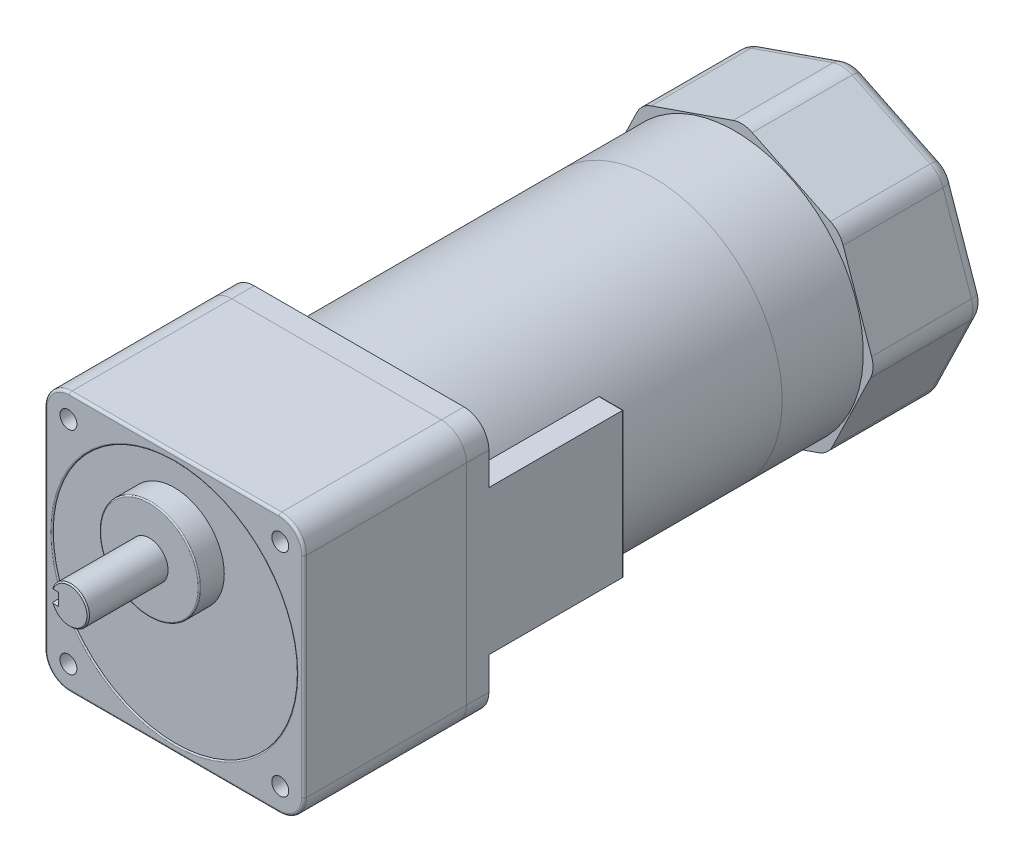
ISO-10303-21;
HEADER;
FILE_DESCRIPTION(('STEP AP214'),'2;1');
FILE_NAME('part.step','',(''),(''),'','','');
FILE_SCHEMA(('AUTOMOTIVE_DESIGN { 1 0 10303 214 1 1 1 1 }'));
ENDSEC;
DATA;
#1=APPLICATION_CONTEXT('core data for automotive mechanical design processes');
#2=APPLICATION_PROTOCOL_DEFINITION('international standard','automotive_design',2000,#1);
#3=PRODUCT_CONTEXT('',#1,'mechanical');
#4=PRODUCT('Part','Part','',(#3));
#5=PRODUCT_RELATED_PRODUCT_CATEGORY('part','',(#4));
#6=PRODUCT_DEFINITION_FORMATION('','',#4);
#7=PRODUCT_DEFINITION_CONTEXT('part definition',#1,'design');
#8=PRODUCT_DEFINITION('design','',#6,#7);
#9=PRODUCT_DEFINITION_SHAPE('','',#8);
#10=(LENGTH_UNIT() NAMED_UNIT(*) SI_UNIT(.MILLI.,.METRE.));
#11=(NAMED_UNIT(*) PLANE_ANGLE_UNIT() SI_UNIT($,.RADIAN.));
#12=(NAMED_UNIT(*) SI_UNIT($,.STERADIAN.) SOLID_ANGLE_UNIT());
#13=UNCERTAINTY_MEASURE_WITH_UNIT(LENGTH_MEASURE(1.E-05),#10,'distance_accuracy_value','');
#14=(GEOMETRIC_REPRESENTATION_CONTEXT(3) GLOBAL_UNCERTAINTY_ASSIGNED_CONTEXT((#13)) GLOBAL_UNIT_ASSIGNED_CONTEXT((#10,
#11,#12)) REPRESENTATION_CONTEXT('',''));
#15=CARTESIAN_POINT('',(0.,0.,0.));
#16=DIRECTION('',(0.,0.,1.));
#17=DIRECTION('',(1.,0.,0.));
#18=AXIS2_PLACEMENT_3D('',#15,#16,#17);
#19=CARTESIAN_POINT('',(0.,20.,107.));
#20=DIRECTION('',(0.,0.,-1.));
#21=DIRECTION('',(-1.,0.,0.));
#22=AXIS2_PLACEMENT_3D('',#19,#20,#21);
#23=CYLINDRICAL_SURFACE('',#22,7.5);
#24=CARTESIAN_POINT('',(0.,20.,75.));
#25=DIRECTION('',(0.,0.,1.));
#26=DIRECTION('',(1.,0.,0.));
#27=AXIS2_PLACEMENT_3D('',#24,#25,#26);
#28=CIRCLE('',#27,7.5);
#29=CARTESIAN_POINT('',(7.5,20.,75.));
#30=VERTEX_POINT('',#29);
#31=EDGE_CURVE('E127',#30,#30,#28,.T.);
#32=ORIENTED_EDGE('',*,*,#31,.T.);
#33=EDGE_LOOP('',(#32));
#34=FACE_BOUND('',#33,.T.);
#35=CARTESIAN_POINT('',(-7.07106781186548,22.5,84.5));
#36=CARTESIAN_POINT('',(-7.07105693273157,22.500008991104,84.4317929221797));
#37=CARTESIAN_POINT('',(-7.07205443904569,22.4972088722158,84.3635919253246));
#38=CARTESIAN_POINT('',(-7.07598524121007,22.4860604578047,84.2277189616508));
#39=CARTESIAN_POINT('',(-7.07891801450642,22.477713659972,84.1600468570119));
#40=CARTESIAN_POINT('',(-7.08662705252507,22.455574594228,84.0259095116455));
#41=CARTESIAN_POINT('',(-7.09139784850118,22.4417984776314,83.9594412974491));
#42=CARTESIAN_POINT('',(-7.10262619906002,22.4089418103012,83.8279917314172));
#43=CARTESIAN_POINT('',(-7.10908381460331,22.3898610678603,83.7630104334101));
#44=CARTESIAN_POINT('',(-7.13069940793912,22.324915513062,83.5710384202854));
#45=CARTESIAN_POINT('',(-7.14811243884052,22.2713141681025,83.44682084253));
#46=CARTESIAN_POINT('',(-7.1869703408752,22.1451778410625,83.2091231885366));
#47=CARTESIAN_POINT('',(-7.20841768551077,22.0726312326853,83.0956497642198));
#48=CARTESIAN_POINT('',(-7.25386182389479,21.9076299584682,82.8782070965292));
#49=CARTESIAN_POINT('',(-7.27792189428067,21.8145628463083,82.7747148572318));
#50=CARTESIAN_POINT('',(-7.32534626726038,21.6124707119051,82.5844828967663));
#51=CARTESIAN_POINT('',(-7.34871044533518,21.5034428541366,82.497746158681));
#52=CARTESIAN_POINT('',(-7.39284706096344,21.2690092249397,82.3413017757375));
#53=CARTESIAN_POINT('',(-7.41353593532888,21.1432502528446,82.2720976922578));
#54=CARTESIAN_POINT('',(-7.44924021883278,20.8810730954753,82.1560192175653));
#55=CARTESIAN_POINT('',(-7.46425736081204,20.7446581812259,82.1091380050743));
#56=CARTESIAN_POINT('',(-7.48647677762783,20.4700733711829,82.0406607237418));
#57=CARTESIAN_POINT('',(-7.49393272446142,20.3321295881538,82.0182418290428));
#58=CARTESIAN_POINT('',(-7.50109021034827,20.0542474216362,81.9967092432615));
#59=CARTESIAN_POINT('',(-7.50079359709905,19.9143095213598,81.9975899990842));
#60=CARTESIAN_POINT('',(-7.49265096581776,19.6422403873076,82.0221107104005));
#61=CARTESIAN_POINT('',(-7.48510152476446,19.5100182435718,82.0448565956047));
#62=CARTESIAN_POINT('',(-7.46367401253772,19.2513898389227,82.1109829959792));
#63=CARTESIAN_POINT('',(-7.4497955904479,19.1249839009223,82.1543646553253));
#64=CARTESIAN_POINT('',(-7.41689170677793,18.8796184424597,82.2610534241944));
#65=CARTESIAN_POINT('',(-7.39780094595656,18.760778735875,82.3246151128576));
#66=CARTESIAN_POINT('',(-7.35645969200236,18.5351885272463,82.469649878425));
#67=CARTESIAN_POINT('',(-7.33420833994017,18.4284413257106,82.5511278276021));
#68=CARTESIAN_POINT('',(-7.28765679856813,18.2247566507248,82.7341776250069));
#69=CARTESIAN_POINT('',(-7.26330946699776,18.128515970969,82.8365138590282));
#70=CARTESIAN_POINT('',(-7.21618726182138,17.9543199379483,83.0561037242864));
#71=CARTESIAN_POINT('',(-7.19341289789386,17.8763704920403,83.173362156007));
#72=CARTESIAN_POINT('',(-7.15175078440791,17.7399916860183,83.4217004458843));
#73=CARTESIAN_POINT('',(-7.13292537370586,17.6818674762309,83.5529587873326));
#74=CARTESIAN_POINT('',(-7.10202742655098,17.5888494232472,83.8241174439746));
#75=CARTESIAN_POINT('',(-7.08994423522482,17.5539189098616,83.9640037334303));
#76=CARTESIAN_POINT('',(-7.078413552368,17.5208546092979,84.17104659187));
#77=CARTESIAN_POINT('',(-7.07566669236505,17.5130373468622,84.2366034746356));
#78=CARTESIAN_POINT('',(-7.07199258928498,17.502613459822,84.3680951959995));
#79=CARTESIAN_POINT('',(-7.0710629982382,17.5000001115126,84.434029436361));
#80=CARTESIAN_POINT('',(-7.07106781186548,17.5,84.5));
#81=B_SPLINE_CURVE_WITH_KNOTS('',3,(#35,#36,#37,#38,#39,#40,#41,#42,#43,#44,#45,#46,#47,#48,#49,
#50,#51,#52,#53,#54,#55,#56,#57,#58,#59,#60,#61,#62,#63,#64,#65,#66,#67,#68,#69,#70,#71,#72,#73,
#74,#75,#76,#77,#78,#79,#80),.UNSPECIFIED.,.F.,.F.,(4,2,2,2,2,2,2,2,2,2,2,2,2,2,2,2,2,2,2,2,2,2,
4),(0.,0.204546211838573,0.409037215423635,0.612924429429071,0.816819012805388,1.22401016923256,
1.63145179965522,2.05327864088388,2.47518051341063,2.90809434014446,3.34087579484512,
3.75860278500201,4.176230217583,4.57747647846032,4.97874498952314,5.38529148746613,
5.79194868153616,6.2177173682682,6.643623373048,7.07581676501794,7.50732520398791,
7.70536340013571,7.90314555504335),.UNSPECIFIED.);
#82=CARTESIAN_POINT('',(-7.07106781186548,22.5,84.5));
#83=VERTEX_POINT('',#82);
#84=CARTESIAN_POINT('',(-7.07106781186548,17.5,84.5));
#85=VERTEX_POINT('',#84);
#86=EDGE_CURVE('E12',#83,#85,#81,.T.);
#87=ORIENTED_EDGE('',*,*,#86,.F.);
#88=DIRECTION('',(0.,0.,-1.));
#89=VECTOR('',#88,1.);
#90=CARTESIAN_POINT('',(-7.07106781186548,22.5,107.));
#91=LINE('',#90,#89);
#92=CARTESIAN_POINT('',(-7.07106781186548,22.5,106.5));
#93=VERTEX_POINT('',#92);
#94=EDGE_CURVE('E118',#93,#83,#91,.T.);
#95=ORIENTED_EDGE('',*,*,#94,.F.);
#96=CARTESIAN_POINT('',(0.,20.,106.5));
#97=DIRECTION('',(0.,0.,1.));
#98=DIRECTION('',(1.,0.,0.));
#99=AXIS2_PLACEMENT_3D('',#96,#97,#98);
#100=CIRCLE('',#99,7.5);
#101=CARTESIAN_POINT('',(-7.07106781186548,17.5,106.5));
#102=VERTEX_POINT('',#101);
#103=EDGE_CURVE('E133',#93,#102,#100,.F.);
#104=ORIENTED_EDGE('',*,*,#103,.T.);
#105=DIRECTION('',(0.,0.,-1.));
#106=VECTOR('',#105,1.);
#107=CARTESIAN_POINT('',(-7.07106781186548,17.5,107.));
#108=LINE('',#107,#106);
#109=EDGE_CURVE('E68',#85,#102,#108,.F.);
#110=ORIENTED_EDGE('',*,*,#109,.F.);
#111=EDGE_LOOP('',(#87,#95,#104,#110));
#112=FACE_BOUND('',#111,.T.);
#113=ADVANCED_FACE('F48',(#34,#112),#23,.T.);
#114=CARTESIAN_POINT('',(0.,20.,107.));
#115=DIRECTION('',(0.,0.,1.));
#116=DIRECTION('',(1.,0.,0.));
#117=AXIS2_PLACEMENT_3D('',#114,#115,#116);
#118=PLANE('',#117);
#119=CARTESIAN_POINT('',(0.,20.,107.));
#120=DIRECTION('',(0.,0.,1.));
#121=DIRECTION('',(1.,0.,0.));
#122=AXIS2_PLACEMENT_3D('',#119,#120,#121);
#123=CIRCLE('',#122,7.);
#124=CARTESIAN_POINT('',(-6.53834841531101,17.5,107.));
#125=VERTEX_POINT('',#124);
#126=CARTESIAN_POINT('',(-6.53834841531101,22.5,107.));
#127=VERTEX_POINT('',#126);
#128=EDGE_CURVE('E130',#125,#127,#123,.T.);
#129=ORIENTED_EDGE('',*,*,#128,.T.);
#130=DIRECTION('',(-1.,0.,0.));
#131=VECTOR('',#130,1.);
#132=CARTESIAN_POINT('',(-4.5,22.5,107.));
#133=LINE('',#132,#131);
#134=CARTESIAN_POINT('',(-4.5,22.5,107.));
#135=VERTEX_POINT('',#134);
#136=EDGE_CURVE('E119',#135,#127,#133,.T.);
#137=ORIENTED_EDGE('',*,*,#136,.F.);
#138=DIRECTION('',(0.,-1.,0.));
#139=VECTOR('',#138,1.);
#140=CARTESIAN_POINT('',(-4.5,22.5,107.));
#141=LINE('',#140,#139);
#142=CARTESIAN_POINT('',(-4.5,17.5,107.));
#143=VERTEX_POINT('',#142);
#144=EDGE_CURVE('E106',#135,#143,#141,.T.);
#145=ORIENTED_EDGE('',*,*,#144,.T.);
#146=DIRECTION('',(-1.,0.,0.));
#147=VECTOR('',#146,1.);
#148=CARTESIAN_POINT('',(-4.5,17.5,107.));
#149=LINE('',#148,#147);
#150=EDGE_CURVE('E122',#143,#125,#149,.T.);
#151=ORIENTED_EDGE('',*,*,#150,.T.);
#152=EDGE_LOOP('',(#129,#137,#145,#151));
#153=FACE_BOUND('',#152,.T.);
#154=ADVANCED_FACE('F155',(#153),#118,.T.);
#155=CARTESIAN_POINT('',(0.,20.,107.));
#156=DIRECTION('',(0.,0.,-1.));
#157=DIRECTION('',(-1.,0.,0.));
#158=AXIS2_PLACEMENT_3D('',#155,#156,#157);
#159=CONICAL_SURFACE('',#158,7.,0.785398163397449);
#160=ORIENTED_EDGE('',*,*,#103,.F.);
#161=CARTESIAN_POINT('',(-11.0143547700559,22.5,102.705487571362));
#162=CARTESIAN_POINT('',(-10.6798349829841,22.5,103.031669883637));
#163=CARTESIAN_POINT('',(-10.3449877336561,22.5,103.357518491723));
#164=CARTESIAN_POINT('',(-9.67434994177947,22.5,104.008192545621));
#165=CARTESIAN_POINT('',(-9.3385594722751,22.5,104.333018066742));
#166=CARTESIAN_POINT('',(-8.6658920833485,22.5,104.981151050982));
#167=CARTESIAN_POINT('',(-8.32901590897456,22.5,105.304459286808));
#168=CARTESIAN_POINT('',(-7.65344263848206,22.5,105.949228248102));
#169=CARTESIAN_POINT('',(-7.31474539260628,22.5,106.270688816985));
#170=CARTESIAN_POINT('',(-6.80457575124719,22.5,106.750931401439));
#171=CARTESIAN_POINT('',(-6.6340879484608,22.5,106.910759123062));
#172=CARTESIAN_POINT('',(-6.29229590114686,22.5,107.229536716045));
#173=CARTESIAN_POINT('',(-6.12099166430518,22.5,107.38848659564));
#174=CARTESIAN_POINT('',(-5.77739778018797,22.5,107.705248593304));
#175=CARTESIAN_POINT('',(-5.60510833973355,22.5,107.863060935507));
#176=CARTESIAN_POINT('',(-5.25922656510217,22.5,108.177266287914));
#177=CARTESIAN_POINT('',(-5.08563418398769,22.5,108.333659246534));
#178=CARTESIAN_POINT('',(-4.73662813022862,22.5,108.644687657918));
#179=CARTESIAN_POINT('',(-4.56121310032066,22.5,108.799321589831));
#180=CARTESIAN_POINT('',(-4.20817217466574,22.5,109.106020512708));
#181=CARTESIAN_POINT('',(-4.03054650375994,22.5,109.258085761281));
#182=CARTESIAN_POINT('',(-3.76176911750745,22.5,109.483525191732));
#183=CARTESIAN_POINT('',(-3.67175442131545,22.5,109.558254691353));
#184=CARTESIAN_POINT('',(-3.49082532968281,22.5,109.706612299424));
#185=CARTESIAN_POINT('',(-3.39991096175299,22.5,109.78024044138));
#186=CARTESIAN_POINT('',(-3.21698494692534,22.5,109.926189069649));
#187=CARTESIAN_POINT('',(-3.12497293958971,22.5,109.998509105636));
#188=CARTESIAN_POINT('',(-2.93965183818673,22.5,110.14148620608));
#189=CARTESIAN_POINT('',(-2.84634260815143,22.5,110.212143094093));
#190=CARTESIAN_POINT('',(-2.75227945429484,22.5,110.281795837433));
#191=B_SPLINE_CURVE_WITH_KNOTS('',3,(#161,#162,#163,#164,#165,#166,#167,#168,#169,#170,#171,
#172,#173,#174,#175,#176,#177,#178,#179,#180,#181,#182,#183,#184,#185,#186,#187,#188,#189,#190),
.UNSPECIFIED.,.F.,.F.,(4,2,2,2,2,2,2,2,2,2,2,2,2,2,4),(0.,1.4016744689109,2.80324322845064,
4.20399722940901,5.60486824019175,6.30593577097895,7.00699671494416,7.70791552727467,
8.40885971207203,9.11036980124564,9.81180911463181,10.1627784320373,10.5137370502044,
10.864814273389,11.2159285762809),.UNSPECIFIED.);
#192=EDGE_CURVE('E61',#93,#127,#191,.T.);
#193=ORIENTED_EDGE('',*,*,#192,.T.);
#194=ORIENTED_EDGE('',*,*,#128,.F.);
#195=CARTESIAN_POINT('',(-2.75227945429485,17.5,110.281795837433));
#196=CARTESIAN_POINT('',(-2.82551522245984,17.5,110.227577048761));
#197=CARTESIAN_POINT('',(-2.89828844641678,17.5,110.172740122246));
#198=CARTESIAN_POINT('',(-3.043018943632,17.5,110.062008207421));
#199=CARTESIAN_POINT('',(-3.11497626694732,17.5,110.006113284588));
#200=CARTESIAN_POINT('',(-3.32976761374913,17.5,109.837125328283));
#201=CARTESIAN_POINT('',(-3.47155558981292,17.5,109.722703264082));
#202=CARTESIAN_POINT('',(-3.75292181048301,17.5,109.491337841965));
#203=CARTESIAN_POINT('',(-3.8925011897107,17.5,109.3743958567));
#204=CARTESIAN_POINT('',(-4.17001061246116,17.5,109.138555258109));
#205=CARTESIAN_POINT('',(-4.30794054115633,17.5,109.019656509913));
#206=CARTESIAN_POINT('',(-4.5823789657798,17.5,108.78045226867));
#207=CARTESIAN_POINT('',(-4.71888850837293,17.5,108.660147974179));
#208=CARTESIAN_POINT('',(-4.99085017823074,17.5,108.418358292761));
#209=CARTESIAN_POINT('',(-5.1263023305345,17.5,108.296872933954));
#210=CARTESIAN_POINT('',(-5.53141798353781,17.5,107.930975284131));
#211=CARTESIAN_POINT('',(-5.79980668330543,17.5,107.685151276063));
#212=CARTESIAN_POINT('',(-6.14300557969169,17.5,107.367828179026));
#213=CARTESIAN_POINT('',(-6.21888659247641,17.5,107.297480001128));
#214=CARTESIAN_POINT('',(-6.37047314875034,17.5,107.156598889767));
#215=CARTESIAN_POINT('',(-6.44617869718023,17.5,107.086065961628));
#216=CARTESIAN_POINT('',(-6.67307720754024,17.5,106.874199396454));
#217=CARTESIAN_POINT('',(-6.8240348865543,17.5,106.732613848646));
#218=CARTESIAN_POINT('',(-7.31490063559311,17.5,106.27054247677));
#219=CARTESIAN_POINT('',(-7.65375215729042,17.5,105.948934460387));
#220=CARTESIAN_POINT('',(-8.32966336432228,17.5,105.30383974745));
#221=CARTESIAN_POINT('',(-8.66672303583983,17.5,104.98035303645));
#222=CARTESIAN_POINT('',(-9.3394195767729,17.5,104.332186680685));
#223=CARTESIAN_POINT('',(-9.67505698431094,17.5,104.00750759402));
#224=CARTESIAN_POINT('',(-10.3453568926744,17.5,103.357159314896));
#225=CARTESIAN_POINT('',(-10.6800194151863,17.5,103.031490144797));
#226=CARTESIAN_POINT('',(-11.0143547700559,17.5,102.705487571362));
#227=B_SPLINE_CURVE_WITH_KNOTS('',3,(#195,#196,#197,#198,#199,#200,#201,#202,#203,#204,#205,
#206,#207,#208,#209,#210,#211,#212,#213,#214,#215,#216,#217,#218,#219,#220,#221,#222,#223,#224,
#225,#226),.UNSPECIFIED.,.F.,.F.,(4,2,2,2,2,2,2,2,2,2,2,2,2,2,2,4),(0.,0.273355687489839,
0.546694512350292,1.09324270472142,1.63950035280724,2.18579581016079,2.73165523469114,
3.27750169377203,4.36933033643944,4.67975144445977,4.99016370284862,5.61105831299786,
7.01256945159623,8.41409138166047,9.81502466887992,11.215926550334),.UNSPECIFIED.);
#228=EDGE_CURVE('E136',#125,#102,#227,.T.);
#229=ORIENTED_EDGE('',*,*,#228,.T.);
#230=EDGE_LOOP('',(#160,#193,#194,#229));
#231=FACE_BOUND('',#230,.T.);
#232=ADVANCED_FACE('F50',(#231),#159,.T.);
#233=CARTESIAN_POINT('',(0.,20.,75.));
#234=DIRECTION('',(0.,0.,1.));
#235=DIRECTION('',(1.,0.,0.));
#236=AXIS2_PLACEMENT_3D('',#233,#234,#235);
#237=PLANE('',#236);
#238=ORIENTED_EDGE('',*,*,#31,.F.);
#239=EDGE_LOOP('',(#238));
#240=FACE_BOUND('',#239,.T.);
#241=ADVANCED_FACE('F154',(#240),#237,.F.);
#242=CARTESIAN_POINT('',(-4.5,20.,84.5));
#243=DIRECTION('',(-1.,0.,0.));
#244=DIRECTION('',(0.,0.,1.));
#245=AXIS2_PLACEMENT_3D('',#242,#243,#244);
#246=CYLINDRICAL_SURFACE('',#245,2.5);
#247=DIRECTION('',(-1.,0.,0.));
#248=VECTOR('',#247,1.);
#249=CARTESIAN_POINT('',(-4.5,22.5,84.5));
#250=LINE('',#249,#248);
#251=CARTESIAN_POINT('',(-4.5,22.5,84.5));
#252=VERTEX_POINT('',#251);
#253=EDGE_CURVE('E114',#252,#83,#250,.T.);
#254=ORIENTED_EDGE('',*,*,#253,.T.);
#255=ORIENTED_EDGE('',*,*,#86,.T.);
#256=DIRECTION('',(-1.,0.,0.));
#257=VECTOR('',#256,1.);
#258=CARTESIAN_POINT('',(-4.5,17.5,84.5));
#259=LINE('',#258,#257);
#260=CARTESIAN_POINT('',(-4.5,17.5,84.5));
#261=VERTEX_POINT('',#260);
#262=EDGE_CURVE('E115',#261,#85,#259,.T.);
#263=ORIENTED_EDGE('',*,*,#262,.F.);
#264=CARTESIAN_POINT('',(-4.5,20.,84.5));
#265=DIRECTION('',(1.,0.,0.));
#266=DIRECTION('',(0.,0.,-1.));
#267=AXIS2_PLACEMENT_3D('',#264,#265,#266);
#268=CIRCLE('',#267,2.5);
#269=EDGE_CURVE('E104',#261,#252,#268,.T.);
#270=ORIENTED_EDGE('',*,*,#269,.T.);
#271=EDGE_LOOP('',(#254,#255,#263,#270));
#272=FACE_BOUND('',#271,.T.);
#273=ADVANCED_FACE('F113',(#272),#246,.F.);
#274=CARTESIAN_POINT('',(-4.5,22.5,84.5));
#275=DIRECTION('',(0.,-1.,0.));
#276=DIRECTION('',(0.,0.,-1.));
#277=AXIS2_PLACEMENT_3D('',#274,#275,#276);
#278=PLANE('',#277);
#279=ORIENTED_EDGE('',*,*,#94,.T.);
#280=ORIENTED_EDGE('',*,*,#253,.F.);
#281=DIRECTION('',(0.,0.,1.));
#282=VECTOR('',#281,1.);
#283=CARTESIAN_POINT('',(-4.5,22.5,84.5));
#284=LINE('',#283,#282);
#285=EDGE_CURVE('E100',#252,#135,#284,.T.);
#286=ORIENTED_EDGE('',*,*,#285,.T.);
#287=ORIENTED_EDGE('',*,*,#136,.T.);
#288=ORIENTED_EDGE('',*,*,#192,.F.);
#289=EDGE_LOOP('',(#279,#280,#286,#287,#288));
#290=FACE_BOUND('',#289,.T.);
#291=ADVANCED_FACE('F117',(#290),#278,.T.);
#292=CARTESIAN_POINT('',(-4.5,17.5,107.));
#293=DIRECTION('',(0.,1.,0.));
#294=DIRECTION('',(0.,0.,1.));
#295=AXIS2_PLACEMENT_3D('',#292,#293,#294);
#296=PLANE('',#295);
#297=ORIENTED_EDGE('',*,*,#109,.T.);
#298=ORIENTED_EDGE('',*,*,#228,.F.);
#299=ORIENTED_EDGE('',*,*,#150,.F.);
#300=DIRECTION('',(0.,0.,-1.));
#301=VECTOR('',#300,1.);
#302=CARTESIAN_POINT('',(-4.5,17.5,107.));
#303=LINE('',#302,#301);
#304=EDGE_CURVE('E169',#143,#261,#303,.T.);
#305=ORIENTED_EDGE('',*,*,#304,.T.);
#306=ORIENTED_EDGE('',*,*,#262,.T.);
#307=EDGE_LOOP('',(#297,#298,#299,#305,#306));
#308=FACE_BOUND('',#307,.T.);
#309=ADVANCED_FACE('F145',(#308),#296,.T.);
#310=CARTESIAN_POINT('',(-4.5,20.,84.5));
#311=DIRECTION('',(1.,0.,0.));
#312=DIRECTION('',(0.,0.,-1.));
#313=AXIS2_PLACEMENT_3D('',#310,#311,#312);
#314=PLANE('',#313);
#315=ORIENTED_EDGE('',*,*,#269,.F.);
#316=ORIENTED_EDGE('',*,*,#304,.F.);
#317=ORIENTED_EDGE('',*,*,#144,.F.);
#318=ORIENTED_EDGE('',*,*,#285,.F.);
#319=EDGE_LOOP('',(#315,#316,#317,#318));
#320=FACE_BOUND('',#319,.T.);
#321=ADVANCED_FACE('F102',(#320),#314,.F.);
#322=CLOSED_SHELL('',(#113,#154,#232,#241,#273,#291,#309,#321));
#323=MANIFOLD_SOLID_BREP('B2',#322);
#324=CARTESIAN_POINT('',(0.,20.,75.));
#325=DIRECTION('',(0.,0.,-1.));
#326=DIRECTION('',(-1.,0.,0.));
#327=AXIS2_PLACEMENT_3D('',#324,#325,#326);
#328=CYLINDRICAL_SURFACE('',#327,20.);
#329=CARTESIAN_POINT('',(0.,20.,74.5));
#330=DIRECTION('',(0.,0.,1.));
#331=DIRECTION('',(1.,0.,0.));
#332=AXIS2_PLACEMENT_3D('',#329,#330,#331);
#333=CIRCLE('',#332,20.);
#334=CARTESIAN_POINT('',(20.,20.,74.5));
#335=VERTEX_POINT('',#334);
#336=EDGE_CURVE('E47',#335,#335,#333,.F.);
#337=ORIENTED_EDGE('',*,*,#336,.T.);
#338=EDGE_LOOP('',(#337));
#339=FACE_BOUND('',#338,.T.);
#340=CARTESIAN_POINT('',(0.,20.,65.));
#341=DIRECTION('',(0.,0.,1.));
#342=DIRECTION('',(1.,0.,0.));
#343=AXIS2_PLACEMENT_3D('',#340,#341,#342);
#344=CIRCLE('',#343,20.);
#345=CARTESIAN_POINT('',(20.,20.,65.));
#346=VERTEX_POINT('',#345);
#347=EDGE_CURVE('E249',#346,#346,#344,.T.);
#348=ORIENTED_EDGE('',*,*,#347,.T.);
#349=EDGE_LOOP('',(#348));
#350=FACE_BOUND('',#349,.T.);
#351=ADVANCED_FACE('F238',(#339,#350),#328,.T.);
#352=CARTESIAN_POINT('',(0.,20.,75.));
#353=DIRECTION('',(0.,0.,1.));
#354=DIRECTION('',(1.,0.,0.));
#355=AXIS2_PLACEMENT_3D('',#352,#353,#354);
#356=PLANE('',#355);
#357=CARTESIAN_POINT('',(0.,20.,75.));
#358=DIRECTION('',(0.,0.,1.));
#359=DIRECTION('',(1.,0.,0.));
#360=AXIS2_PLACEMENT_3D('',#357,#358,#359);
#361=CIRCLE('',#360,19.5);
#362=CARTESIAN_POINT('',(19.5,20.,75.));
#363=VERTEX_POINT('',#362);
#364=EDGE_CURVE('E245',#363,#363,#361,.T.);
#365=ORIENTED_EDGE('',*,*,#364,.T.);
#366=EDGE_LOOP('',(#365));
#367=FACE_BOUND('',#366,.T.);
#368=ADVANCED_FACE('F259',(#367),#356,.T.);
#369=CARTESIAN_POINT('',(0.,20.,65.));
#370=DIRECTION('',(0.,0.,1.));
#371=DIRECTION('',(1.,0.,0.));
#372=AXIS2_PLACEMENT_3D('',#369,#370,#371);
#373=PLANE('',#372);
#374=ORIENTED_EDGE('',*,*,#347,.F.);
#375=EDGE_LOOP('',(#374));
#376=FACE_BOUND('',#375,.T.);
#377=ADVANCED_FACE('F257',(#376),#373,.F.);
#378=CARTESIAN_POINT('',(0.,20.,74.5));
#379=DIRECTION('',(0.,0.,1.));
#380=DIRECTION('',(1.,0.,0.));
#381=AXIS2_PLACEMENT_3D('',#378,#379,#380);
#382=TOROIDAL_SURFACE('',#381,19.5,0.5);
#383=ORIENTED_EDGE('',*,*,#336,.F.);
#384=EDGE_LOOP('',(#383));
#385=FACE_BOUND('',#384,.T.);
#386=ORIENTED_EDGE('',*,*,#364,.F.);
#387=EDGE_LOOP('',(#386));
#388=FACE_BOUND('',#387,.T.);
#389=ADVANCED_FACE('F240',(#385,#388),#382,.T.);
#390=CLOSED_SHELL('',(#351,#368,#377,#389));
#391=MANIFOLD_SOLID_BREP('B6',#390);
#392=CARTESIAN_POINT('',(45.3825112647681,-2.66124468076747,-204.5));
#393=DIRECTION('',(0.,0.,1.));
#394=DIRECTION('',(1.,0.,0.));
#395=AXIS2_PLACEMENT_3D('',#392,#393,#394);
#396=CYLINDRICAL_SURFACE('',#395,10.);
#397=DIRECTION('',(0.,0.,1.));
#398=VECTOR('',#397,1.);
#399=CARTESIAN_POINT('',(54.3814408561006,-7.02235305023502,-204.5));
#400=LINE('',#399,#398);
#401=CARTESIAN_POINT('',(54.3814408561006,-7.02235305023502,-199.5));
#402=VERTEX_POINT('',#401);
#403=CARTESIAN_POINT('',(54.3814408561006,-7.02235305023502,-159.5));
#404=VERTEX_POINT('',#403);
#405=EDGE_CURVE('E462',#402,#404,#400,.T.);
#406=ORIENTED_EDGE('',*,*,#405,.F.);
#407=CARTESIAN_POINT('',(45.3825112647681,-2.66124468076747,-199.5));
#408=DIRECTION('',(0.,0.,-1.));
#409=DIRECTION('',(-1.,0.,0.));
#410=AXIS2_PLACEMENT_3D('',#407,#408,#409);
#411=CIRCLE('',#410,10.);
#412=CARTESIAN_POINT('',(54.8294847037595,0.618190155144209,-199.5));
#413=VERTEX_POINT('',#412);
#414=EDGE_CURVE('E236',#402,#413,#411,.F.);
#415=ORIENTED_EDGE('',*,*,#414,.T.);
#416=DIRECTION('',(0.,0.,1.));
#417=VECTOR('',#416,1.);
#418=CARTESIAN_POINT('',(54.8294847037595,0.618190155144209,-204.5));
#419=LINE('',#418,#417);
#420=CARTESIAN_POINT('',(54.8294847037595,0.618190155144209,-159.5));
#421=VERTEX_POINT('',#420);
#422=EDGE_CURVE('E483',#413,#421,#419,.T.);
#423=ORIENTED_EDGE('',*,*,#422,.T.);
#424=CARTESIAN_POINT('',(45.3825112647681,-2.66124468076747,-159.5));
#425=DIRECTION('',(0.,0.,-1.));
#426=DIRECTION('',(-1.,0.,0.));
#427=AXIS2_PLACEMENT_3D('',#424,#425,#426);
#428=CIRCLE('',#427,10.);
#429=EDGE_CURVE('E477',#421,#404,#428,.T.);
#430=ORIENTED_EDGE('',*,*,#429,.T.);
#431=EDGE_LOOP('',(#406,#415,#423,#430));
#432=FACE_BOUND('',#431,.T.);
#433=ADVANCED_FACE('F302',(#432),#396,.T.);
#434=CARTESIAN_POINT('',(54.3814408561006,-7.02235305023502,-204.5));
#435=DIRECTION('',(-0.899892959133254,0.436110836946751,0.));
#436=DIRECTION('',(-0.436110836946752,-0.899892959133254,0.));
#437=AXIS2_PLACEMENT_3D('',#434,#435,#436);
#438=PLANE('',#437);
#439=DIRECTION('',(0.,0.,1.));
#440=VECTOR('',#439,1.);
#441=CARTESIAN_POINT('',(39.2074268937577,-38.3331739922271,-204.5));
#442=LINE('',#441,#440);
#443=CARTESIAN_POINT('',(39.2074268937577,-38.3331739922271,-199.5));
#444=VERTEX_POINT('',#443);
#445=CARTESIAN_POINT('',(39.2074268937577,-38.3331739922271,-159.5));
#446=VERTEX_POINT('',#445);
#447=EDGE_CURVE('E471',#444,#446,#442,.T.);
#448=ORIENTED_EDGE('',*,*,#447,.F.);
#449=DIRECTION('',(-0.436110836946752,-0.899892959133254,0.));
#450=VECTOR('',#449,1.);
#451=CARTESIAN_POINT('',(54.3814408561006,-7.02235305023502,-199.5));
#452=LINE('',#451,#450);
#453=EDGE_CURVE('E311',#444,#402,#452,.F.);
#454=ORIENTED_EDGE('',*,*,#453,.T.);
#455=ORIENTED_EDGE('',*,*,#405,.T.);
#456=DIRECTION('',(-0.436110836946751,-0.899892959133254,0.));
#457=VECTOR('',#456,1.);
#458=CARTESIAN_POINT('',(54.3814408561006,-7.02235305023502,-159.5));
#459=LINE('',#458,#457);
#460=EDGE_CURVE('E465',#404,#446,#459,.T.);
#461=ORIENTED_EDGE('',*,*,#460,.T.);
#462=EDGE_LOOP('',(#448,#454,#455,#461));
#463=FACE_BOUND('',#462,.T.);
#464=ADVANCED_FACE('F464',(#463),#438,.F.);
#465=CARTESIAN_POINT('',(30.2084973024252,-33.9720656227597,-204.5));
#466=DIRECTION('',(0.,0.,1.));
#467=DIRECTION('',(1.,0.,0.));
#468=AXIS2_PLACEMENT_3D('',#465,#466,#467);
#469=CYLINDRICAL_SURFACE('',#468,10.);
#470=DIRECTION('',(0.,0.,1.));
#471=VECTOR('',#470,1.);
#472=CARTESIAN_POINT('',(33.4879321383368,-43.4190390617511,-204.5));
#473=LINE('',#472,#471);
#474=CARTESIAN_POINT('',(33.4879321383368,-43.4190390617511,-199.5));
#475=VERTEX_POINT('',#474);
#476=CARTESIAN_POINT('',(33.4879321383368,-43.4190390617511,-159.5));
#477=VERTEX_POINT('',#476);
#478=EDGE_CURVE('E553',#475,#477,#473,.T.);
#479=ORIENTED_EDGE('',*,*,#478,.F.);
#480=CARTESIAN_POINT('',(30.2084973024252,-33.9720656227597,-199.5));
#481=DIRECTION('',(0.,0.,-1.));
#482=DIRECTION('',(-1.,0.,0.));
#483=AXIS2_PLACEMENT_3D('',#480,#481,#482);
#484=CIRCLE('',#483,10.);
#485=EDGE_CURVE('E326',#475,#444,#484,.F.);
#486=ORIENTED_EDGE('',*,*,#485,.T.);
#487=ORIENTED_EDGE('',*,*,#447,.T.);
#488=CARTESIAN_POINT('',(30.2084973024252,-33.9720656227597,-159.5));
#489=DIRECTION('',(0.,0.,-1.));
#490=DIRECTION('',(-1.,0.,0.));
#491=AXIS2_PLACEMENT_3D('',#488,#489,#490);
#492=CIRCLE('',#491,10.);
#493=EDGE_CURVE('E480',#446,#477,#492,.T.);
#494=ORIENTED_EDGE('',*,*,#493,.T.);
#495=EDGE_LOOP('',(#479,#486,#487,#494));
#496=FACE_BOUND('',#495,.T.);
#497=ADVANCED_FACE('F791',(#496),#469,.T.);
#498=CARTESIAN_POINT('',(33.4879321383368,-43.4190390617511,-204.5));
#499=DIRECTION('',(-0.327943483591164,0.944697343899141,0.));
#500=DIRECTION('',(-0.944697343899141,-0.327943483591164,0.));
#501=AXIS2_PLACEMENT_3D('',#498,#499,#500);
#502=PLANE('',#501);
#503=DIRECTION('',(0.,0.,1.));
#504=VECTOR('',#503,1.);
#505=CARTESIAN_POINT('',(0.618190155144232,-54.8294847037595,-204.5));
#506=LINE('',#505,#504);
#507=CARTESIAN_POINT('',(0.618190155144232,-54.8294847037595,-199.5));
#508=VERTEX_POINT('',#507);
#509=CARTESIAN_POINT('',(0.618190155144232,-54.8294847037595,-159.5));
#510=VERTEX_POINT('',#509);
#511=EDGE_CURVE('E551',#508,#510,#506,.T.);
#512=ORIENTED_EDGE('',*,*,#511,.F.);
#513=DIRECTION('',(-0.944697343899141,-0.327943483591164,0.));
#514=VECTOR('',#513,1.);
#515=CARTESIAN_POINT('',(33.4879321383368,-43.4190390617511,-199.5));
#516=LINE('',#515,#514);
#517=EDGE_CURVE('E613',#508,#475,#516,.F.);
#518=ORIENTED_EDGE('',*,*,#517,.T.);
#519=ORIENTED_EDGE('',*,*,#478,.T.);
#520=DIRECTION('',(-0.944697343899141,-0.327943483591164,0.));
#521=VECTOR('',#520,1.);
#522=CARTESIAN_POINT('',(33.4879321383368,-43.4190390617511,-159.5));
#523=LINE('',#522,#521);
#524=EDGE_CURVE('E490',#477,#510,#523,.T.);
#525=ORIENTED_EDGE('',*,*,#524,.T.);
#526=EDGE_LOOP('',(#512,#518,#519,#525));
#527=FACE_BOUND('',#526,.T.);
#528=ADVANCED_FACE('F687',(#527),#502,.F.);
#529=CARTESIAN_POINT('',(-2.66124468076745,-45.3825112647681,-204.5));
#530=DIRECTION('',(0.,0.,1.));
#531=DIRECTION('',(1.,0.,0.));
#532=AXIS2_PLACEMENT_3D('',#529,#530,#531);
#533=CYLINDRICAL_SURFACE('',#532,10.);
#534=DIRECTION('',(0.,0.,1.));
#535=VECTOR('',#534,1.);
#536=CARTESIAN_POINT('',(-7.022353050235,-54.3814408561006,-204.5));
#537=LINE('',#536,#535);
#538=CARTESIAN_POINT('',(-7.022353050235,-54.3814408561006,-199.5));
#539=VERTEX_POINT('',#538);
#540=CARTESIAN_POINT('',(-7.022353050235,-54.3814408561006,-159.5));
#541=VERTEX_POINT('',#540);
#542=EDGE_CURVE('E549',#539,#541,#537,.T.);
#543=ORIENTED_EDGE('',*,*,#542,.F.);
#544=CARTESIAN_POINT('',(-2.66124468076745,-45.3825112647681,-199.5));
#545=DIRECTION('',(0.,0.,-1.));
#546=DIRECTION('',(-1.,0.,0.));
#547=AXIS2_PLACEMENT_3D('',#544,#545,#546);
#548=CIRCLE('',#547,10.);
#549=EDGE_CURVE('E611',#539,#508,#548,.F.);
#550=ORIENTED_EDGE('',*,*,#549,.T.);
#551=ORIENTED_EDGE('',*,*,#511,.T.);
#552=CARTESIAN_POINT('',(-2.66124468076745,-45.3825112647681,-159.5));
#553=DIRECTION('',(0.,0.,-1.));
#554=DIRECTION('',(-1.,0.,0.));
#555=AXIS2_PLACEMENT_3D('',#552,#553,#554);
#556=CIRCLE('',#555,10.);
#557=EDGE_CURVE('E493',#510,#541,#556,.T.);
#558=ORIENTED_EDGE('',*,*,#557,.T.);
#559=EDGE_LOOP('',(#543,#550,#551,#558));
#560=FACE_BOUND('',#559,.T.);
#561=ADVANCED_FACE('F685',(#560),#533,.T.);
#562=CARTESIAN_POINT('',(-7.022353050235,-54.3814408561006,-204.5));
#563=DIRECTION('',(0.436110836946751,0.899892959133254,0.));
#564=DIRECTION('',(-0.899892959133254,0.436110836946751,0.));
#565=AXIS2_PLACEMENT_3D('',#562,#563,#564);
#566=PLANE('',#565);
#567=DIRECTION('',(0.,0.,1.));
#568=VECTOR('',#567,1.);
#569=CARTESIAN_POINT('',(-38.3331739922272,-39.2074268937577,-204.5));
#570=LINE('',#569,#568);
#571=CARTESIAN_POINT('',(-38.3331739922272,-39.2074268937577,-199.5));
#572=VERTEX_POINT('',#571);
#573=CARTESIAN_POINT('',(-38.3331739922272,-39.2074268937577,-159.5));
#574=VERTEX_POINT('',#573);
#575=EDGE_CURVE('E547',#572,#574,#570,.T.);
#576=ORIENTED_EDGE('',*,*,#575,.F.);
#577=DIRECTION('',(-0.899892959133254,0.436110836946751,0.));
#578=VECTOR('',#577,1.);
#579=CARTESIAN_POINT('',(-7.022353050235,-54.3814408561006,-199.5));
#580=LINE('',#579,#578);
#581=EDGE_CURVE('E609',#572,#539,#580,.F.);
#582=ORIENTED_EDGE('',*,*,#581,.T.);
#583=ORIENTED_EDGE('',*,*,#542,.T.);
#584=DIRECTION('',(-0.899892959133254,0.436110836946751,0.));
#585=VECTOR('',#584,1.);
#586=CARTESIAN_POINT('',(-7.022353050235,-54.3814408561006,-159.5));
#587=LINE('',#586,#585);
#588=EDGE_CURVE('E496',#541,#574,#587,.T.);
#589=ORIENTED_EDGE('',*,*,#588,.T.);
#590=EDGE_LOOP('',(#576,#582,#583,#589));
#591=FACE_BOUND('',#590,.T.);
#592=ADVANCED_FACE('F694',(#591),#566,.F.);
#593=CARTESIAN_POINT('',(-33.9720656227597,-30.2084973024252,-204.5));
#594=DIRECTION('',(0.,0.,1.));
#595=DIRECTION('',(1.,0.,0.));
#596=AXIS2_PLACEMENT_3D('',#593,#594,#595);
#597=CYLINDRICAL_SURFACE('',#596,10.);
#598=DIRECTION('',(0.,0.,1.));
#599=VECTOR('',#598,1.);
#600=CARTESIAN_POINT('',(-43.4190390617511,-33.4879321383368,-204.5));
#601=LINE('',#600,#599);
#602=CARTESIAN_POINT('',(-43.4190390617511,-33.4879321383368,-199.5));
#603=VERTEX_POINT('',#602);
#604=CARTESIAN_POINT('',(-43.4190390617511,-33.4879321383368,-159.5));
#605=VERTEX_POINT('',#604);
#606=EDGE_CURVE('E545',#603,#605,#601,.T.);
#607=ORIENTED_EDGE('',*,*,#606,.F.);
#608=CARTESIAN_POINT('',(-33.9720656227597,-30.2084973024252,-199.5));
#609=DIRECTION('',(0.,0.,-1.));
#610=DIRECTION('',(-1.,0.,0.));
#611=AXIS2_PLACEMENT_3D('',#608,#609,#610);
#612=CIRCLE('',#611,10.);
#613=EDGE_CURVE('E607',#603,#572,#612,.F.);
#614=ORIENTED_EDGE('',*,*,#613,.T.);
#615=ORIENTED_EDGE('',*,*,#575,.T.);
#616=CARTESIAN_POINT('',(-33.9720656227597,-30.2084973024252,-159.5));
#617=DIRECTION('',(0.,0.,-1.));
#618=DIRECTION('',(-1.,0.,0.));
#619=AXIS2_PLACEMENT_3D('',#616,#617,#618);
#620=CIRCLE('',#619,10.);
#621=EDGE_CURVE('E499',#574,#605,#620,.T.);
#622=ORIENTED_EDGE('',*,*,#621,.T.);
#623=EDGE_LOOP('',(#607,#614,#615,#622));
#624=FACE_BOUND('',#623,.T.);
#625=ADVANCED_FACE('F697',(#624),#597,.T.);
#626=CARTESIAN_POINT('',(-43.4190390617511,-33.4879321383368,-204.5));
#627=DIRECTION('',(0.944697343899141,0.327943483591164,0.));
#628=DIRECTION('',(-0.327943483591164,0.944697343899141,0.));
#629=AXIS2_PLACEMENT_3D('',#626,#627,#628);
#630=PLANE('',#629);
#631=DIRECTION('',(0.,0.,1.));
#632=VECTOR('',#631,1.);
#633=CARTESIAN_POINT('',(-54.8294847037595,-0.618190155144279,-204.5));
#634=LINE('',#633,#632);
#635=CARTESIAN_POINT('',(-54.8294847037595,-0.618190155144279,-199.5));
#636=VERTEX_POINT('',#635);
#637=CARTESIAN_POINT('',(-54.8294847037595,-0.618190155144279,-159.5));
#638=VERTEX_POINT('',#637);
#639=EDGE_CURVE('E543',#636,#638,#634,.T.);
#640=ORIENTED_EDGE('',*,*,#639,.F.);
#641=DIRECTION('',(-0.327943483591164,0.944697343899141,0.));
#642=VECTOR('',#641,1.);
#643=CARTESIAN_POINT('',(-43.4190390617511,-33.4879321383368,-199.5));
#644=LINE('',#643,#642);
#645=EDGE_CURVE('E605',#636,#603,#644,.F.);
#646=ORIENTED_EDGE('',*,*,#645,.T.);
#647=ORIENTED_EDGE('',*,*,#606,.T.);
#648=DIRECTION('',(-0.327943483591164,0.944697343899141,0.));
#649=VECTOR('',#648,1.);
#650=CARTESIAN_POINT('',(-43.4190390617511,-33.4879321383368,-159.5));
#651=LINE('',#650,#649);
#652=EDGE_CURVE('E502',#605,#638,#651,.T.);
#653=ORIENTED_EDGE('',*,*,#652,.T.);
#654=EDGE_LOOP('',(#640,#646,#647,#653));
#655=FACE_BOUND('',#654,.T.);
#656=ADVANCED_FACE('F700',(#655),#630,.F.);
#657=CARTESIAN_POINT('',(-45.3825112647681,2.6612446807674,-204.5));
#658=DIRECTION('',(0.,0.,1.));
#659=DIRECTION('',(1.,0.,0.));
#660=AXIS2_PLACEMENT_3D('',#657,#658,#659);
#661=CYLINDRICAL_SURFACE('',#660,10.);
#662=DIRECTION('',(0.,0.,1.));
#663=VECTOR('',#662,1.);
#664=CARTESIAN_POINT('',(-54.3814408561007,7.02235305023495,-204.5));
#665=LINE('',#664,#663);
#666=CARTESIAN_POINT('',(-54.3814408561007,7.02235305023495,-199.5));
#667=VERTEX_POINT('',#666);
#668=CARTESIAN_POINT('',(-54.3814408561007,7.02235305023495,-159.5));
#669=VERTEX_POINT('',#668);
#670=EDGE_CURVE('E541',#667,#669,#665,.T.);
#671=ORIENTED_EDGE('',*,*,#670,.F.);
#672=CARTESIAN_POINT('',(-45.3825112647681,2.6612446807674,-199.5));
#673=DIRECTION('',(0.,0.,-1.));
#674=DIRECTION('',(-1.,0.,0.));
#675=AXIS2_PLACEMENT_3D('',#672,#673,#674);
#676=CIRCLE('',#675,10.);
#677=EDGE_CURVE('E603',#667,#636,#676,.F.);
#678=ORIENTED_EDGE('',*,*,#677,.T.);
#679=ORIENTED_EDGE('',*,*,#639,.T.);
#680=CARTESIAN_POINT('',(-45.3825112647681,2.6612446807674,-159.5));
#681=DIRECTION('',(0.,0.,-1.));
#682=DIRECTION('',(-1.,0.,0.));
#683=AXIS2_PLACEMENT_3D('',#680,#681,#682);
#684=CIRCLE('',#683,10.);
#685=EDGE_CURVE('E505',#638,#669,#684,.T.);
#686=ORIENTED_EDGE('',*,*,#685,.T.);
#687=EDGE_LOOP('',(#671,#678,#679,#686));
#688=FACE_BOUND('',#687,.T.);
#689=ADVANCED_FACE('F704',(#688),#661,.T.);
#690=CARTESIAN_POINT('',(-54.3814408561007,7.02235305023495,-204.5));
#691=DIRECTION('',(0.899892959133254,-0.436110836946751,0.));
#692=DIRECTION('',(0.436110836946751,0.899892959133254,0.));
#693=AXIS2_PLACEMENT_3D('',#690,#691,#692);
#694=PLANE('',#693);
#695=DIRECTION('',(0.,0.,1.));
#696=VECTOR('',#695,1.);
#697=CARTESIAN_POINT('',(-39.2074268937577,38.3331739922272,-204.5));
#698=LINE('',#697,#696);
#699=CARTESIAN_POINT('',(-39.2074268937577,38.3331739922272,-199.5));
#700=VERTEX_POINT('',#699);
#701=CARTESIAN_POINT('',(-39.2074268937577,38.3331739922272,-159.5));
#702=VERTEX_POINT('',#701);
#703=EDGE_CURVE('E539',#700,#702,#698,.T.);
#704=ORIENTED_EDGE('',*,*,#703,.F.);
#705=DIRECTION('',(0.436110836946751,0.899892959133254,0.));
#706=VECTOR('',#705,1.);
#707=CARTESIAN_POINT('',(-54.3814408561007,7.02235305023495,-199.5));
#708=LINE('',#707,#706);
#709=EDGE_CURVE('E601',#700,#667,#708,.F.);
#710=ORIENTED_EDGE('',*,*,#709,.T.);
#711=ORIENTED_EDGE('',*,*,#670,.T.);
#712=DIRECTION('',(0.436110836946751,0.899892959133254,0.));
#713=VECTOR('',#712,1.);
#714=CARTESIAN_POINT('',(-54.3814408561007,7.02235305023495,-159.5));
#715=LINE('',#714,#713);
#716=EDGE_CURVE('E508',#669,#702,#715,.T.);
#717=ORIENTED_EDGE('',*,*,#716,.T.);
#718=EDGE_LOOP('',(#704,#710,#711,#717));
#719=FACE_BOUND('',#718,.T.);
#720=ADVANCED_FACE('F777',(#719),#694,.F.);
#721=CARTESIAN_POINT('',(-30.2084973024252,33.9720656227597,-204.5));
#722=DIRECTION('',(0.,0.,1.));
#723=DIRECTION('',(1.,0.,0.));
#724=AXIS2_PLACEMENT_3D('',#721,#722,#723);
#725=CYLINDRICAL_SURFACE('',#724,9.99999999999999);
#726=DIRECTION('',(0.,0.,1.));
#727=VECTOR('',#726,1.);
#728=CARTESIAN_POINT('',(-33.4879321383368,43.4190390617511,-204.5));
#729=LINE('',#728,#727);
#730=CARTESIAN_POINT('',(-33.4879321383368,43.4190390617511,-199.5));
#731=VERTEX_POINT('',#730);
#732=CARTESIAN_POINT('',(-33.4879321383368,43.4190390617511,-159.5));
#733=VERTEX_POINT('',#732);
#734=EDGE_CURVE('E537',#731,#733,#729,.T.);
#735=ORIENTED_EDGE('',*,*,#734,.F.);
#736=CARTESIAN_POINT('',(-30.2084973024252,33.9720656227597,-199.5));
#737=DIRECTION('',(0.,0.,-1.));
#738=DIRECTION('',(-1.,0.,0.));
#739=AXIS2_PLACEMENT_3D('',#736,#737,#738);
#740=CIRCLE('',#739,9.99999999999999);
#741=EDGE_CURVE('E599',#731,#700,#740,.F.);
#742=ORIENTED_EDGE('',*,*,#741,.T.);
#743=ORIENTED_EDGE('',*,*,#703,.T.);
#744=CARTESIAN_POINT('',(-30.2084973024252,33.9720656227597,-159.5));
#745=DIRECTION('',(0.,0.,-1.));
#746=DIRECTION('',(-1.,0.,0.));
#747=AXIS2_PLACEMENT_3D('',#744,#745,#746);
#748=CIRCLE('',#747,9.99999999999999);
#749=EDGE_CURVE('E511',#702,#733,#748,.T.);
#750=ORIENTED_EDGE('',*,*,#749,.T.);
#751=EDGE_LOOP('',(#735,#742,#743,#750));
#752=FACE_BOUND('',#751,.T.);
#753=ADVANCED_FACE('F774',(#752),#725,.T.);
#754=CARTESIAN_POINT('',(-33.4879321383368,43.4190390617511,-204.5));
#755=DIRECTION('',(0.327943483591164,-0.944697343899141,0.));
#756=DIRECTION('',(0.944697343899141,0.327943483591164,0.));
#757=AXIS2_PLACEMENT_3D('',#754,#755,#756);
#758=PLANE('',#757);
#759=DIRECTION('',(0.,0.,1.));
#760=VECTOR('',#759,1.);
#761=CARTESIAN_POINT('',(-0.618190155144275,54.8294847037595,-204.5));
#762=LINE('',#761,#760);
#763=CARTESIAN_POINT('',(-0.618190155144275,54.8294847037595,-199.5));
#764=VERTEX_POINT('',#763);
#765=CARTESIAN_POINT('',(-0.618190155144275,54.8294847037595,-159.5));
#766=VERTEX_POINT('',#765);
#767=EDGE_CURVE('E535',#764,#766,#762,.T.);
#768=ORIENTED_EDGE('',*,*,#767,.F.);
#769=DIRECTION('',(0.944697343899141,0.327943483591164,0.));
#770=VECTOR('',#769,1.);
#771=CARTESIAN_POINT('',(-33.4879321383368,43.4190390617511,-199.5));
#772=LINE('',#771,#770);
#773=EDGE_CURVE('E597',#764,#731,#772,.F.);
#774=ORIENTED_EDGE('',*,*,#773,.T.);
#775=ORIENTED_EDGE('',*,*,#734,.T.);
#776=DIRECTION('',(0.944697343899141,0.327943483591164,0.));
#777=VECTOR('',#776,1.);
#778=CARTESIAN_POINT('',(-33.4879321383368,43.4190390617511,-159.5));
#779=LINE('',#778,#777);
#780=EDGE_CURVE('E514',#733,#766,#779,.T.);
#781=ORIENTED_EDGE('',*,*,#780,.T.);
#782=EDGE_LOOP('',(#768,#774,#775,#781));
#783=FACE_BOUND('',#782,.T.);
#784=ADVANCED_FACE('F771',(#783),#758,.F.);
#785=CARTESIAN_POINT('',(2.66124468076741,45.3825112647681,-204.5));
#786=DIRECTION('',(0.,0.,1.));
#787=DIRECTION('',(1.,0.,0.));
#788=AXIS2_PLACEMENT_3D('',#785,#786,#787);
#789=CYLINDRICAL_SURFACE('',#788,9.99999999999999);
#790=DIRECTION('',(0.,0.,1.));
#791=VECTOR('',#790,1.);
#792=CARTESIAN_POINT('',(7.02235305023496,54.3814408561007,-204.5));
#793=LINE('',#792,#791);
#794=CARTESIAN_POINT('',(7.02235305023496,54.3814408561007,-199.5));
#795=VERTEX_POINT('',#794);
#796=CARTESIAN_POINT('',(7.02235305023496,54.3814408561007,-159.5));
#797=VERTEX_POINT('',#796);
#798=EDGE_CURVE('E533',#795,#797,#793,.T.);
#799=ORIENTED_EDGE('',*,*,#798,.F.);
#800=CARTESIAN_POINT('',(2.66124468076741,45.3825112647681,-199.5));
#801=DIRECTION('',(0.,0.,-1.));
#802=DIRECTION('',(-1.,0.,0.));
#803=AXIS2_PLACEMENT_3D('',#800,#801,#802);
#804=CIRCLE('',#803,9.99999999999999);
#805=EDGE_CURVE('E595',#795,#764,#804,.F.);
#806=ORIENTED_EDGE('',*,*,#805,.T.);
#807=ORIENTED_EDGE('',*,*,#767,.T.);
#808=CARTESIAN_POINT('',(2.66124468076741,45.3825112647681,-159.5));
#809=DIRECTION('',(0.,0.,-1.));
#810=DIRECTION('',(1.,0.,0.));
#811=AXIS2_PLACEMENT_3D('',#808,#809,#810);
#812=CIRCLE('',#811,9.99999999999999);
#813=EDGE_CURVE('E517',#766,#797,#812,.T.);
#814=ORIENTED_EDGE('',*,*,#813,.T.);
#815=EDGE_LOOP('',(#799,#806,#807,#814));
#816=FACE_BOUND('',#815,.T.);
#817=ADVANCED_FACE('F766',(#816),#789,.T.);
#818=CARTESIAN_POINT('',(7.02235305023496,54.3814408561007,-204.5));
#819=DIRECTION('',(-0.436110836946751,-0.899892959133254,0.));
#820=DIRECTION('',(0.899892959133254,-0.436110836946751,0.));
#821=AXIS2_PLACEMENT_3D('',#818,#819,#820);
#822=PLANE('',#821);
#823=DIRECTION('',(0.,0.,1.));
#824=VECTOR('',#823,1.);
#825=CARTESIAN_POINT('',(38.3331739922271,39.2074268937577,-204.5));
#826=LINE('',#825,#824);
#827=CARTESIAN_POINT('',(38.3331739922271,39.2074268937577,-199.5));
#828=VERTEX_POINT('',#827);
#829=CARTESIAN_POINT('',(38.3331739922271,39.2074268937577,-159.5));
#830=VERTEX_POINT('',#829);
#831=EDGE_CURVE('E531',#828,#830,#826,.T.);
#832=ORIENTED_EDGE('',*,*,#831,.F.);
#833=DIRECTION('',(0.899892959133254,-0.436110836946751,0.));
#834=VECTOR('',#833,1.);
#835=CARTESIAN_POINT('',(7.02235305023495,54.3814408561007,-199.5));
#836=LINE('',#835,#834);
#837=EDGE_CURVE('E593',#828,#795,#836,.F.);
#838=ORIENTED_EDGE('',*,*,#837,.T.);
#839=ORIENTED_EDGE('',*,*,#798,.T.);
#840=DIRECTION('',(0.899892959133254,-0.436110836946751,0.));
#841=VECTOR('',#840,1.);
#842=CARTESIAN_POINT('',(7.02235305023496,54.3814408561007,-159.5));
#843=LINE('',#842,#841);
#844=EDGE_CURVE('E520',#797,#830,#843,.T.);
#845=ORIENTED_EDGE('',*,*,#844,.T.);
#846=EDGE_LOOP('',(#832,#838,#839,#845));
#847=FACE_BOUND('',#846,.T.);
#848=ADVANCED_FACE('F763',(#847),#822,.F.);
#849=CARTESIAN_POINT('',(33.9720656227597,30.2084973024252,-204.5));
#850=DIRECTION('',(0.,0.,1.));
#851=DIRECTION('',(1.,0.,0.));
#852=AXIS2_PLACEMENT_3D('',#849,#850,#851);
#853=CYLINDRICAL_SURFACE('',#852,10.);
#854=DIRECTION('',(0.,0.,1.));
#855=VECTOR('',#854,1.);
#856=CARTESIAN_POINT('',(43.4190390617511,33.4879321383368,-204.5));
#857=LINE('',#856,#855);
#858=CARTESIAN_POINT('',(43.4190390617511,33.4879321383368,-199.5));
#859=VERTEX_POINT('',#858);
#860=CARTESIAN_POINT('',(43.4190390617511,33.4879321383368,-159.5));
#861=VERTEX_POINT('',#860);
#862=EDGE_CURVE('E529',#859,#861,#857,.T.);
#863=ORIENTED_EDGE('',*,*,#862,.F.);
#864=CARTESIAN_POINT('',(33.9720656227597,30.2084973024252,-199.5));
#865=DIRECTION('',(0.,0.,-1.));
#866=DIRECTION('',(-1.,0.,0.));
#867=AXIS2_PLACEMENT_3D('',#864,#865,#866);
#868=CIRCLE('',#867,10.);
#869=EDGE_CURVE('E591',#859,#828,#868,.F.);
#870=ORIENTED_EDGE('',*,*,#869,.T.);
#871=ORIENTED_EDGE('',*,*,#831,.T.);
#872=CARTESIAN_POINT('',(33.9720656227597,30.2084973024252,-159.5));
#873=DIRECTION('',(0.,0.,-1.));
#874=DIRECTION('',(-1.,0.,0.));
#875=AXIS2_PLACEMENT_3D('',#872,#873,#874);
#876=CIRCLE('',#875,10.);
#877=EDGE_CURVE('E523',#830,#861,#876,.T.);
#878=ORIENTED_EDGE('',*,*,#877,.T.);
#879=EDGE_LOOP('',(#863,#870,#871,#878));
#880=FACE_BOUND('',#879,.T.);
#881=ADVANCED_FACE('F760',(#880),#853,.T.);
#882=CARTESIAN_POINT('',(43.4190390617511,33.4879321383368,-204.5));
#883=DIRECTION('',(-0.944697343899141,-0.327943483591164,0.));
#884=DIRECTION('',(0.327943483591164,-0.944697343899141,0.));
#885=AXIS2_PLACEMENT_3D('',#882,#883,#884);
#886=PLANE('',#885);
#887=ORIENTED_EDGE('',*,*,#422,.F.);
#888=DIRECTION('',(0.327943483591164,-0.944697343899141,0.));
#889=VECTOR('',#888,1.);
#890=CARTESIAN_POINT('',(43.4190390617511,33.4879321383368,-199.5));
#891=LINE('',#890,#889);
#892=EDGE_CURVE('E588',#413,#859,#891,.F.);
#893=ORIENTED_EDGE('',*,*,#892,.T.);
#894=ORIENTED_EDGE('',*,*,#862,.T.);
#895=DIRECTION('',(0.327943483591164,-0.944697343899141,0.));
#896=VECTOR('',#895,1.);
#897=CARTESIAN_POINT('',(43.4190390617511,33.4879321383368,-159.5));
#898=LINE('',#897,#896);
#899=EDGE_CURVE('E526',#861,#421,#898,.T.);
#900=ORIENTED_EDGE('',*,*,#899,.T.);
#901=EDGE_LOOP('',(#887,#893,#894,#900));
#902=FACE_BOUND('',#901,.T.);
#903=ADVANCED_FACE('F754',(#902),#886,.F.);
#904=CARTESIAN_POINT('',(45.3825112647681,-2.66124468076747,-204.5));
#905=DIRECTION('',(0.,0.,-1.));
#906=DIRECTION('',(-1.,0.,0.));
#907=AXIS2_PLACEMENT_3D('',#904,#905,#906);
#908=PLANE('',#907);
#909=CARTESIAN_POINT('',(33.9720656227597,30.2084973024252,-204.5));
#910=DIRECTION('',(0.,0.,-1.));
#911=DIRECTION('',(-1.,0.,0.));
#912=AXIS2_PLACEMENT_3D('',#909,#910,#911);
#913=CIRCLE('',#912,5.);
#914=CARTESIAN_POINT('',(36.1526198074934,34.7079620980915,-204.5));
#915=VERTEX_POINT('',#914);
#916=CARTESIAN_POINT('',(38.6955523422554,31.8482147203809,-204.5));
#917=VERTEX_POINT('',#916);
#918=EDGE_CURVE('E583',#915,#917,#913,.T.);
#919=ORIENTED_EDGE('',*,*,#918,.T.);
#920=DIRECTION('',(0.327943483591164,-0.944697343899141,0.));
#921=VECTOR('',#920,1.);
#922=CARTESIAN_POINT('',(50.1059979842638,-1.02152726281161,-204.5));
#923=LINE('',#922,#921);
#924=CARTESIAN_POINT('',(50.1059979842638,-1.02152726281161,-204.5));
#925=VERTEX_POINT('',#924);
#926=EDGE_CURVE('E585',#917,#925,#923,.T.);
#927=ORIENTED_EDGE('',*,*,#926,.T.);
#928=CARTESIAN_POINT('',(45.3825112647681,-2.66124468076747,-204.5));
#929=DIRECTION('',(0.,0.,-1.));
#930=DIRECTION('',(-1.,0.,0.));
#931=AXIS2_PLACEMENT_3D('',#928,#929,#930);
#932=CIRCLE('',#931,5.);
#933=CARTESIAN_POINT('',(49.8819760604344,-4.84179886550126,-204.5));
#934=VERTEX_POINT('',#933);
#935=EDGE_CURVE('E470',#925,#934,#932,.T.);
#936=ORIENTED_EDGE('',*,*,#935,.T.);
#937=DIRECTION('',(-0.436110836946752,-0.899892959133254,0.));
#938=VECTOR('',#937,1.);
#939=CARTESIAN_POINT('',(34.7079620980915,-36.1526198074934,-204.5));
#940=LINE('',#939,#938);
#941=CARTESIAN_POINT('',(34.7079620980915,-36.1526198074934,-204.5));
#942=VERTEX_POINT('',#941);
#943=EDGE_CURVE('E557',#934,#942,#940,.T.);
#944=ORIENTED_EDGE('',*,*,#943,.T.);
#945=CARTESIAN_POINT('',(30.2084973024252,-33.9720656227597,-204.5));
#946=DIRECTION('',(0.,0.,-1.));
#947=DIRECTION('',(-1.,0.,0.));
#948=AXIS2_PLACEMENT_3D('',#945,#946,#947);
#949=CIRCLE('',#948,5.);
#950=CARTESIAN_POINT('',(31.848214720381,-38.6955523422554,-204.5));
#951=VERTEX_POINT('',#950);
#952=EDGE_CURVE('E559',#942,#951,#949,.T.);
#953=ORIENTED_EDGE('',*,*,#952,.T.);
#954=DIRECTION('',(-0.944697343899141,-0.327943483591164,0.));
#955=VECTOR('',#954,1.);
#956=CARTESIAN_POINT('',(-1.02152726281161,-50.1059979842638,-204.5));
#957=LINE('',#956,#955);
#958=CARTESIAN_POINT('',(-1.02152726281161,-50.1059979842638,-204.5));
#959=VERTEX_POINT('',#958);
#960=EDGE_CURVE('E561',#951,#959,#957,.T.);
#961=ORIENTED_EDGE('',*,*,#960,.T.);
#962=CARTESIAN_POINT('',(-2.66124468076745,-45.3825112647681,-204.5));
#963=DIRECTION('',(0.,0.,-1.));
#964=DIRECTION('',(-1.,0.,0.));
#965=AXIS2_PLACEMENT_3D('',#962,#963,#964);
#966=CIRCLE('',#965,5.);
#967=CARTESIAN_POINT('',(-4.84179886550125,-49.8819760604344,-204.5));
#968=VERTEX_POINT('',#967);
#969=EDGE_CURVE('E563',#959,#968,#966,.T.);
#970=ORIENTED_EDGE('',*,*,#969,.T.);
#971=DIRECTION('',(-0.899892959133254,0.436110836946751,0.));
#972=VECTOR('',#971,1.);
#973=CARTESIAN_POINT('',(-36.1526198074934,-34.7079620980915,-204.5));
#974=LINE('',#973,#972);
#975=CARTESIAN_POINT('',(-36.1526198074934,-34.7079620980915,-204.5));
#976=VERTEX_POINT('',#975);
#977=EDGE_CURVE('E565',#968,#976,#974,.T.);
#978=ORIENTED_EDGE('',*,*,#977,.T.);
#979=CARTESIAN_POINT('',(-33.9720656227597,-30.2084973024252,-204.5));
#980=DIRECTION('',(0.,0.,-1.));
#981=DIRECTION('',(-1.,0.,0.));
#982=AXIS2_PLACEMENT_3D('',#979,#980,#981);
#983=CIRCLE('',#982,5.);
#984=CARTESIAN_POINT('',(-38.6955523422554,-31.848214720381,-204.5));
#985=VERTEX_POINT('',#984);
#986=EDGE_CURVE('E567',#976,#985,#983,.T.);
#987=ORIENTED_EDGE('',*,*,#986,.T.);
#988=DIRECTION('',(-0.327943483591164,0.944697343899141,0.));
#989=VECTOR('',#988,1.);
#990=CARTESIAN_POINT('',(-50.1059979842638,1.02152726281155,-204.5));
#991=LINE('',#990,#989);
#992=CARTESIAN_POINT('',(-50.1059979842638,1.02152726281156,-204.5));
#993=VERTEX_POINT('',#992);
#994=EDGE_CURVE('E569',#985,#993,#991,.T.);
#995=ORIENTED_EDGE('',*,*,#994,.T.);
#996=CARTESIAN_POINT('',(-45.3825112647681,2.6612446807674,-204.5));
#997=DIRECTION('',(0.,0.,-1.));
#998=DIRECTION('',(-1.,0.,0.));
#999=AXIS2_PLACEMENT_3D('',#996,#997,#998);
#1000=CIRCLE('',#999,5.);
#1001=CARTESIAN_POINT('',(-49.8819760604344,4.84179886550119,-204.5));
#1002=VERTEX_POINT('',#1001);
#1003=EDGE_CURVE('E571',#993,#1002,#1000,.T.);
#1004=ORIENTED_EDGE('',*,*,#1003,.T.);
#1005=DIRECTION('',(0.436110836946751,0.899892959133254,0.));
#1006=VECTOR('',#1005,1.);
#1007=CARTESIAN_POINT('',(-34.7079620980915,36.1526198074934,-204.5));
#1008=LINE('',#1007,#1006);
#1009=CARTESIAN_POINT('',(-34.7079620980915,36.1526198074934,-204.5));
#1010=VERTEX_POINT('',#1009);
#1011=EDGE_CURVE('E573',#1002,#1010,#1008,.T.);
#1012=ORIENTED_EDGE('',*,*,#1011,.T.);
#1013=CARTESIAN_POINT('',(-30.2084973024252,33.9720656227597,-204.5));
#1014=DIRECTION('',(0.,0.,-1.));
#1015=DIRECTION('',(-1.,0.,0.));
#1016=AXIS2_PLACEMENT_3D('',#1013,#1014,#1015);
#1017=CIRCLE('',#1016,4.99999999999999);
#1018=CARTESIAN_POINT('',(-31.848214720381,38.6955523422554,-204.5));
#1019=VERTEX_POINT('',#1018);
#1020=EDGE_CURVE('E575',#1010,#1019,#1017,.T.);
#1021=ORIENTED_EDGE('',*,*,#1020,.T.);
#1022=DIRECTION('',(0.944697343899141,0.327943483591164,0.));
#1023=VECTOR('',#1022,1.);
#1024=CARTESIAN_POINT('',(1.02152726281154,50.1059979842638,-204.5));
#1025=LINE('',#1024,#1023);
#1026=CARTESIAN_POINT('',(1.02152726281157,50.1059979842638,-204.5));
#1027=VERTEX_POINT('',#1026);
#1028=EDGE_CURVE('E577',#1019,#1027,#1025,.T.);
#1029=ORIENTED_EDGE('',*,*,#1028,.T.);
#1030=CARTESIAN_POINT('',(2.66124468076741,45.3825112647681,-204.5));
#1031=DIRECTION('',(0.,0.,-1.));
#1032=DIRECTION('',(-1.,0.,0.));
#1033=AXIS2_PLACEMENT_3D('',#1030,#1031,#1032);
#1034=CIRCLE('',#1033,4.99999999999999);
#1035=CARTESIAN_POINT('',(4.8417988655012,49.8819760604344,-204.5));
#1036=VERTEX_POINT('',#1035);
#1037=EDGE_CURVE('E579',#1027,#1036,#1034,.T.);
#1038=ORIENTED_EDGE('',*,*,#1037,.T.);
#1039=DIRECTION('',(0.899892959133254,-0.436110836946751,0.));
#1040=VECTOR('',#1039,1.);
#1041=CARTESIAN_POINT('',(36.1526198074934,34.7079620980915,-204.5));
#1042=LINE('',#1041,#1040);
#1043=EDGE_CURVE('E581',#1036,#915,#1042,.T.);
#1044=ORIENTED_EDGE('',*,*,#1043,.T.);
#1045=EDGE_LOOP('',(#919,#927,#936,#944,#953,#961,#970,#978,#987,#995,#1004,#1012,#1021,#1029,
#1038,#1044));
#1046=FACE_BOUND('',#1045,.T.);
#1047=ADVANCED_FACE('F669',(#1046),#908,.T.);
#1048=CARTESIAN_POINT('',(45.3825112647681,-2.66124468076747,-159.5));
#1049=DIRECTION('',(0.,0.,-1.));
#1050=DIRECTION('',(-1.,0.,0.));
#1051=AXIS2_PLACEMENT_3D('',#1048,#1049,#1050);
#1052=PLANE('',#1051);
#1053=ORIENTED_EDGE('',*,*,#429,.F.);
#1054=ORIENTED_EDGE('',*,*,#899,.F.);
#1055=ORIENTED_EDGE('',*,*,#877,.F.);
#1056=ORIENTED_EDGE('',*,*,#844,.F.);
#1057=ORIENTED_EDGE('',*,*,#813,.F.);
#1058=ORIENTED_EDGE('',*,*,#780,.F.);
#1059=ORIENTED_EDGE('',*,*,#749,.F.);
#1060=ORIENTED_EDGE('',*,*,#716,.F.);
#1061=ORIENTED_EDGE('',*,*,#685,.F.);
#1062=ORIENTED_EDGE('',*,*,#652,.F.);
#1063=ORIENTED_EDGE('',*,*,#621,.F.);
#1064=ORIENTED_EDGE('',*,*,#588,.F.);
#1065=ORIENTED_EDGE('',*,*,#557,.F.);
#1066=ORIENTED_EDGE('',*,*,#524,.F.);
#1067=ORIENTED_EDGE('',*,*,#493,.F.);
#1068=ORIENTED_EDGE('',*,*,#460,.F.);
#1069=EDGE_LOOP('',(#1053,#1054,#1055,#1056,#1057,#1058,#1059,#1060,#1061,#1062,#1063,#1064,
#1065,#1066,#1067,#1068));
#1070=FACE_BOUND('',#1069,.T.);
#1071=ADVANCED_FACE('F475',(#1070),#1052,.F.);
#1072=CARTESIAN_POINT('',(-38.6955523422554,-31.8482147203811,-199.5));
#1073=DIRECTION('',(0.327943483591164,-0.944697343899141,0.));
#1074=DIRECTION('',(0.944697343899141,0.327943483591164,0.));
#1075=AXIS2_PLACEMENT_3D('',#1072,#1073,#1074);
#1076=CYLINDRICAL_SURFACE('',#1075,5.);
#1077=CARTESIAN_POINT('',(-38.6955523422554,-31.848214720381,-199.5));
#1078=DIRECTION('',(0.327943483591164,-0.944697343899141,0.));
#1079=DIRECTION('',(0.944697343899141,0.327943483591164,0.));
#1080=AXIS2_PLACEMENT_3D('',#1077,#1078,#1079);
#1081=CIRCLE('',#1080,5.);
#1082=EDGE_CURVE('E487',#603,#985,#1081,.T.);
#1083=ORIENTED_EDGE('',*,*,#1082,.F.);
#1084=ORIENTED_EDGE('',*,*,#645,.F.);
#1085=CARTESIAN_POINT('',(-50.1059979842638,1.02152726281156,-199.5));
#1086=DIRECTION('',(-0.327943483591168,0.94469734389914,0.));
#1087=DIRECTION('',(-0.94469734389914,-0.327943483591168,0.));
#1088=AXIS2_PLACEMENT_3D('',#1085,#1086,#1087);
#1089=CIRCLE('',#1088,5.);
#1090=EDGE_CURVE('E306',#993,#636,#1089,.T.);
#1091=ORIENTED_EDGE('',*,*,#1090,.F.);
#1092=ORIENTED_EDGE('',*,*,#994,.F.);
#1093=EDGE_LOOP('',(#1083,#1084,#1091,#1092));
#1094=FACE_BOUND('',#1093,.T.);
#1095=ADVANCED_FACE('F304',(#1094),#1076,.T.);
#1096=CARTESIAN_POINT('',(-45.3825112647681,2.6612446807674,-199.5));
#1097=DIRECTION('',(0.,0.,-1.));
#1098=DIRECTION('',(-1.,0.,0.));
#1099=AXIS2_PLACEMENT_3D('',#1096,#1097,#1098);
#1100=TOROIDAL_SURFACE('',#1099,5.,5.);
#1101=ORIENTED_EDGE('',*,*,#1090,.T.);
#1102=ORIENTED_EDGE('',*,*,#677,.F.);
#1103=CARTESIAN_POINT('',(-49.8819760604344,4.84179886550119,-199.5));
#1104=DIRECTION('',(0.436110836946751,0.899892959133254,0.));
#1105=DIRECTION('',(-0.899892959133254,0.436110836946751,0.));
#1106=AXIS2_PLACEMENT_3D('',#1103,#1104,#1105);
#1107=CIRCLE('',#1106,5.);
#1108=EDGE_CURVE('E654',#1002,#667,#1107,.T.);
#1109=ORIENTED_EDGE('',*,*,#1108,.F.);
#1110=ORIENTED_EDGE('',*,*,#1003,.F.);
#1111=EDGE_LOOP('',(#1101,#1102,#1109,#1110));
#1112=FACE_BOUND('',#1111,.T.);
#1113=ADVANCED_FACE('F708',(#1112),#1100,.T.);
#1114=CARTESIAN_POINT('',(-33.9720656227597,-30.2084973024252,-199.5));
#1115=DIRECTION('',(0.,0.,-1.));
#1116=DIRECTION('',(-1.,0.,0.));
#1117=AXIS2_PLACEMENT_3D('',#1114,#1115,#1116);
#1118=DEGENERATE_TOROIDAL_SURFACE('',#1117,5.,5.,.T.);
#1119=ORIENTED_EDGE('',*,*,#1082,.T.);
#1120=ORIENTED_EDGE('',*,*,#986,.F.);
#1121=CARTESIAN_POINT('',(-36.1526198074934,-34.7079620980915,-199.5));
#1122=DIRECTION('',(0.899892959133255,-0.436110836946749,0.));
#1123=DIRECTION('',(0.436110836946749,0.899892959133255,0.));
#1124=AXIS2_PLACEMENT_3D('',#1121,#1122,#1123);
#1125=CIRCLE('',#1124,5.);
#1126=EDGE_CURVE('E651',#572,#976,#1125,.T.);
#1127=ORIENTED_EDGE('',*,*,#1126,.F.);
#1128=ORIENTED_EDGE('',*,*,#613,.F.);
#1129=EDGE_LOOP('',(#1119,#1120,#1127,#1128));
#1130=FACE_BOUND('',#1129,.T.);
#1131=ADVANCED_FACE('F661',(#1130),#1118,.T.);
#1132=CARTESIAN_POINT('',(-34.7079620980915,36.1526198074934,-199.5));
#1133=DIRECTION('',(-0.436110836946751,-0.899892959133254,0.));
#1134=DIRECTION('',(0.899892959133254,-0.436110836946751,0.));
#1135=AXIS2_PLACEMENT_3D('',#1132,#1133,#1134);
#1136=CYLINDRICAL_SURFACE('',#1135,5.);
#1137=ORIENTED_EDGE('',*,*,#1108,.T.);
#1138=ORIENTED_EDGE('',*,*,#709,.F.);
#1139=CARTESIAN_POINT('',(-34.7079620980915,36.1526198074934,-199.5));
#1140=DIRECTION('',(0.436110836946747,0.899892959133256,0.));
#1141=DIRECTION('',(-0.899892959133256,0.436110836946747,0.));
#1142=AXIS2_PLACEMENT_3D('',#1139,#1140,#1141);
#1143=CIRCLE('',#1142,5.);
#1144=EDGE_CURVE('E648',#1010,#700,#1143,.T.);
#1145=ORIENTED_EDGE('',*,*,#1144,.F.);
#1146=ORIENTED_EDGE('',*,*,#1011,.F.);
#1147=EDGE_LOOP('',(#1137,#1138,#1145,#1146));
#1148=FACE_BOUND('',#1147,.T.);
#1149=ADVANCED_FACE('F712',(#1148),#1136,.T.);
#1150=CARTESIAN_POINT('',(17.2982949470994,-60.6116242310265,-199.5));
#1151=DIRECTION('',(0.899892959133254,-0.436110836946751,0.));
#1152=DIRECTION('',(0.436110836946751,0.899892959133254,0.));
#1153=AXIS2_PLACEMENT_3D('',#1150,#1151,#1152);
#1154=CYLINDRICAL_SURFACE('',#1153,5.);
#1155=ORIENTED_EDGE('',*,*,#1126,.T.);
#1156=ORIENTED_EDGE('',*,*,#977,.F.);
#1157=CARTESIAN_POINT('',(-4.84179886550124,-49.8819760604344,-199.5));
#1158=DIRECTION('',(0.899892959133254,-0.436110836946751,0.));
#1159=DIRECTION('',(0.436110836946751,0.899892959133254,0.));
#1160=AXIS2_PLACEMENT_3D('',#1157,#1158,#1159);
#1161=CIRCLE('',#1160,5.);
#1162=EDGE_CURVE('E645',#539,#968,#1161,.T.);
#1163=ORIENTED_EDGE('',*,*,#1162,.F.);
#1164=ORIENTED_EDGE('',*,*,#581,.F.);
#1165=EDGE_LOOP('',(#1155,#1156,#1163,#1164));
#1166=FACE_BOUND('',#1165,.T.);
#1167=ADVANCED_FACE('F675',(#1166),#1154,.T.);
#1168=CARTESIAN_POINT('',(-30.2084973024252,33.9720656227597,-199.5));
#1169=DIRECTION('',(0.,0.,-1.));
#1170=DIRECTION('',(-1.,0.,0.));
#1171=AXIS2_PLACEMENT_3D('',#1168,#1169,#1170);
#1172=DEGENERATE_TOROIDAL_SURFACE('',#1171,4.99999999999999,5.,.T.);
#1173=ORIENTED_EDGE('',*,*,#1144,.T.);
#1174=ORIENTED_EDGE('',*,*,#741,.F.);
#1175=CARTESIAN_POINT('',(-31.848214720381,38.6955523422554,-199.5));
#1176=DIRECTION('',(0.944697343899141,0.327943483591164,0.));
#1177=DIRECTION('',(-0.327943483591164,0.944697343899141,0.));
#1178=AXIS2_PLACEMENT_3D('',#1175,#1176,#1177);
#1179=CIRCLE('',#1178,5.);
#1180=EDGE_CURVE('E642',#1019,#731,#1179,.T.);
#1181=ORIENTED_EDGE('',*,*,#1180,.F.);
#1182=ORIENTED_EDGE('',*,*,#1020,.F.);
#1183=EDGE_LOOP('',(#1173,#1174,#1181,#1182));
#1184=FACE_BOUND('',#1183,.T.);
#1185=ADVANCED_FACE('F720',(#1184),#1172,.T.);
#1186=CARTESIAN_POINT('',(-2.66124468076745,-45.3825112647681,-199.5));
#1187=DIRECTION('',(0.,0.,-1.));
#1188=DIRECTION('',(-1.,0.,0.));
#1189=AXIS2_PLACEMENT_3D('',#1186,#1187,#1188);
#1190=TOROIDAL_SURFACE('',#1189,5.,5.);
#1191=ORIENTED_EDGE('',*,*,#1162,.T.);
#1192=ORIENTED_EDGE('',*,*,#969,.F.);
#1193=CARTESIAN_POINT('',(-1.02152726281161,-50.1059979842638,-199.5));
#1194=DIRECTION('',(0.94469734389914,0.327943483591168,0.));
#1195=DIRECTION('',(-0.327943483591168,0.94469734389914,0.));
#1196=AXIS2_PLACEMENT_3D('',#1193,#1194,#1195);
#1197=CIRCLE('',#1196,5.);
#1198=EDGE_CURVE('E639',#508,#959,#1197,.T.);
#1199=ORIENTED_EDGE('',*,*,#1198,.F.);
#1200=ORIENTED_EDGE('',*,*,#549,.F.);
#1201=EDGE_LOOP('',(#1191,#1192,#1199,#1200));
#1202=FACE_BOUND('',#1201,.T.);
#1203=ADVANCED_FACE('F679',(#1202),#1190,.T.);
#1204=CARTESIAN_POINT('',(24.2639447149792,58.1744014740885,-199.5));
#1205=DIRECTION('',(-0.944697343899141,-0.327943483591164,0.));
#1206=DIRECTION('',(0.327943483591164,-0.944697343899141,0.));
#1207=AXIS2_PLACEMENT_3D('',#1204,#1205,#1206);
#1208=CYLINDRICAL_SURFACE('',#1207,5.);
#1209=ORIENTED_EDGE('',*,*,#1180,.T.);
#1210=ORIENTED_EDGE('',*,*,#773,.F.);
#1211=CARTESIAN_POINT('',(1.02152726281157,50.1059979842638,-199.5));
#1212=DIRECTION('',(0.94469734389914,0.327943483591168,0.));
#1213=DIRECTION('',(-0.327943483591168,0.94469734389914,0.));
#1214=AXIS2_PLACEMENT_3D('',#1211,#1212,#1213);
#1215=CIRCLE('',#1214,5.);
#1216=EDGE_CURVE('E636',#1027,#764,#1215,.T.);
#1217=ORIENTED_EDGE('',*,*,#1216,.F.);
#1218=ORIENTED_EDGE('',*,*,#1028,.F.);
#1219=EDGE_LOOP('',(#1209,#1210,#1217,#1218));
#1220=FACE_BOUND('',#1219,.T.);
#1221=ADVANCED_FACE('F723',(#1220),#1208,.T.);
#1222=CARTESIAN_POINT('',(55.0906321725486,-30.6271488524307,-199.5));
#1223=DIRECTION('',(0.944697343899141,0.327943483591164,0.));
#1224=DIRECTION('',(-0.327943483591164,0.944697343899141,0.));
#1225=AXIS2_PLACEMENT_3D('',#1222,#1223,#1224);
#1226=CYLINDRICAL_SURFACE('',#1225,5.);
#1227=ORIENTED_EDGE('',*,*,#1198,.T.);
#1228=ORIENTED_EDGE('',*,*,#960,.F.);
#1229=CARTESIAN_POINT('',(31.848214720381,-38.6955523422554,-199.5));
#1230=DIRECTION('',(0.944697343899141,0.327943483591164,0.));
#1231=DIRECTION('',(-0.327943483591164,0.944697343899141,0.));
#1232=AXIS2_PLACEMENT_3D('',#1229,#1230,#1231);
#1233=CIRCLE('',#1232,5.);
#1234=EDGE_CURVE('E633',#475,#951,#1233,.T.);
#1235=ORIENTED_EDGE('',*,*,#1234,.F.);
#1236=ORIENTED_EDGE('',*,*,#517,.F.);
#1237=EDGE_LOOP('',(#1227,#1228,#1235,#1236));
#1238=FACE_BOUND('',#1237,.T.);
#1239=ADVANCED_FACE('F811',(#1238),#1226,.T.);
#1240=CARTESIAN_POINT('',(2.66124468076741,45.3825112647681,-199.5));
#1241=DIRECTION('',(0.,0.,-1.));
#1242=DIRECTION('',(-1.,0.,0.));
#1243=AXIS2_PLACEMENT_3D('',#1240,#1241,#1242);
#1244=DEGENERATE_TOROIDAL_SURFACE('',#1243,4.99999999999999,5.,.T.);
#1245=ORIENTED_EDGE('',*,*,#1216,.T.);
#1246=ORIENTED_EDGE('',*,*,#805,.F.);
#1247=CARTESIAN_POINT('',(4.8417988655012,49.8819760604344,-199.5));
#1248=DIRECTION('',(0.899892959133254,-0.436110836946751,0.));
#1249=DIRECTION('',(0.436110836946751,0.899892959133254,0.));
#1250=AXIS2_PLACEMENT_3D('',#1247,#1248,#1249);
#1251=CIRCLE('',#1250,5.);
#1252=EDGE_CURVE('E630',#1036,#795,#1251,.T.);
#1253=ORIENTED_EDGE('',*,*,#1252,.F.);
#1254=ORIENTED_EDGE('',*,*,#1037,.F.);
#1255=EDGE_LOOP('',(#1245,#1246,#1253,#1254));
#1256=FACE_BOUND('',#1255,.T.);
#1257=ADVANCED_FACE('F728',(#1256),#1244,.T.);
#1258=CARTESIAN_POINT('',(30.2084973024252,-33.9720656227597,-199.5));
#1259=DIRECTION('',(0.,0.,-1.));
#1260=DIRECTION('',(-1.,0.,0.));
#1261=AXIS2_PLACEMENT_3D('',#1258,#1259,#1260);
#1262=DEGENERATE_TOROIDAL_SURFACE('',#1261,5.,5.,.T.);
#1263=ORIENTED_EDGE('',*,*,#1234,.T.);
#1264=ORIENTED_EDGE('',*,*,#952,.F.);
#1265=CARTESIAN_POINT('',(34.7079620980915,-36.1526198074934,-199.5));
#1266=DIRECTION('',(0.436110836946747,0.899892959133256,0.));
#1267=DIRECTION('',(-0.899892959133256,0.436110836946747,0.));
#1268=AXIS2_PLACEMENT_3D('',#1265,#1266,#1267);
#1269=CIRCLE('',#1268,5.);
#1270=EDGE_CURVE('E627',#444,#942,#1269,.T.);
#1271=ORIENTED_EDGE('',*,*,#1270,.F.);
#1272=ORIENTED_EDGE('',*,*,#485,.F.);
#1273=EDGE_LOOP('',(#1263,#1264,#1271,#1272));
#1274=FACE_BOUND('',#1273,.T.);
#1275=ADVANCED_FACE('F805',(#1274),#1262,.T.);
#1276=CARTESIAN_POINT('',(58.292713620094,23.9783139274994,-199.5));
#1277=DIRECTION('',(-0.899892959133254,0.436110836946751,0.));
#1278=DIRECTION('',(-0.436110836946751,-0.899892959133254,0.));
#1279=AXIS2_PLACEMENT_3D('',#1276,#1277,#1278);
#1280=CYLINDRICAL_SURFACE('',#1279,5.);
#1281=ORIENTED_EDGE('',*,*,#1252,.T.);
#1282=ORIENTED_EDGE('',*,*,#837,.F.);
#1283=CARTESIAN_POINT('',(36.1526198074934,34.7079620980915,-199.5));
#1284=DIRECTION('',(0.899892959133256,-0.436110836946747,0.));
#1285=DIRECTION('',(0.436110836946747,0.899892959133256,0.));
#1286=AXIS2_PLACEMENT_3D('',#1283,#1284,#1285);
#1287=CIRCLE('',#1286,5.);
#1288=EDGE_CURVE('E624',#915,#828,#1287,.T.);
#1289=ORIENTED_EDGE('',*,*,#1288,.F.);
#1290=ORIENTED_EDGE('',*,*,#1043,.F.);
#1291=EDGE_LOOP('',(#1281,#1282,#1289,#1290));
#1292=FACE_BOUND('',#1291,.T.);
#1293=ADVANCED_FACE('F735',(#1292),#1280,.T.);
#1294=CARTESIAN_POINT('',(49.8819760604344,-4.84179886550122,-199.5));
#1295=DIRECTION('',(0.436110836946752,0.899892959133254,0.));
#1296=DIRECTION('',(-0.899892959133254,0.436110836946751,0.));
#1297=AXIS2_PLACEMENT_3D('',#1294,#1295,#1296);
#1298=CYLINDRICAL_SURFACE('',#1297,5.);
#1299=ORIENTED_EDGE('',*,*,#1270,.T.);
#1300=ORIENTED_EDGE('',*,*,#943,.F.);
#1301=CARTESIAN_POINT('',(49.8819760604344,-4.84179886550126,-199.5));
#1302=DIRECTION('',(0.436110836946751,0.899892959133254,0.));
#1303=DIRECTION('',(-0.899892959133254,0.436110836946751,0.));
#1304=AXIS2_PLACEMENT_3D('',#1301,#1302,#1303);
#1305=CIRCLE('',#1304,5.);
#1306=EDGE_CURVE('E621',#402,#934,#1305,.T.);
#1307=ORIENTED_EDGE('',*,*,#1306,.F.);
#1308=ORIENTED_EDGE('',*,*,#453,.F.);
#1309=EDGE_LOOP('',(#1299,#1300,#1307,#1308));
#1310=FACE_BOUND('',#1309,.T.);
#1311=ADVANCED_FACE('F749',(#1310),#1298,.T.);
#1312=CARTESIAN_POINT('',(33.9720656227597,30.2084973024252,-199.5));
#1313=DIRECTION('',(0.,0.,-1.));
#1314=DIRECTION('',(-1.,0.,0.));
#1315=AXIS2_PLACEMENT_3D('',#1312,#1313,#1314);
#1316=TOROIDAL_SURFACE('',#1315,5.,5.);
#1317=ORIENTED_EDGE('',*,*,#1288,.T.);
#1318=ORIENTED_EDGE('',*,*,#869,.F.);
#1319=CARTESIAN_POINT('',(38.6955523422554,31.8482147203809,-199.5));
#1320=DIRECTION('',(0.327943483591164,-0.944697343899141,0.));
#1321=DIRECTION('',(0.944697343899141,0.327943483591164,0.));
#1322=AXIS2_PLACEMENT_3D('',#1319,#1320,#1321);
#1323=CIRCLE('',#1322,5.);
#1324=EDGE_CURVE('E619',#917,#859,#1323,.T.);
#1325=ORIENTED_EDGE('',*,*,#1324,.F.);
#1326=ORIENTED_EDGE('',*,*,#918,.F.);
#1327=EDGE_LOOP('',(#1317,#1318,#1325,#1326));
#1328=FACE_BOUND('',#1327,.T.);
#1329=ADVANCED_FACE('F738',(#1328),#1316,.T.);
#1330=CARTESIAN_POINT('',(45.3825112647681,-2.66124468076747,-199.5));
#1331=DIRECTION('',(0.,0.,-1.));
#1332=DIRECTION('',(-1.,0.,0.));
#1333=AXIS2_PLACEMENT_3D('',#1330,#1331,#1332);
#1334=TOROIDAL_SURFACE('',#1333,5.,5.);
#1335=ORIENTED_EDGE('',*,*,#1306,.T.);
#1336=ORIENTED_EDGE('',*,*,#935,.F.);
#1337=CARTESIAN_POINT('',(50.1059979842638,-1.02152726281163,-199.5));
#1338=DIRECTION('',(-0.327943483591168,0.94469734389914,0.));
#1339=DIRECTION('',(-0.94469734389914,-0.327943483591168,0.));
#1340=AXIS2_PLACEMENT_3D('',#1337,#1338,#1339);
#1341=CIRCLE('',#1340,5.);
#1342=EDGE_CURVE('E617',#413,#925,#1341,.T.);
#1343=ORIENTED_EDGE('',*,*,#1342,.F.);
#1344=ORIENTED_EDGE('',*,*,#414,.F.);
#1345=EDGE_LOOP('',(#1335,#1336,#1343,#1344));
#1346=FACE_BOUND('',#1345,.T.);
#1347=ADVANCED_FACE('F752',(#1346),#1334,.T.);
#1348=CARTESIAN_POINT('',(50.1059979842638,-1.02152726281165,-199.5));
#1349=DIRECTION('',(-0.327943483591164,0.944697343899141,0.));
#1350=DIRECTION('',(-0.944697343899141,-0.327943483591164,0.));
#1351=AXIS2_PLACEMENT_3D('',#1348,#1349,#1350);
#1352=CYLINDRICAL_SURFACE('',#1351,5.);
#1353=ORIENTED_EDGE('',*,*,#1324,.T.);
#1354=ORIENTED_EDGE('',*,*,#892,.F.);
#1355=ORIENTED_EDGE('',*,*,#1342,.T.);
#1356=ORIENTED_EDGE('',*,*,#926,.F.);
#1357=EDGE_LOOP('',(#1353,#1354,#1355,#1356));
#1358=FACE_BOUND('',#1357,.T.);
#1359=ADVANCED_FACE('F742',(#1358),#1352,.T.);
#1360=CLOSED_SHELL('',(#433,#464,#497,#528,#561,#592,#625,#656,#689,#720,#753,#784,#817,#848,
#881,#903,#1047,#1071,#1095,#1113,#1131,#1149,#1167,#1185,#1203,#1221,#1239,#1257,#1275,#1293,
#1311,#1329,#1347,#1359));
#1361=MANIFOLD_SOLID_BREP('B42',#1360);
#1362=CARTESIAN_POINT('',(0.,0.,-159.5));
#1363=DIRECTION('',(0.,0.,1.));
#1364=DIRECTION('',(1.,0.,0.));
#1365=AXIS2_PLACEMENT_3D('',#1362,#1363,#1364);
#1366=CYLINDRICAL_SURFACE('',#1365,51.5);
#1367=CARTESIAN_POINT('',(0.,0.,-159.5));
#1368=DIRECTION('',(0.,0.,-1.));
#1369=DIRECTION('',(-1.,0.,0.));
#1370=AXIS2_PLACEMENT_3D('',#1367,#1368,#1369);
#1371=CIRCLE('',#1370,51.5);
#1372=CARTESIAN_POINT('',(-51.5,0.,-159.5));
#1373=VERTEX_POINT('',#1372);
#1374=EDGE_CURVE('E301',#1373,#1373,#1371,.T.);
#1375=ORIENTED_EDGE('',*,*,#1374,.F.);
#1376=EDGE_LOOP('',(#1375));
#1377=FACE_BOUND('',#1376,.T.);
#1378=CARTESIAN_POINT('',(0.,0.,-127.));
#1379=DIRECTION('',(0.,0.,-1.));
#1380=DIRECTION('',(-1.,0.,0.));
#1381=AXIS2_PLACEMENT_3D('',#1378,#1379,#1380);
#1382=CIRCLE('',#1381,51.5);
#1383=CARTESIAN_POINT('',(-51.5,0.,-127.));
#1384=VERTEX_POINT('',#1383);
#1385=EDGE_CURVE('E1069',#1384,#1384,#1382,.T.);
#1386=ORIENTED_EDGE('',*,*,#1385,.T.);
#1387=EDGE_LOOP('',(#1386));
#1388=FACE_BOUND('',#1387,.T.);
#1389=ADVANCED_FACE('F1066',(#1377,#1388),#1366,.T.);
#1390=CARTESIAN_POINT('',(0.,0.,-159.5));
#1391=DIRECTION('',(0.,0.,-1.));
#1392=DIRECTION('',(-1.,0.,0.));
#1393=AXIS2_PLACEMENT_3D('',#1390,#1391,#1392);
#1394=PLANE('',#1393);
#1395=ORIENTED_EDGE('',*,*,#1374,.T.);
#1396=EDGE_LOOP('',(#1395));
#1397=FACE_BOUND('',#1396,.T.);
#1398=ADVANCED_FACE('F1081',(#1397),#1394,.T.);
#1399=CARTESIAN_POINT('',(0.,0.,-127.));
#1400=DIRECTION('',(0.,0.,-1.));
#1401=DIRECTION('',(-1.,0.,0.));
#1402=AXIS2_PLACEMENT_3D('',#1399,#1400,#1401);
#1403=PLANE('',#1402);
#1404=ORIENTED_EDGE('',*,*,#1385,.F.);
#1405=EDGE_LOOP('',(#1404));
#1406=FACE_BOUND('',#1405,.T.);
#1407=ADVANCED_FACE('F1079',(#1406),#1403,.F.);
#1408=CLOSED_SHELL('',(#1389,#1398,#1407));
#1409=MANIFOLD_SOLID_BREP('B230',#1408);
#1410=CARTESIAN_POINT('',(0.,0.,-127.));
#1411=DIRECTION('',(0.,0.,1.));
#1412=DIRECTION('',(1.,0.,0.));
#1413=AXIS2_PLACEMENT_3D('',#1410,#1411,#1412);
#1414=CYLINDRICAL_SURFACE('',#1413,51.5);
#1415=CARTESIAN_POINT('',(0.,0.,-127.));
#1416=DIRECTION('',(0.,0.,-1.));
#1417=DIRECTION('',(-1.,0.,0.));
#1418=AXIS2_PLACEMENT_3D('',#1415,#1416,#1417);
#1419=CIRCLE('',#1418,51.5);
#1420=CARTESIAN_POINT('',(-51.5,0.,-127.));
#1421=VERTEX_POINT('',#1420);
#1422=EDGE_CURVE('E1065',#1421,#1421,#1419,.T.);
#1423=ORIENTED_EDGE('',*,*,#1422,.F.);
#1424=EDGE_LOOP('',(#1423));
#1425=FACE_BOUND('',#1424,.T.);
#1426=CARTESIAN_POINT('',(0.,0.,-9.));
#1427=DIRECTION('',(0.,0.,-1.));
#1428=DIRECTION('',(-1.,0.,0.));
#1429=AXIS2_PLACEMENT_3D('',#1426,#1427,#1428);
#1430=CIRCLE('',#1429,51.5);
#1431=CARTESIAN_POINT('',(-51.5,0.,-9.));
#1432=VERTEX_POINT('',#1431);
#1433=EDGE_CURVE('E1120',#1432,#1432,#1430,.T.);
#1434=ORIENTED_EDGE('',*,*,#1433,.T.);
#1435=EDGE_LOOP('',(#1434));
#1436=FACE_BOUND('',#1435,.T.);
#1437=ADVANCED_FACE('F1117',(#1425,#1436),#1414,.T.);
#1438=CARTESIAN_POINT('',(0.,0.,-127.));
#1439=DIRECTION('',(0.,0.,-1.));
#1440=DIRECTION('',(-1.,0.,0.));
#1441=AXIS2_PLACEMENT_3D('',#1438,#1439,#1440);
#1442=PLANE('',#1441);
#1443=ORIENTED_EDGE('',*,*,#1422,.T.);
#1444=EDGE_LOOP('',(#1443));
#1445=FACE_BOUND('',#1444,.T.);
#1446=ADVANCED_FACE('F1132',(#1445),#1442,.T.);
#1447=CARTESIAN_POINT('',(0.,0.,-9.));
#1448=DIRECTION('',(0.,0.,-1.));
#1449=DIRECTION('',(-1.,0.,0.));
#1450=AXIS2_PLACEMENT_3D('',#1447,#1448,#1449);
#1451=PLANE('',#1450);
#1452=ORIENTED_EDGE('',*,*,#1433,.F.);
#1453=EDGE_LOOP('',(#1452));
#1454=FACE_BOUND('',#1453,.T.);
#1455=ADVANCED_FACE('F1130',(#1454),#1451,.F.);
#1456=CLOSED_SHELL('',(#1437,#1446,#1455));
#1457=MANIFOLD_SOLID_BREP('B296',#1456);
#1458=CARTESIAN_POINT('',(-42.,-42.,-9.));
#1459=DIRECTION('',(0.,0.,1.));
#1460=DIRECTION('',(1.,0.,0.));
#1461=AXIS2_PLACEMENT_3D('',#1458,#1459,#1460);
#1462=CYLINDRICAL_SURFACE('',#1461,10.);
#1463=CARTESIAN_POINT('',(-42.,-42.,0.));
#1464=DIRECTION('',(0.,0.,-1.));
#1465=DIRECTION('',(-1.,0.,0.));
#1466=AXIS2_PLACEMENT_3D('',#1463,#1464,#1465);
#1467=CIRCLE('',#1466,10.);
#1468=CARTESIAN_POINT('',(-41.9999999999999,-52.,0.));
#1469=VERTEX_POINT('',#1468);
#1470=CARTESIAN_POINT('',(-52.,-41.9999999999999,0.));
#1471=VERTEX_POINT('',#1470);
#1472=EDGE_CURVE('E1309',#1469,#1471,#1467,.T.);
#1473=ORIENTED_EDGE('',*,*,#1472,.T.);
#1474=DIRECTION('',(0.,0.,1.));
#1475=VECTOR('',#1474,1.);
#1476=CARTESIAN_POINT('',(-52.,-41.9999999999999,-9.));
#1477=LINE('',#1476,#1475);
#1478=CARTESIAN_POINT('',(-52.,-41.9999999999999,-9.));
#1479=VERTEX_POINT('',#1478);
#1480=EDGE_CURVE('E1320',#1479,#1471,#1477,.T.);
#1481=ORIENTED_EDGE('',*,*,#1480,.F.);
#1482=CARTESIAN_POINT('',(-42.,-42.,-9.));
#1483=DIRECTION('',(0.,0.,-1.));
#1484=DIRECTION('',(-1.,0.,0.));
#1485=AXIS2_PLACEMENT_3D('',#1482,#1483,#1484);
#1486=CIRCLE('',#1485,10.);
#1487=CARTESIAN_POINT('',(-41.9999999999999,-52.,-9.));
#1488=VERTEX_POINT('',#1487);
#1489=EDGE_CURVE('E1447',#1488,#1479,#1486,.T.);
#1490=ORIENTED_EDGE('',*,*,#1489,.F.);
#1491=DIRECTION('',(0.,0.,1.));
#1492=VECTOR('',#1491,1.);
#1493=CARTESIAN_POINT('',(-41.9999999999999,-52.,-9.));
#1494=LINE('',#1493,#1492);
#1495=EDGE_CURVE('E1485',#1488,#1469,#1494,.T.);
#1496=ORIENTED_EDGE('',*,*,#1495,.T.);
#1497=EDGE_LOOP('',(#1473,#1481,#1490,#1496));
#1498=FACE_BOUND('',#1497,.T.);
#1499=ADVANCED_FACE('F1167',(#1498),#1462,.T.);
#1500=CARTESIAN_POINT('',(-52.,41.9999999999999,-9.));
#1501=DIRECTION('',(1.,0.,0.));
#1502=DIRECTION('',(0.,0.,-1.));
#1503=AXIS2_PLACEMENT_3D('',#1500,#1501,#1502);
#1504=PLANE('',#1503);
#1505=DIRECTION('',(0.,1.,0.));
#1506=VECTOR('',#1505,1.);
#1507=CARTESIAN_POINT('',(-52.,41.9999999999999,0.));
#1508=LINE('',#1507,#1506);
#1509=CARTESIAN_POINT('',(-52.,41.9999999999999,0.));
#1510=VERTEX_POINT('',#1509);
#1511=EDGE_CURVE('E1500',#1471,#1510,#1508,.T.);
#1512=ORIENTED_EDGE('',*,*,#1511,.T.);
#1513=DIRECTION('',(0.,0.,1.));
#1514=VECTOR('',#1513,1.);
#1515=CARTESIAN_POINT('',(-52.,41.9999999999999,-9.));
#1516=LINE('',#1515,#1514);
#1517=CARTESIAN_POINT('',(-52.,41.9999999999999,-9.));
#1518=VERTEX_POINT('',#1517);
#1519=EDGE_CURVE('E1467',#1518,#1510,#1516,.T.);
#1520=ORIENTED_EDGE('',*,*,#1519,.F.);
#1521=DIRECTION('',(0.,1.,0.));
#1522=VECTOR('',#1521,1.);
#1523=CARTESIAN_POINT('',(-52.,41.9999999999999,-9.));
#1524=LINE('',#1523,#1522);
#1525=EDGE_CURVE('E1450',#1479,#1518,#1524,.T.);
#1526=ORIENTED_EDGE('',*,*,#1525,.F.);
#1527=ORIENTED_EDGE('',*,*,#1480,.T.);
#1528=EDGE_LOOP('',(#1512,#1520,#1526,#1527));
#1529=FACE_BOUND('',#1528,.T.);
#1530=ADVANCED_FACE('F1355',(#1529),#1504,.F.);
#1531=CARTESIAN_POINT('',(-42.,42.,-9.));
#1532=DIRECTION('',(0.,0.,1.));
#1533=DIRECTION('',(1.,0.,0.));
#1534=AXIS2_PLACEMENT_3D('',#1531,#1532,#1533);
#1535=CYLINDRICAL_SURFACE('',#1534,10.);
#1536=CARTESIAN_POINT('',(-42.,42.,0.));
#1537=DIRECTION('',(0.,0.,-1.));
#1538=DIRECTION('',(1.,0.,0.));
#1539=AXIS2_PLACEMENT_3D('',#1536,#1537,#1538);
#1540=CIRCLE('',#1539,10.);
#1541=CARTESIAN_POINT('',(-41.9999999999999,52.,0.));
#1542=VERTEX_POINT('',#1541);
#1543=EDGE_CURVE('E1498',#1510,#1542,#1540,.T.);
#1544=ORIENTED_EDGE('',*,*,#1543,.T.);
#1545=DIRECTION('',(0.,0.,1.));
#1546=VECTOR('',#1545,1.);
#1547=CARTESIAN_POINT('',(-41.9999999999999,52.,-9.));
#1548=LINE('',#1547,#1546);
#1549=CARTESIAN_POINT('',(-41.9999999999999,52.,-9.));
#1550=VERTEX_POINT('',#1549);
#1551=EDGE_CURVE('E1470',#1550,#1542,#1548,.T.);
#1552=ORIENTED_EDGE('',*,*,#1551,.F.);
#1553=CARTESIAN_POINT('',(-42.,42.,-9.));
#1554=DIRECTION('',(0.,0.,-1.));
#1555=DIRECTION('',(1.,0.,0.));
#1556=AXIS2_PLACEMENT_3D('',#1553,#1554,#1555);
#1557=CIRCLE('',#1556,10.);
#1558=EDGE_CURVE('E1453',#1518,#1550,#1557,.T.);
#1559=ORIENTED_EDGE('',*,*,#1558,.F.);
#1560=ORIENTED_EDGE('',*,*,#1519,.T.);
#1561=EDGE_LOOP('',(#1544,#1552,#1559,#1560));
#1562=FACE_BOUND('',#1561,.T.);
#1563=ADVANCED_FACE('F1360',(#1562),#1535,.T.);
#1564=CARTESIAN_POINT('',(41.9999999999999,52.,-9.));
#1565=DIRECTION('',(0.,-1.,0.));
#1566=DIRECTION('',(0.,0.,-1.));
#1567=AXIS2_PLACEMENT_3D('',#1564,#1565,#1566);
#1568=PLANE('',#1567);
#1569=DIRECTION('',(1.,0.,0.));
#1570=VECTOR('',#1569,1.);
#1571=CARTESIAN_POINT('',(41.9999999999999,52.,0.));
#1572=LINE('',#1571,#1570);
#1573=CARTESIAN_POINT('',(41.9999999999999,52.,0.));
#1574=VERTEX_POINT('',#1573);
#1575=EDGE_CURVE('E1496',#1542,#1574,#1572,.T.);
#1576=ORIENTED_EDGE('',*,*,#1575,.T.);
#1577=DIRECTION('',(0.,0.,1.));
#1578=VECTOR('',#1577,1.);
#1579=CARTESIAN_POINT('',(41.9999999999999,52.,-9.));
#1580=LINE('',#1579,#1578);
#1581=CARTESIAN_POINT('',(41.9999999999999,52.,-9.));
#1582=VERTEX_POINT('',#1581);
#1583=EDGE_CURVE('E1473',#1582,#1574,#1580,.T.);
#1584=ORIENTED_EDGE('',*,*,#1583,.F.);
#1585=DIRECTION('',(1.,0.,0.));
#1586=VECTOR('',#1585,1.);
#1587=CARTESIAN_POINT('',(41.9999999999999,52.,-9.));
#1588=LINE('',#1587,#1586);
#1589=EDGE_CURVE('E1455',#1550,#1582,#1588,.T.);
#1590=ORIENTED_EDGE('',*,*,#1589,.F.);
#1591=ORIENTED_EDGE('',*,*,#1551,.T.);
#1592=EDGE_LOOP('',(#1576,#1584,#1590,#1591));
#1593=FACE_BOUND('',#1592,.T.);
#1594=ADVANCED_FACE('F1367',(#1593),#1568,.F.);
#1595=CARTESIAN_POINT('',(42.,42.,-9.));
#1596=DIRECTION('',(0.,0.,1.));
#1597=DIRECTION('',(1.,0.,0.));
#1598=AXIS2_PLACEMENT_3D('',#1595,#1596,#1597);
#1599=CYLINDRICAL_SURFACE('',#1598,10.);
#1600=CARTESIAN_POINT('',(42.,42.,0.));
#1601=DIRECTION('',(0.,0.,-1.));
#1602=DIRECTION('',(-1.,0.,0.));
#1603=AXIS2_PLACEMENT_3D('',#1600,#1601,#1602);
#1604=CIRCLE('',#1603,10.);
#1605=CARTESIAN_POINT('',(52.,41.9999999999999,0.));
#1606=VERTEX_POINT('',#1605);
#1607=EDGE_CURVE('E1494',#1574,#1606,#1604,.T.);
#1608=ORIENTED_EDGE('',*,*,#1607,.T.);
#1609=DIRECTION('',(0.,0.,1.));
#1610=VECTOR('',#1609,1.);
#1611=CARTESIAN_POINT('',(52.,41.9999999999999,-9.));
#1612=LINE('',#1611,#1610);
#1613=CARTESIAN_POINT('',(52.,41.9999999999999,-9.));
#1614=VERTEX_POINT('',#1613);
#1615=EDGE_CURVE('E1476',#1614,#1606,#1612,.T.);
#1616=ORIENTED_EDGE('',*,*,#1615,.F.);
#1617=CARTESIAN_POINT('',(42.,42.,-9.));
#1618=DIRECTION('',(0.,0.,-1.));
#1619=DIRECTION('',(-1.,0.,0.));
#1620=AXIS2_PLACEMENT_3D('',#1617,#1618,#1619);
#1621=CIRCLE('',#1620,10.);
#1622=EDGE_CURVE('E1457',#1582,#1614,#1621,.T.);
#1623=ORIENTED_EDGE('',*,*,#1622,.F.);
#1624=ORIENTED_EDGE('',*,*,#1583,.T.);
#1625=EDGE_LOOP('',(#1608,#1616,#1623,#1624));
#1626=FACE_BOUND('',#1625,.T.);
#1627=ADVANCED_FACE('F1371',(#1626),#1599,.T.);
#1628=CARTESIAN_POINT('',(52.,41.9999999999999,-9.));
#1629=DIRECTION('',(-1.,0.,0.));
#1630=DIRECTION('',(0.,0.,1.));
#1631=AXIS2_PLACEMENT_3D('',#1628,#1629,#1630);
#1632=PLANE('',#1631);
#1633=DIRECTION('',(0.,0.,1.));
#1634=VECTOR('',#1633,1.);
#1635=CARTESIAN_POINT('',(52.,-29.,-63.));
#1636=LINE('',#1635,#1634);
#1637=CARTESIAN_POINT('',(52.,-29.,-62.5));
#1638=VERTEX_POINT('',#1637);
#1639=CARTESIAN_POINT('',(52.,-29.,-9.));
#1640=VERTEX_POINT('',#1639);
#1641=EDGE_CURVE('E1276',#1638,#1640,#1636,.T.);
#1642=ORIENTED_EDGE('',*,*,#1641,.F.);
#1643=DIRECTION('',(0.,-1.,0.));
#1644=VECTOR('',#1643,1.);
#1645=CARTESIAN_POINT('',(52.,41.9999999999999,-62.5));
#1646=LINE('',#1645,#1644);
#1647=CARTESIAN_POINT('',(52.,29.,-62.5));
#1648=VERTEX_POINT('',#1647);
#1649=EDGE_CURVE('E1115',#1638,#1648,#1646,.F.);
#1650=ORIENTED_EDGE('',*,*,#1649,.T.);
#1651=DIRECTION('',(0.,0.,1.));
#1652=VECTOR('',#1651,1.);
#1653=CARTESIAN_POINT('',(52.,29.,-63.));
#1654=LINE('',#1653,#1652);
#1655=CARTESIAN_POINT('',(52.,29.,-9.));
#1656=VERTEX_POINT('',#1655);
#1657=EDGE_CURVE('E1312',#1648,#1656,#1654,.T.);
#1658=ORIENTED_EDGE('',*,*,#1657,.T.);
#1659=DIRECTION('',(0.,-1.,0.));
#1660=VECTOR('',#1659,1.);
#1661=CARTESIAN_POINT('',(52.,41.9999999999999,-9.));
#1662=LINE('',#1661,#1660);
#1663=EDGE_CURVE('E1463',#1614,#1656,#1662,.T.);
#1664=ORIENTED_EDGE('',*,*,#1663,.F.);
#1665=ORIENTED_EDGE('',*,*,#1615,.T.);
#1666=DIRECTION('',(0.,-1.,0.));
#1667=VECTOR('',#1666,1.);
#1668=CARTESIAN_POINT('',(52.,41.9999999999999,0.));
#1669=LINE('',#1668,#1667);
#1670=CARTESIAN_POINT('',(52.,-41.9999999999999,0.));
#1671=VERTEX_POINT('',#1670);
#1672=EDGE_CURVE('E1492',#1606,#1671,#1669,.T.);
#1673=ORIENTED_EDGE('',*,*,#1672,.T.);
#1674=DIRECTION('',(0.,0.,1.));
#1675=VECTOR('',#1674,1.);
#1676=CARTESIAN_POINT('',(52.,-41.9999999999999,-9.));
#1677=LINE('',#1676,#1675);
#1678=CARTESIAN_POINT('',(52.,-41.9999999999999,-9.));
#1679=VERTEX_POINT('',#1678);
#1680=EDGE_CURVE('E1479',#1679,#1671,#1677,.T.);
#1681=ORIENTED_EDGE('',*,*,#1680,.F.);
#1682=EDGE_CURVE('E1297',#1640,#1679,#1662,.T.);
#1683=ORIENTED_EDGE('',*,*,#1682,.F.);
#1684=EDGE_LOOP('',(#1642,#1650,#1658,#1664,#1665,#1673,#1681,#1683));
#1685=FACE_BOUND('',#1684,.T.);
#1686=ADVANCED_FACE('F1375',(#1685),#1632,.F.);
#1687=CARTESIAN_POINT('',(42.,-42.,-9.));
#1688=DIRECTION('',(0.,0.,1.));
#1689=DIRECTION('',(1.,0.,0.));
#1690=AXIS2_PLACEMENT_3D('',#1687,#1688,#1689);
#1691=CYLINDRICAL_SURFACE('',#1690,10.);
#1692=CARTESIAN_POINT('',(42.,-42.,0.));
#1693=DIRECTION('',(0.,0.,-1.));
#1694=DIRECTION('',(-1.,0.,0.));
#1695=AXIS2_PLACEMENT_3D('',#1692,#1693,#1694);
#1696=CIRCLE('',#1695,10.);
#1697=CARTESIAN_POINT('',(41.9999999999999,-52.,0.));
#1698=VERTEX_POINT('',#1697);
#1699=EDGE_CURVE('E1490',#1671,#1698,#1696,.T.);
#1700=ORIENTED_EDGE('',*,*,#1699,.T.);
#1701=DIRECTION('',(0.,0.,1.));
#1702=VECTOR('',#1701,1.);
#1703=CARTESIAN_POINT('',(41.9999999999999,-52.,-9.));
#1704=LINE('',#1703,#1702);
#1705=CARTESIAN_POINT('',(41.9999999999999,-52.,-9.));
#1706=VERTEX_POINT('',#1705);
#1707=EDGE_CURVE('E1482',#1706,#1698,#1704,.T.);
#1708=ORIENTED_EDGE('',*,*,#1707,.F.);
#1709=CARTESIAN_POINT('',(42.,-42.,-9.));
#1710=DIRECTION('',(0.,0.,-1.));
#1711=DIRECTION('',(-1.,0.,0.));
#1712=AXIS2_PLACEMENT_3D('',#1709,#1710,#1711);
#1713=CIRCLE('',#1712,10.);
#1714=EDGE_CURVE('E1460',#1679,#1706,#1713,.T.);
#1715=ORIENTED_EDGE('',*,*,#1714,.F.);
#1716=ORIENTED_EDGE('',*,*,#1680,.T.);
#1717=EDGE_LOOP('',(#1700,#1708,#1715,#1716));
#1718=FACE_BOUND('',#1717,.T.);
#1719=ADVANCED_FACE('F1379',(#1718),#1691,.T.);
#1720=CARTESIAN_POINT('',(41.9999999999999,-52.,-9.));
#1721=DIRECTION('',(0.,1.,0.));
#1722=DIRECTION('',(0.,0.,1.));
#1723=AXIS2_PLACEMENT_3D('',#1720,#1721,#1722);
#1724=PLANE('',#1723);
#1725=DIRECTION('',(-1.,0.,0.));
#1726=VECTOR('',#1725,1.);
#1727=CARTESIAN_POINT('',(41.9999999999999,-52.,0.));
#1728=LINE('',#1727,#1726);
#1729=EDGE_CURVE('E1451',#1698,#1469,#1728,.T.);
#1730=ORIENTED_EDGE('',*,*,#1729,.T.);
#1731=ORIENTED_EDGE('',*,*,#1495,.F.);
#1732=DIRECTION('',(-1.,0.,0.));
#1733=VECTOR('',#1732,1.);
#1734=CARTESIAN_POINT('',(41.9999999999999,-52.,-9.));
#1735=LINE('',#1734,#1733);
#1736=EDGE_CURVE('E1488',#1706,#1488,#1735,.T.);
#1737=ORIENTED_EDGE('',*,*,#1736,.F.);
#1738=ORIENTED_EDGE('',*,*,#1707,.T.);
#1739=EDGE_LOOP('',(#1730,#1731,#1737,#1738));
#1740=FACE_BOUND('',#1739,.T.);
#1741=ADVANCED_FACE('F1382',(#1740),#1724,.F.);
#1742=CARTESIAN_POINT('',(-42.,-42.,-9.));
#1743=DIRECTION('',(0.,0.,-1.));
#1744=DIRECTION('',(-1.,0.,0.));
#1745=AXIS2_PLACEMENT_3D('',#1742,#1743,#1744);
#1746=PLANE('',#1745);
#1747=CARTESIAN_POINT('',(42.4264068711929,-42.4264068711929,-9.));
#1748=DIRECTION('',(0.,0.,-1.));
#1749=DIRECTION('',(-1.,0.,0.));
#1750=AXIS2_PLACEMENT_3D('',#1747,#1748,#1749);
#1751=CIRCLE('',#1750,4.5);
#1752=CARTESIAN_POINT('',(37.9264068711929,-42.4264068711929,-9.));
#1753=VERTEX_POINT('',#1752);
#1754=EDGE_CURVE('E1419',#1753,#1753,#1751,.T.);
#1755=ORIENTED_EDGE('',*,*,#1754,.F.);
#1756=EDGE_LOOP('',(#1755));
#1757=FACE_BOUND('',#1756,.T.);
#1758=CARTESIAN_POINT('',(-42.4264068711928,-42.4264068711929,-9.));
#1759=DIRECTION('',(0.,0.,-1.));
#1760=DIRECTION('',(-1.,0.,0.));
#1761=AXIS2_PLACEMENT_3D('',#1758,#1759,#1760);
#1762=CIRCLE('',#1761,4.5);
#1763=CARTESIAN_POINT('',(-46.9264068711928,-42.4264068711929,-9.));
#1764=VERTEX_POINT('',#1763);
#1765=EDGE_CURVE('E1434',#1764,#1764,#1762,.T.);
#1766=ORIENTED_EDGE('',*,*,#1765,.F.);
#1767=EDGE_LOOP('',(#1766));
#1768=FACE_BOUND('',#1767,.T.);
#1769=CARTESIAN_POINT('',(42.4264068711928,42.4264068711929,-9.));
#1770=DIRECTION('',(0.,0.,-1.));
#1771=DIRECTION('',(-1.,0.,0.));
#1772=AXIS2_PLACEMENT_3D('',#1769,#1770,#1771);
#1773=CIRCLE('',#1772,4.5);
#1774=CARTESIAN_POINT('',(37.9264068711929,42.4264068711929,-9.));
#1775=VERTEX_POINT('',#1774);
#1776=EDGE_CURVE('E1437',#1775,#1775,#1773,.T.);
#1777=ORIENTED_EDGE('',*,*,#1776,.F.);
#1778=EDGE_LOOP('',(#1777));
#1779=FACE_BOUND('',#1778,.T.);
#1780=CARTESIAN_POINT('',(-42.4264068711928,42.4264068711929,-9.));
#1781=DIRECTION('',(0.,0.,-1.));
#1782=DIRECTION('',(-1.,0.,0.));
#1783=AXIS2_PLACEMENT_3D('',#1780,#1781,#1782);
#1784=CIRCLE('',#1783,4.5);
#1785=CARTESIAN_POINT('',(-46.9264068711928,42.4264068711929,-9.));
#1786=VERTEX_POINT('',#1785);
#1787=EDGE_CURVE('E1442',#1786,#1786,#1784,.T.);
#1788=ORIENTED_EDGE('',*,*,#1787,.F.);
#1789=EDGE_LOOP('',(#1788));
#1790=FACE_BOUND('',#1789,.T.);
#1791=DIRECTION('',(1.,0.,0.));
#1792=VECTOR('',#1791,1.);
#1793=CARTESIAN_POINT('',(0.,29.,-9.));
#1794=LINE('',#1793,#1792);
#1795=CARTESIAN_POINT('',(0.,29.,-9.));
#1796=VERTEX_POINT('',#1795);
#1797=EDGE_CURVE('E1287',#1796,#1656,#1794,.T.);
#1798=ORIENTED_EDGE('',*,*,#1797,.F.);
#1799=DIRECTION('',(0.,1.,0.));
#1800=VECTOR('',#1799,1.);
#1801=CARTESIAN_POINT('',(0.,29.,-9.));
#1802=LINE('',#1801,#1800);
#1803=CARTESIAN_POINT('',(0.,-29.,-9.));
#1804=VERTEX_POINT('',#1803);
#1805=EDGE_CURVE('E1273',#1804,#1796,#1802,.T.);
#1806=ORIENTED_EDGE('',*,*,#1805,.F.);
#1807=DIRECTION('',(-1.,0.,0.));
#1808=VECTOR('',#1807,1.);
#1809=CARTESIAN_POINT('',(0.,-29.,-9.));
#1810=LINE('',#1809,#1808);
#1811=EDGE_CURVE('E1283',#1640,#1804,#1810,.T.);
#1812=ORIENTED_EDGE('',*,*,#1811,.F.);
#1813=ORIENTED_EDGE('',*,*,#1682,.T.);
#1814=ORIENTED_EDGE('',*,*,#1714,.T.);
#1815=ORIENTED_EDGE('',*,*,#1736,.T.);
#1816=ORIENTED_EDGE('',*,*,#1489,.T.);
#1817=ORIENTED_EDGE('',*,*,#1525,.T.);
#1818=ORIENTED_EDGE('',*,*,#1558,.T.);
#1819=ORIENTED_EDGE('',*,*,#1589,.T.);
#1820=ORIENTED_EDGE('',*,*,#1622,.T.);
#1821=ORIENTED_EDGE('',*,*,#1663,.T.);
#1822=EDGE_LOOP('',(#1798,#1806,#1812,#1813,#1814,#1815,#1816,#1817,#1818,#1819,#1820,#1821));
#1823=FACE_BOUND('',#1822,.T.);
#1824=ADVANCED_FACE('F1282',(#1757,#1768,#1779,#1790,#1823),#1746,.T.);
#1825=CARTESIAN_POINT('',(-42.,-42.,0.));
#1826=DIRECTION('',(0.,0.,-1.));
#1827=DIRECTION('',(-1.,0.,0.));
#1828=AXIS2_PLACEMENT_3D('',#1825,#1826,#1827);
#1829=PLANE('',#1828);
#1830=CARTESIAN_POINT('',(42.4264068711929,-42.4264068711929,0.));
#1831=DIRECTION('',(0.,0.,-1.));
#1832=DIRECTION('',(-1.,0.,0.));
#1833=AXIS2_PLACEMENT_3D('',#1830,#1831,#1832);
#1834=CIRCLE('',#1833,4.5);
#1835=CARTESIAN_POINT('',(37.9264068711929,-42.4264068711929,0.));
#1836=VERTEX_POINT('',#1835);
#1837=EDGE_CURVE('E1171',#1836,#1836,#1834,.T.);
#1838=ORIENTED_EDGE('',*,*,#1837,.T.);
#1839=EDGE_LOOP('',(#1838));
#1840=FACE_BOUND('',#1839,.T.);
#1841=CARTESIAN_POINT('',(-42.4264068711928,-42.4264068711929,0.));
#1842=DIRECTION('',(0.,0.,-1.));
#1843=DIRECTION('',(-1.,0.,0.));
#1844=AXIS2_PLACEMENT_3D('',#1841,#1842,#1843);
#1845=CIRCLE('',#1844,4.5);
#1846=CARTESIAN_POINT('',(-46.9264068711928,-42.4264068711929,0.));
#1847=VERTEX_POINT('',#1846);
#1848=EDGE_CURVE('E1422',#1847,#1847,#1845,.T.);
#1849=ORIENTED_EDGE('',*,*,#1848,.T.);
#1850=EDGE_LOOP('',(#1849));
#1851=FACE_BOUND('',#1850,.T.);
#1852=CARTESIAN_POINT('',(42.4264068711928,42.4264068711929,0.));
#1853=DIRECTION('',(0.,0.,-1.));
#1854=DIRECTION('',(-1.,0.,0.));
#1855=AXIS2_PLACEMENT_3D('',#1852,#1853,#1854);
#1856=CIRCLE('',#1855,4.5);
#1857=CARTESIAN_POINT('',(37.9264068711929,42.4264068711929,0.));
#1858=VERTEX_POINT('',#1857);
#1859=EDGE_CURVE('E1424',#1858,#1858,#1856,.T.);
#1860=ORIENTED_EDGE('',*,*,#1859,.T.);
#1861=EDGE_LOOP('',(#1860));
#1862=FACE_BOUND('',#1861,.T.);
#1863=CARTESIAN_POINT('',(-42.4264068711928,42.4264068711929,0.));
#1864=DIRECTION('',(0.,0.,-1.));
#1865=DIRECTION('',(-1.,0.,0.));
#1866=AXIS2_PLACEMENT_3D('',#1863,#1864,#1865);
#1867=CIRCLE('',#1866,4.5);
#1868=CARTESIAN_POINT('',(-46.9264068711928,42.4264068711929,0.));
#1869=VERTEX_POINT('',#1868);
#1870=EDGE_CURVE('E1428',#1869,#1869,#1867,.T.);
#1871=ORIENTED_EDGE('',*,*,#1870,.T.);
#1872=EDGE_LOOP('',(#1871));
#1873=FACE_BOUND('',#1872,.T.);
#1874=ORIENTED_EDGE('',*,*,#1472,.F.);
#1875=ORIENTED_EDGE('',*,*,#1729,.F.);
#1876=ORIENTED_EDGE('',*,*,#1699,.F.);
#1877=ORIENTED_EDGE('',*,*,#1672,.F.);
#1878=ORIENTED_EDGE('',*,*,#1607,.F.);
#1879=ORIENTED_EDGE('',*,*,#1575,.F.);
#1880=ORIENTED_EDGE('',*,*,#1543,.F.);
#1881=ORIENTED_EDGE('',*,*,#1511,.F.);
#1882=EDGE_LOOP('',(#1874,#1875,#1876,#1877,#1878,#1879,#1880,#1881));
#1883=FACE_BOUND('',#1882,.T.);
#1884=ADVANCED_FACE('F1387',(#1840,#1851,#1862,#1873,#1883),#1829,.F.);
#1885=CARTESIAN_POINT('',(0.,-29.,-63.));
#1886=DIRECTION('',(0.,1.,0.));
#1887=DIRECTION('',(0.,0.,1.));
#1888=AXIS2_PLACEMENT_3D('',#1885,#1886,#1887);
#1889=PLANE('',#1888);
#1890=DIRECTION('',(0.,0.,1.));
#1891=VECTOR('',#1890,1.);
#1892=CARTESIAN_POINT('',(0.,-29.,-63.));
#1893=LINE('',#1892,#1891);
#1894=CARTESIAN_POINT('',(0.,-29.,-62.5));
#1895=VERTEX_POINT('',#1894);
#1896=EDGE_CURVE('E1268',#1895,#1804,#1893,.T.);
#1897=ORIENTED_EDGE('',*,*,#1896,.F.);
#1898=DIRECTION('',(-1.,0.,0.));
#1899=VECTOR('',#1898,1.);
#1900=CARTESIAN_POINT('',(0.,-29.,-62.5));
#1901=LINE('',#1900,#1899);
#1902=EDGE_CURVE('E1190',#1895,#1638,#1901,.F.);
#1903=ORIENTED_EDGE('',*,*,#1902,.T.);
#1904=ORIENTED_EDGE('',*,*,#1641,.T.);
#1905=ORIENTED_EDGE('',*,*,#1811,.T.);
#1906=EDGE_LOOP('',(#1897,#1903,#1904,#1905));
#1907=FACE_BOUND('',#1906,.T.);
#1908=ADVANCED_FACE('F1289',(#1907),#1889,.F.);
#1909=CARTESIAN_POINT('',(0.,29.,-63.));
#1910=DIRECTION('',(1.,0.,0.));
#1911=DIRECTION('',(0.,0.,-1.));
#1912=AXIS2_PLACEMENT_3D('',#1909,#1910,#1911);
#1913=PLANE('',#1912);
#1914=DIRECTION('',(0.,1.,0.));
#1915=VECTOR('',#1914,1.);
#1916=CARTESIAN_POINT('',(0.,29.,-63.));
#1917=LINE('',#1916,#1915);
#1918=CARTESIAN_POINT('',(0.,-28.5,-63.));
#1919=VERTEX_POINT('',#1918);
#1920=CARTESIAN_POINT('',(0.,28.5,-63.));
#1921=VERTEX_POINT('',#1920);
#1922=EDGE_CURVE('E1314',#1919,#1921,#1917,.T.);
#1923=ORIENTED_EDGE('',*,*,#1922,.F.);
#1924=CARTESIAN_POINT('',(0.,-28.5,-62.5));
#1925=DIRECTION('',(1.,0.,0.));
#1926=DIRECTION('',(0.,0.,-1.));
#1927=AXIS2_PLACEMENT_3D('',#1924,#1925,#1926);
#1928=CIRCLE('',#1927,0.5);
#1929=EDGE_CURVE('E1274',#1919,#1895,#1928,.F.);
#1930=ORIENTED_EDGE('',*,*,#1929,.T.);
#1931=ORIENTED_EDGE('',*,*,#1896,.T.);
#1932=ORIENTED_EDGE('',*,*,#1805,.T.);
#1933=DIRECTION('',(0.,0.,1.));
#1934=VECTOR('',#1933,1.);
#1935=CARTESIAN_POINT('',(0.,29.,-63.));
#1936=LINE('',#1935,#1934);
#1937=CARTESIAN_POINT('',(0.,29.,-62.5));
#1938=VERTEX_POINT('',#1937);
#1939=EDGE_CURVE('E1277',#1938,#1796,#1936,.T.);
#1940=ORIENTED_EDGE('',*,*,#1939,.F.);
#1941=CARTESIAN_POINT('',(0.,28.5,-62.5));
#1942=DIRECTION('',(1.,0.,0.));
#1943=DIRECTION('',(0.,0.,-1.));
#1944=AXIS2_PLACEMENT_3D('',#1941,#1942,#1943);
#1945=CIRCLE('',#1944,0.5);
#1946=EDGE_CURVE('E1324',#1938,#1921,#1945,.F.);
#1947=ORIENTED_EDGE('',*,*,#1946,.T.);
#1948=EDGE_LOOP('',(#1923,#1930,#1931,#1932,#1940,#1947));
#1949=FACE_BOUND('',#1948,.T.);
#1950=ADVANCED_FACE('F1271',(#1949),#1913,.F.);
#1951=CARTESIAN_POINT('',(0.,29.,-63.));
#1952=DIRECTION('',(0.,-1.,0.));
#1953=DIRECTION('',(0.,0.,-1.));
#1954=AXIS2_PLACEMENT_3D('',#1951,#1952,#1953);
#1955=PLANE('',#1954);
#1956=ORIENTED_EDGE('',*,*,#1657,.F.);
#1957=DIRECTION('',(1.,0.,0.));
#1958=VECTOR('',#1957,1.);
#1959=CARTESIAN_POINT('',(0.,29.,-62.5));
#1960=LINE('',#1959,#1958);
#1961=EDGE_CURVE('E1176',#1648,#1938,#1960,.F.);
#1962=ORIENTED_EDGE('',*,*,#1961,.T.);
#1963=ORIENTED_EDGE('',*,*,#1939,.T.);
#1964=ORIENTED_EDGE('',*,*,#1797,.T.);
#1965=EDGE_LOOP('',(#1956,#1962,#1963,#1964));
#1966=FACE_BOUND('',#1965,.T.);
#1967=ADVANCED_FACE('F1398',(#1966),#1955,.F.);
#1968=CARTESIAN_POINT('',(0.,0.,-63.));
#1969=DIRECTION('',(0.,0.,1.));
#1970=DIRECTION('',(1.,0.,0.));
#1971=AXIS2_PLACEMENT_3D('',#1968,#1969,#1970);
#1972=PLANE('',#1971);
#1973=DIRECTION('',(0.,-1.,0.));
#1974=VECTOR('',#1973,1.);
#1975=CARTESIAN_POINT('',(51.5,0.,-63.));
#1976=LINE('',#1975,#1974);
#1977=CARTESIAN_POINT('',(51.5,28.5,-63.));
#1978=VERTEX_POINT('',#1977);
#1979=CARTESIAN_POINT('',(51.5,-28.5,-63.));
#1980=VERTEX_POINT('',#1979);
#1981=EDGE_CURVE('E1317',#1978,#1980,#1976,.T.);
#1982=ORIENTED_EDGE('',*,*,#1981,.T.);
#1983=DIRECTION('',(-1.,0.,0.));
#1984=VECTOR('',#1983,1.);
#1985=CARTESIAN_POINT('',(0.,-28.5,-63.));
#1986=LINE('',#1985,#1984);
#1987=EDGE_CURVE('E1322',#1980,#1919,#1986,.T.);
#1988=ORIENTED_EDGE('',*,*,#1987,.T.);
#1989=ORIENTED_EDGE('',*,*,#1922,.T.);
#1990=DIRECTION('',(1.,0.,0.));
#1991=VECTOR('',#1990,1.);
#1992=CARTESIAN_POINT('',(0.,28.5,-63.));
#1993=LINE('',#1992,#1991);
#1994=EDGE_CURVE('E1319',#1921,#1978,#1993,.T.);
#1995=ORIENTED_EDGE('',*,*,#1994,.T.);
#1996=EDGE_LOOP('',(#1982,#1988,#1989,#1995));
#1997=FACE_BOUND('',#1996,.T.);
#1998=ADVANCED_FACE('F1331',(#1997),#1972,.F.);
#1999=CARTESIAN_POINT('',(0.,28.5,-62.5));
#2000=DIRECTION('',(1.,0.,0.));
#2001=DIRECTION('',(0.,0.,-1.));
#2002=AXIS2_PLACEMENT_3D('',#1999,#2000,#2001);
#2003=CYLINDRICAL_SURFACE('',#2002,0.5);
#2004=ORIENTED_EDGE('',*,*,#1946,.F.);
#2005=ORIENTED_EDGE('',*,*,#1961,.F.);
#2006=CARTESIAN_POINT('',(51.5,28.5,-62.5));
#2007=DIRECTION('',(0.707106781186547,-0.707106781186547,0.));
#2008=DIRECTION('',(-0.707106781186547,-0.707106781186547,0.));
#2009=AXIS2_PLACEMENT_3D('',#2006,#2007,#2008);
#2010=ELLIPSE('',#2009,0.707106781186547,0.5);
#2011=EDGE_CURVE('E1290',#1978,#1648,#2010,.T.);
#2012=ORIENTED_EDGE('',*,*,#2011,.F.);
#2013=ORIENTED_EDGE('',*,*,#1994,.F.);
#2014=EDGE_LOOP('',(#2004,#2005,#2012,#2013));
#2015=FACE_BOUND('',#2014,.T.);
#2016=ADVANCED_FACE('F1169',(#2015),#2003,.T.);
#2017=CARTESIAN_POINT('',(51.5,0.,-62.5));
#2018=DIRECTION('',(0.,-1.,0.));
#2019=DIRECTION('',(0.,0.,-1.));
#2020=AXIS2_PLACEMENT_3D('',#2017,#2018,#2019);
#2021=CYLINDRICAL_SURFACE('',#2020,0.5);
#2022=ORIENTED_EDGE('',*,*,#2011,.T.);
#2023=ORIENTED_EDGE('',*,*,#1649,.F.);
#2024=CARTESIAN_POINT('',(51.5,-28.5,-62.5));
#2025=DIRECTION('',(-0.707106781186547,-0.707106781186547,0.));
#2026=DIRECTION('',(0.707106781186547,-0.707106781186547,0.));
#2027=AXIS2_PLACEMENT_3D('',#2024,#2025,#2026);
#2028=ELLIPSE('',#2027,0.707106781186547,0.5);
#2029=EDGE_CURVE('E1293',#1980,#1638,#2028,.T.);
#2030=ORIENTED_EDGE('',*,*,#2029,.F.);
#2031=ORIENTED_EDGE('',*,*,#1981,.F.);
#2032=EDGE_LOOP('',(#2022,#2023,#2030,#2031));
#2033=FACE_BOUND('',#2032,.T.);
#2034=ADVANCED_FACE('F1338',(#2033),#2021,.T.);
#2035=CARTESIAN_POINT('',(0.,-28.5,-62.5));
#2036=DIRECTION('',(-1.,0.,0.));
#2037=DIRECTION('',(0.,0.,1.));
#2038=AXIS2_PLACEMENT_3D('',#2035,#2036,#2037);
#2039=CYLINDRICAL_SURFACE('',#2038,0.5);
#2040=ORIENTED_EDGE('',*,*,#2029,.T.);
#2041=ORIENTED_EDGE('',*,*,#1902,.F.);
#2042=ORIENTED_EDGE('',*,*,#1929,.F.);
#2043=ORIENTED_EDGE('',*,*,#1987,.F.);
#2044=EDGE_LOOP('',(#2040,#2041,#2042,#2043));
#2045=FACE_BOUND('',#2044,.T.);
#2046=ADVANCED_FACE('F1342',(#2045),#2039,.T.);
#2047=CARTESIAN_POINT('',(-42.4264068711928,42.4264068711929,42.75));
#2048=DIRECTION('',(0.,0.,-1.));
#2049=DIRECTION('',(-1.,0.,0.));
#2050=AXIS2_PLACEMENT_3D('',#2047,#2048,#2049);
#2051=CYLINDRICAL_SURFACE('',#2050,4.5);
#2052=ORIENTED_EDGE('',*,*,#1787,.T.);
#2053=EDGE_LOOP('',(#2052));
#2054=FACE_BOUND('',#2053,.T.);
#2055=ORIENTED_EDGE('',*,*,#1870,.F.);
#2056=EDGE_LOOP('',(#2055));
#2057=FACE_BOUND('',#2056,.T.);
#2058=ADVANCED_FACE('F1344',(#2054,#2057),#2051,.F.);
#2059=CARTESIAN_POINT('',(42.4264068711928,42.4264068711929,42.75));
#2060=DIRECTION('',(0.,0.,-1.));
#2061=DIRECTION('',(-1.,0.,0.));
#2062=AXIS2_PLACEMENT_3D('',#2059,#2060,#2061);
#2063=CYLINDRICAL_SURFACE('',#2062,4.5);
#2064=ORIENTED_EDGE('',*,*,#1776,.T.);
#2065=EDGE_LOOP('',(#2064));
#2066=FACE_BOUND('',#2065,.T.);
#2067=ORIENTED_EDGE('',*,*,#1859,.F.);
#2068=EDGE_LOOP('',(#2067));
#2069=FACE_BOUND('',#2068,.T.);
#2070=ADVANCED_FACE('F1350',(#2066,#2069),#2063,.F.);
#2071=CARTESIAN_POINT('',(-42.4264068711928,-42.4264068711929,42.75));
#2072=DIRECTION('',(0.,0.,-1.));
#2073=DIRECTION('',(-1.,0.,0.));
#2074=AXIS2_PLACEMENT_3D('',#2071,#2072,#2073);
#2075=CYLINDRICAL_SURFACE('',#2074,4.5);
#2076=ORIENTED_EDGE('',*,*,#1765,.T.);
#2077=EDGE_LOOP('',(#2076));
#2078=FACE_BOUND('',#2077,.T.);
#2079=ORIENTED_EDGE('',*,*,#1848,.F.);
#2080=EDGE_LOOP('',(#2079));
#2081=FACE_BOUND('',#2080,.T.);
#2082=ADVANCED_FACE('F1406',(#2078,#2081),#2075,.F.);
#2083=CARTESIAN_POINT('',(42.4264068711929,-42.4264068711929,42.75));
#2084=DIRECTION('',(0.,0.,-1.));
#2085=DIRECTION('',(-1.,0.,0.));
#2086=AXIS2_PLACEMENT_3D('',#2083,#2084,#2085);
#2087=CYLINDRICAL_SURFACE('',#2086,4.5);
#2088=ORIENTED_EDGE('',*,*,#1754,.T.);
#2089=EDGE_LOOP('',(#2088));
#2090=FACE_BOUND('',#2089,.T.);
#2091=ORIENTED_EDGE('',*,*,#1837,.F.);
#2092=EDGE_LOOP('',(#2091));
#2093=FACE_BOUND('',#2092,.T.);
#2094=ADVANCED_FACE('F1410',(#2090,#2093),#2087,.F.);
#2095=CLOSED_SHELL('',(#1499,#1530,#1563,#1594,#1627,#1686,#1719,#1741,#1824,#1884,#1908,#1950,
#1967,#1998,#2016,#2034,#2046,#2058,#2070,#2082,#2094));
#2096=MANIFOLD_SOLID_BREP('B1060',#2095);
#2097=CARTESIAN_POINT('',(-42.,-42.,65.));
#2098=DIRECTION('',(0.,0.,-1.));
#2099=DIRECTION('',(-1.,0.,0.));
#2100=AXIS2_PLACEMENT_3D('',#2097,#2098,#2099);
#2101=CYLINDRICAL_SURFACE('',#2100,10.);
#2102=DIRECTION('',(0.,0.,-1.));
#2103=VECTOR('',#2102,1.);
#2104=CARTESIAN_POINT('',(-41.9999999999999,-52.,65.));
#2105=LINE('',#2104,#2103);
#2106=CARTESIAN_POINT('',(-41.9999999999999,-52.,64.));
#2107=VERTEX_POINT('',#2106);
#2108=CARTESIAN_POINT('',(-41.9999999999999,-52.,0.));
#2109=VERTEX_POINT('',#2108);
#2110=EDGE_CURVE('E1751',#2107,#2109,#2105,.T.);
#2111=ORIENTED_EDGE('',*,*,#2110,.F.);
#2112=CARTESIAN_POINT('',(-42.,-42.,64.));
#2113=DIRECTION('',(0.,0.,-1.));
#2114=DIRECTION('',(-1.,0.,0.));
#2115=AXIS2_PLACEMENT_3D('',#2112,#2113,#2114);
#2116=CIRCLE('',#2115,10.);
#2117=CARTESIAN_POINT('',(-52.,-41.9999999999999,64.));
#2118=VERTEX_POINT('',#2117);
#2119=EDGE_CURVE('E1671',#2107,#2118,#2116,.T.);
#2120=ORIENTED_EDGE('',*,*,#2119,.T.);
#2121=DIRECTION('',(0.,0.,-1.));
#2122=VECTOR('',#2121,1.);
#2123=CARTESIAN_POINT('',(-52.,-41.9999999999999,65.));
#2124=LINE('',#2123,#2122);
#2125=CARTESIAN_POINT('',(-52.,-41.9999999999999,0.));
#2126=VERTEX_POINT('',#2125);
#2127=EDGE_CURVE('E1772',#2118,#2126,#2124,.T.);
#2128=ORIENTED_EDGE('',*,*,#2127,.T.);
#2129=CARTESIAN_POINT('',(-42.,-42.,0.));
#2130=DIRECTION('',(0.,0.,1.));
#2131=DIRECTION('',(-1.,0.,0.));
#2132=AXIS2_PLACEMENT_3D('',#2129,#2130,#2131);
#2133=CIRCLE('',#2132,10.);
#2134=EDGE_CURVE('E1766',#2126,#2109,#2133,.T.);
#2135=ORIENTED_EDGE('',*,*,#2134,.T.);
#2136=EDGE_LOOP('',(#2111,#2120,#2128,#2135));
#2137=FACE_BOUND('',#2136,.T.);
#2138=ADVANCED_FACE('F1663',(#2137),#2101,.T.);
#2139=CARTESIAN_POINT('',(-41.9999999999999,-52.,65.));
#2140=DIRECTION('',(0.,1.,0.));
#2141=DIRECTION('',(0.,0.,1.));
#2142=AXIS2_PLACEMENT_3D('',#2139,#2140,#2141);
#2143=PLANE('',#2142);
#2144=DIRECTION('',(0.,0.,-1.));
#2145=VECTOR('',#2144,1.);
#2146=CARTESIAN_POINT('',(41.9999999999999,-52.,65.));
#2147=LINE('',#2146,#2145);
#2148=CARTESIAN_POINT('',(41.9999999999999,-52.,64.));
#2149=VERTEX_POINT('',#2148);
#2150=CARTESIAN_POINT('',(41.9999999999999,-52.,0.));
#2151=VERTEX_POINT('',#2150);
#2152=EDGE_CURVE('E1760',#2149,#2151,#2147,.T.);
#2153=ORIENTED_EDGE('',*,*,#2152,.F.);
#2154=DIRECTION('',(1.,0.,0.));
#2155=VECTOR('',#2154,1.);
#2156=CARTESIAN_POINT('',(-41.9999999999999,-52.,64.));
#2157=LINE('',#2156,#2155);
#2158=EDGE_CURVE('E1678',#2149,#2107,#2157,.F.);
#2159=ORIENTED_EDGE('',*,*,#2158,.T.);
#2160=ORIENTED_EDGE('',*,*,#2110,.T.);
#2161=DIRECTION('',(1.,0.,0.));
#2162=VECTOR('',#2161,1.);
#2163=CARTESIAN_POINT('',(-41.9999999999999,-52.,0.));
#2164=LINE('',#2163,#2162);
#2165=EDGE_CURVE('E1754',#2109,#2151,#2164,.T.);
#2166=ORIENTED_EDGE('',*,*,#2165,.T.);
#2167=EDGE_LOOP('',(#2153,#2159,#2160,#2166));
#2168=FACE_BOUND('',#2167,.T.);
#2169=ADVANCED_FACE('F1753',(#2168),#2143,.F.);
#2170=CARTESIAN_POINT('',(42.,-42.,65.));
#2171=DIRECTION('',(0.,0.,-1.));
#2172=DIRECTION('',(-1.,0.,0.));
#2173=AXIS2_PLACEMENT_3D('',#2170,#2171,#2172);
#2174=CYLINDRICAL_SURFACE('',#2173,10.);
#2175=DIRECTION('',(0.,0.,-1.));
#2176=VECTOR('',#2175,1.);
#2177=CARTESIAN_POINT('',(52.,-41.9999999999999,65.));
#2178=LINE('',#2177,#2176);
#2179=CARTESIAN_POINT('',(52.,-41.9999999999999,64.));
#2180=VERTEX_POINT('',#2179);
#2181=CARTESIAN_POINT('',(52.,-41.9999999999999,0.));
#2182=VERTEX_POINT('',#2181);
#2183=EDGE_CURVE('E1807',#2180,#2182,#2178,.T.);
#2184=ORIENTED_EDGE('',*,*,#2183,.F.);
#2185=CARTESIAN_POINT('',(42.,-42.,64.));
#2186=DIRECTION('',(0.,0.,-1.));
#2187=DIRECTION('',(-1.,0.,0.));
#2188=AXIS2_PLACEMENT_3D('',#2185,#2186,#2187);
#2189=CIRCLE('',#2188,10.);
#2190=EDGE_CURVE('E1686',#2180,#2149,#2189,.T.);
#2191=ORIENTED_EDGE('',*,*,#2190,.T.);
#2192=ORIENTED_EDGE('',*,*,#2152,.T.);
#2193=CARTESIAN_POINT('',(42.,-42.,0.));
#2194=DIRECTION('',(0.,0.,1.));
#2195=DIRECTION('',(1.,0.,0.));
#2196=AXIS2_PLACEMENT_3D('',#2193,#2194,#2195);
#2197=CIRCLE('',#2196,10.);
#2198=EDGE_CURVE('E1769',#2151,#2182,#2197,.T.);
#2199=ORIENTED_EDGE('',*,*,#2198,.T.);
#2200=EDGE_LOOP('',(#2184,#2191,#2192,#2199));
#2201=FACE_BOUND('',#2200,.T.);
#2202=ADVANCED_FACE('F1933',(#2201),#2174,.T.);
#2203=CARTESIAN_POINT('',(52.,-41.9999999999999,65.));
#2204=DIRECTION('',(-1.,0.,0.));
#2205=DIRECTION('',(0.,0.,1.));
#2206=AXIS2_PLACEMENT_3D('',#2203,#2204,#2205);
#2207=PLANE('',#2206);
#2208=DIRECTION('',(0.,0.,-1.));
#2209=VECTOR('',#2208,1.);
#2210=CARTESIAN_POINT('',(52.,41.9999999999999,65.));
#2211=LINE('',#2210,#2209);
#2212=CARTESIAN_POINT('',(52.,41.9999999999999,64.));
#2213=VERTEX_POINT('',#2212);
#2214=CARTESIAN_POINT('',(52.,41.9999999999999,0.));
#2215=VERTEX_POINT('',#2214);
#2216=EDGE_CURVE('E1805',#2213,#2215,#2211,.T.);
#2217=ORIENTED_EDGE('',*,*,#2216,.F.);
#2218=DIRECTION('',(0.,1.,0.));
#2219=VECTOR('',#2218,1.);
#2220=CARTESIAN_POINT('',(52.,-41.9999999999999,64.));
#2221=LINE('',#2220,#2219);
#2222=EDGE_CURVE('E1835',#2213,#2180,#2221,.F.);
#2223=ORIENTED_EDGE('',*,*,#2222,.T.);
#2224=ORIENTED_EDGE('',*,*,#2183,.T.);
#2225=DIRECTION('',(0.,1.,0.));
#2226=VECTOR('',#2225,1.);
#2227=CARTESIAN_POINT('',(52.,-41.9999999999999,0.));
#2228=LINE('',#2227,#2226);
#2229=EDGE_CURVE('E1784',#2182,#2215,#2228,.T.);
#2230=ORIENTED_EDGE('',*,*,#2229,.T.);
#2231=EDGE_LOOP('',(#2217,#2223,#2224,#2230));
#2232=FACE_BOUND('',#2231,.T.);
#2233=ADVANCED_FACE('F2003',(#2232),#2207,.F.);
#2234=CARTESIAN_POINT('',(42.,42.,65.));
#2235=DIRECTION('',(0.,0.,-1.));
#2236=DIRECTION('',(-1.,0.,0.));
#2237=AXIS2_PLACEMENT_3D('',#2234,#2235,#2236);
#2238=CYLINDRICAL_SURFACE('',#2237,10.);
#2239=DIRECTION('',(0.,0.,-1.));
#2240=VECTOR('',#2239,1.);
#2241=CARTESIAN_POINT('',(41.9999999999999,52.,65.));
#2242=LINE('',#2241,#2240);
#2243=CARTESIAN_POINT('',(41.9999999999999,52.,64.));
#2244=VERTEX_POINT('',#2243);
#2245=CARTESIAN_POINT('',(41.9999999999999,52.,0.));
#2246=VERTEX_POINT('',#2245);
#2247=EDGE_CURVE('E1803',#2244,#2246,#2242,.T.);
#2248=ORIENTED_EDGE('',*,*,#2247,.F.);
#2249=CARTESIAN_POINT('',(42.,42.,64.));
#2250=DIRECTION('',(0.,0.,-1.));
#2251=DIRECTION('',(-1.,0.,0.));
#2252=AXIS2_PLACEMENT_3D('',#2249,#2250,#2251);
#2253=CIRCLE('',#2252,10.);
#2254=EDGE_CURVE('E1833',#2244,#2213,#2253,.T.);
#2255=ORIENTED_EDGE('',*,*,#2254,.T.);
#2256=ORIENTED_EDGE('',*,*,#2216,.T.);
#2257=CARTESIAN_POINT('',(42.,42.,0.));
#2258=DIRECTION('',(0.,0.,1.));
#2259=DIRECTION('',(-1.,0.,0.));
#2260=AXIS2_PLACEMENT_3D('',#2257,#2258,#2259);
#2261=CIRCLE('',#2260,10.);
#2262=EDGE_CURVE('E1787',#2215,#2246,#2261,.T.);
#2263=ORIENTED_EDGE('',*,*,#2262,.T.);
#2264=EDGE_LOOP('',(#2248,#2255,#2256,#2263));
#2265=FACE_BOUND('',#2264,.T.);
#2266=ADVANCED_FACE('F2001',(#2265),#2238,.T.);
#2267=CARTESIAN_POINT('',(-41.9999999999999,52.,65.));
#2268=DIRECTION('',(0.,-1.,0.));
#2269=DIRECTION('',(0.,0.,-1.));
#2270=AXIS2_PLACEMENT_3D('',#2267,#2268,#2269);
#2271=PLANE('',#2270);
#2272=DIRECTION('',(0.,0.,-1.));
#2273=VECTOR('',#2272,1.);
#2274=CARTESIAN_POINT('',(-41.9999999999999,52.,65.));
#2275=LINE('',#2274,#2273);
#2276=CARTESIAN_POINT('',(-41.9999999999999,52.,64.));
#2277=VERTEX_POINT('',#2276);
#2278=CARTESIAN_POINT('',(-41.9999999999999,52.,0.));
#2279=VERTEX_POINT('',#2278);
#2280=EDGE_CURVE('E1801',#2277,#2279,#2275,.T.);
#2281=ORIENTED_EDGE('',*,*,#2280,.F.);
#2282=DIRECTION('',(-1.,0.,0.));
#2283=VECTOR('',#2282,1.);
#2284=CARTESIAN_POINT('',(-41.9999999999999,52.,64.));
#2285=LINE('',#2284,#2283);
#2286=EDGE_CURVE('E1831',#2277,#2244,#2285,.F.);
#2287=ORIENTED_EDGE('',*,*,#2286,.T.);
#2288=ORIENTED_EDGE('',*,*,#2247,.T.);
#2289=DIRECTION('',(-1.,0.,0.));
#2290=VECTOR('',#2289,1.);
#2291=CARTESIAN_POINT('',(-41.9999999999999,52.,0.));
#2292=LINE('',#2291,#2290);
#2293=EDGE_CURVE('E1790',#2246,#2279,#2292,.T.);
#2294=ORIENTED_EDGE('',*,*,#2293,.T.);
#2295=EDGE_LOOP('',(#2281,#2287,#2288,#2294));
#2296=FACE_BOUND('',#2295,.T.);
#2297=ADVANCED_FACE('F1991',(#2296),#2271,.F.);
#2298=CARTESIAN_POINT('',(-42.,42.,65.));
#2299=DIRECTION('',(0.,0.,-1.));
#2300=DIRECTION('',(-1.,0.,0.));
#2301=AXIS2_PLACEMENT_3D('',#2298,#2299,#2300);
#2302=CYLINDRICAL_SURFACE('',#2301,10.);
#2303=DIRECTION('',(0.,0.,-1.));
#2304=VECTOR('',#2303,1.);
#2305=CARTESIAN_POINT('',(-52.,41.9999999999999,65.));
#2306=LINE('',#2305,#2304);
#2307=CARTESIAN_POINT('',(-52.,41.9999999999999,64.));
#2308=VERTEX_POINT('',#2307);
#2309=CARTESIAN_POINT('',(-52.,41.9999999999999,0.));
#2310=VERTEX_POINT('',#2309);
#2311=EDGE_CURVE('E1799',#2308,#2310,#2306,.T.);
#2312=ORIENTED_EDGE('',*,*,#2311,.F.);
#2313=CARTESIAN_POINT('',(-42.,42.,64.));
#2314=DIRECTION('',(0.,0.,-1.));
#2315=DIRECTION('',(-1.,0.,0.));
#2316=AXIS2_PLACEMENT_3D('',#2313,#2314,#2315);
#2317=CIRCLE('',#2316,10.);
#2318=EDGE_CURVE('E1829',#2308,#2277,#2317,.T.);
#2319=ORIENTED_EDGE('',*,*,#2318,.T.);
#2320=ORIENTED_EDGE('',*,*,#2280,.T.);
#2321=CARTESIAN_POINT('',(-42.,42.,0.));
#2322=DIRECTION('',(0.,0.,1.));
#2323=DIRECTION('',(-1.,0.,0.));
#2324=AXIS2_PLACEMENT_3D('',#2321,#2322,#2323);
#2325=CIRCLE('',#2324,10.);
#2326=EDGE_CURVE('E1793',#2279,#2310,#2325,.T.);
#2327=ORIENTED_EDGE('',*,*,#2326,.T.);
#2328=EDGE_LOOP('',(#2312,#2319,#2320,#2327));
#2329=FACE_BOUND('',#2328,.T.);
#2330=ADVANCED_FACE('F1988',(#2329),#2302,.T.);
#2331=CARTESIAN_POINT('',(-52.,-41.9999999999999,65.));
#2332=DIRECTION('',(1.,0.,0.));
#2333=DIRECTION('',(0.,0.,-1.));
#2334=AXIS2_PLACEMENT_3D('',#2331,#2332,#2333);
#2335=PLANE('',#2334);
#2336=ORIENTED_EDGE('',*,*,#2127,.F.);
#2337=DIRECTION('',(0.,-1.,0.));
#2338=VECTOR('',#2337,1.);
#2339=CARTESIAN_POINT('',(-52.,-41.9999999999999,64.));
#2340=LINE('',#2339,#2338);
#2341=EDGE_CURVE('E1826',#2118,#2308,#2340,.F.);
#2342=ORIENTED_EDGE('',*,*,#2341,.T.);
#2343=ORIENTED_EDGE('',*,*,#2311,.T.);
#2344=DIRECTION('',(0.,-1.,0.));
#2345=VECTOR('',#2344,1.);
#2346=CARTESIAN_POINT('',(-52.,-41.9999999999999,0.));
#2347=LINE('',#2346,#2345);
#2348=EDGE_CURVE('E1796',#2310,#2126,#2347,.T.);
#2349=ORIENTED_EDGE('',*,*,#2348,.T.);
#2350=EDGE_LOOP('',(#2336,#2342,#2343,#2349));
#2351=FACE_BOUND('',#2350,.T.);
#2352=ADVANCED_FACE('F1979',(#2351),#2335,.F.);
#2353=CARTESIAN_POINT('',(-42.,-42.,65.));
#2354=DIRECTION('',(0.,0.,-1.));
#2355=DIRECTION('',(-1.,0.,0.));
#2356=AXIS2_PLACEMENT_3D('',#2353,#2354,#2355);
#2357=PLANE('',#2356);
#2358=CARTESIAN_POINT('',(0.,0.,65.));
#2359=DIRECTION('',(0.,0.,-1.));
#2360=DIRECTION('',(-1.,0.,0.));
#2361=AXIS2_PLACEMENT_3D('',#2358,#2359,#2360);
#2362=CIRCLE('',#2361,49.5);
#2363=CARTESIAN_POINT('',(-49.5,0.,65.));
#2364=VERTEX_POINT('',#2363);
#2365=EDGE_CURVE('E1165',#2364,#2364,#2362,.T.);
#2366=ORIENTED_EDGE('',*,*,#2365,.T.);
#2367=EDGE_LOOP('',(#2366));
#2368=FACE_BOUND('',#2367,.T.);
#2369=CARTESIAN_POINT('',(-42.426406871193,42.4264068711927,65.));
#2370=DIRECTION('',(0.,0.,1.));
#2371=DIRECTION('',(1.,0.,0.));
#2372=AXIS2_PLACEMENT_3D('',#2369,#2370,#2371);
#2373=CIRCLE('',#2372,3.39999999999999);
#2374=CARTESIAN_POINT('',(-39.026406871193,42.4264068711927,65.));
#2375=VERTEX_POINT('',#2374);
#2376=EDGE_CURVE('E2145',#2375,#2375,#2373,.T.);
#2377=ORIENTED_EDGE('',*,*,#2376,.F.);
#2378=EDGE_LOOP('',(#2377));
#2379=FACE_BOUND('',#2378,.T.);
#2380=CARTESIAN_POINT('',(42.4264068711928,42.4264068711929,65.));
#2381=DIRECTION('',(0.,0.,1.));
#2382=DIRECTION('',(1.,0.,0.));
#2383=AXIS2_PLACEMENT_3D('',#2380,#2381,#2382);
#2384=CIRCLE('',#2383,3.39999999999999);
#2385=CARTESIAN_POINT('',(45.8264068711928,42.4264068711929,65.));
#2386=VERTEX_POINT('',#2385);
#2387=EDGE_CURVE('E2153',#2386,#2386,#2384,.T.);
#2388=ORIENTED_EDGE('',*,*,#2387,.F.);
#2389=EDGE_LOOP('',(#2388));
#2390=FACE_BOUND('',#2389,.T.);
#2391=CARTESIAN_POINT('',(42.4264068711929,-42.4264068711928,65.));
#2392=DIRECTION('',(0.,0.,1.));
#2393=DIRECTION('',(1.,0.,0.));
#2394=AXIS2_PLACEMENT_3D('',#2391,#2392,#2393);
#2395=CIRCLE('',#2394,3.39999999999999);
#2396=CARTESIAN_POINT('',(45.8264068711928,-42.4264068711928,65.));
#2397=VERTEX_POINT('',#2396);
#2398=EDGE_CURVE('E2159',#2397,#2397,#2395,.T.);
#2399=ORIENTED_EDGE('',*,*,#2398,.F.);
#2400=EDGE_LOOP('',(#2399));
#2401=FACE_BOUND('',#2400,.T.);
#2402=CARTESIAN_POINT('',(-42.4264068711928,-42.4264068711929,65.));
#2403=DIRECTION('',(0.,0.,1.));
#2404=DIRECTION('',(1.,0.,0.));
#2405=AXIS2_PLACEMENT_3D('',#2402,#2403,#2404);
#2406=CIRCLE('',#2405,3.39999999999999);
#2407=CARTESIAN_POINT('',(-39.0264068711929,-42.4264068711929,65.));
#2408=VERTEX_POINT('',#2407);
#2409=EDGE_CURVE('E1899',#2408,#2408,#2406,.T.);
#2410=ORIENTED_EDGE('',*,*,#2409,.F.);
#2411=EDGE_LOOP('',(#2410));
#2412=FACE_BOUND('',#2411,.T.);
#2413=CARTESIAN_POINT('',(-42.,42.,65.));
#2414=DIRECTION('',(0.,0.,-1.));
#2415=DIRECTION('',(-1.,0.,0.));
#2416=AXIS2_PLACEMENT_3D('',#2413,#2414,#2415);
#2417=CIRCLE('',#2416,9.);
#2418=CARTESIAN_POINT('',(-41.9999999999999,51.,65.));
#2419=VERTEX_POINT('',#2418);
#2420=CARTESIAN_POINT('',(-51.,41.9999999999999,65.));
#2421=VERTEX_POINT('',#2420);
#2422=EDGE_CURVE('E1821',#2419,#2421,#2417,.F.);
#2423=ORIENTED_EDGE('',*,*,#2422,.T.);
#2424=DIRECTION('',(0.,-1.,0.));
#2425=VECTOR('',#2424,1.);
#2426=CARTESIAN_POINT('',(-51.,-42.,65.));
#2427=LINE('',#2426,#2425);
#2428=CARTESIAN_POINT('',(-51.,-41.9999999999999,65.));
#2429=VERTEX_POINT('',#2428);
#2430=EDGE_CURVE('E1823',#2421,#2429,#2427,.T.);
#2431=ORIENTED_EDGE('',*,*,#2430,.T.);
#2432=CARTESIAN_POINT('',(-42.,-42.,65.));
#2433=DIRECTION('',(0.,0.,-1.));
#2434=DIRECTION('',(-1.,0.,0.));
#2435=AXIS2_PLACEMENT_3D('',#2432,#2433,#2434);
#2436=CIRCLE('',#2435,9.);
#2437=CARTESIAN_POINT('',(-41.9999999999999,-51.,65.));
#2438=VERTEX_POINT('',#2437);
#2439=EDGE_CURVE('E1759',#2429,#2438,#2436,.F.);
#2440=ORIENTED_EDGE('',*,*,#2439,.T.);
#2441=DIRECTION('',(1.,0.,0.));
#2442=VECTOR('',#2441,1.);
#2443=CARTESIAN_POINT('',(-42.,-51.,65.));
#2444=LINE('',#2443,#2442);
#2445=CARTESIAN_POINT('',(41.9999999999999,-51.,65.));
#2446=VERTEX_POINT('',#2445);
#2447=EDGE_CURVE('E1811',#2438,#2446,#2444,.T.);
#2448=ORIENTED_EDGE('',*,*,#2447,.T.);
#2449=CARTESIAN_POINT('',(42.,-42.,65.));
#2450=DIRECTION('',(0.,0.,-1.));
#2451=DIRECTION('',(-1.,0.,0.));
#2452=AXIS2_PLACEMENT_3D('',#2449,#2450,#2451);
#2453=CIRCLE('',#2452,9.);
#2454=CARTESIAN_POINT('',(51.,-41.9999999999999,65.));
#2455=VERTEX_POINT('',#2454);
#2456=EDGE_CURVE('E1813',#2446,#2455,#2453,.F.);
#2457=ORIENTED_EDGE('',*,*,#2456,.T.);
#2458=DIRECTION('',(0.,1.,0.));
#2459=VECTOR('',#2458,1.);
#2460=CARTESIAN_POINT('',(51.,-42.,65.));
#2461=LINE('',#2460,#2459);
#2462=CARTESIAN_POINT('',(51.,41.9999999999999,65.));
#2463=VERTEX_POINT('',#2462);
#2464=EDGE_CURVE('E1815',#2455,#2463,#2461,.T.);
#2465=ORIENTED_EDGE('',*,*,#2464,.T.);
#2466=CARTESIAN_POINT('',(42.,42.,65.));
#2467=DIRECTION('',(0.,0.,-1.));
#2468=DIRECTION('',(-1.,0.,0.));
#2469=AXIS2_PLACEMENT_3D('',#2466,#2467,#2468);
#2470=CIRCLE('',#2469,9.);
#2471=CARTESIAN_POINT('',(41.9999999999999,51.,65.));
#2472=VERTEX_POINT('',#2471);
#2473=EDGE_CURVE('E1817',#2463,#2472,#2470,.F.);
#2474=ORIENTED_EDGE('',*,*,#2473,.T.);
#2475=DIRECTION('',(-1.,0.,0.));
#2476=VECTOR('',#2475,1.);
#2477=CARTESIAN_POINT('',(-42.,51.,65.));
#2478=LINE('',#2477,#2476);
#2479=EDGE_CURVE('E1819',#2472,#2419,#2478,.T.);
#2480=ORIENTED_EDGE('',*,*,#2479,.T.);
#2481=EDGE_LOOP('',(#2423,#2431,#2440,#2448,#2457,#2465,#2474,#2480));
#2482=FACE_BOUND('',#2481,.T.);
#2483=ADVANCED_FACE('F1877',(#2368,#2379,#2390,#2401,#2412,#2482),#2357,.F.);
#2484=CARTESIAN_POINT('',(-42.,-42.,0.));
#2485=DIRECTION('',(0.,0.,-1.));
#2486=DIRECTION('',(-1.,0.,0.));
#2487=AXIS2_PLACEMENT_3D('',#2484,#2485,#2486);
#2488=PLANE('',#2487);
#2489=CARTESIAN_POINT('',(42.4264068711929,-42.4264068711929,0.));
#2490=DIRECTION('',(0.,0.,-1.));
#2491=DIRECTION('',(-1.,0.,0.));
#2492=AXIS2_PLACEMENT_3D('',#2489,#2490,#2491);
#2493=CIRCLE('',#2492,4.5);
#2494=CARTESIAN_POINT('',(37.9264068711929,-42.4264068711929,0.));
#2495=VERTEX_POINT('',#2494);
#2496=EDGE_CURVE('E1843',#2495,#2495,#2493,.T.);
#2497=ORIENTED_EDGE('',*,*,#2496,.F.);
#2498=EDGE_LOOP('',(#2497));
#2499=FACE_BOUND('',#2498,.T.);
#2500=CARTESIAN_POINT('',(-42.4264068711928,-42.4264068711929,0.));
#2501=DIRECTION('',(0.,0.,-1.));
#2502=DIRECTION('',(-1.,0.,0.));
#2503=AXIS2_PLACEMENT_3D('',#2500,#2501,#2502);
#2504=CIRCLE('',#2503,4.5);
#2505=CARTESIAN_POINT('',(-46.9264068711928,-42.4264068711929,0.));
#2506=VERTEX_POINT('',#2505);
#2507=EDGE_CURVE('E1866',#2506,#2506,#2504,.T.);
#2508=ORIENTED_EDGE('',*,*,#2507,.F.);
#2509=EDGE_LOOP('',(#2508));
#2510=FACE_BOUND('',#2509,.T.);
#2511=CARTESIAN_POINT('',(42.4264068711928,42.4264068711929,0.));
#2512=DIRECTION('',(0.,0.,-1.));
#2513=DIRECTION('',(-1.,0.,0.));
#2514=AXIS2_PLACEMENT_3D('',#2511,#2512,#2513);
#2515=CIRCLE('',#2514,4.5);
#2516=CARTESIAN_POINT('',(37.9264068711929,42.4264068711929,0.));
#2517=VERTEX_POINT('',#2516);
#2518=EDGE_CURVE('E1862',#2517,#2517,#2515,.T.);
#2519=ORIENTED_EDGE('',*,*,#2518,.F.);
#2520=EDGE_LOOP('',(#2519));
#2521=FACE_BOUND('',#2520,.T.);
#2522=CARTESIAN_POINT('',(-42.4264068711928,42.4264068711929,0.));
#2523=DIRECTION('',(0.,0.,-1.));
#2524=DIRECTION('',(-1.,0.,0.));
#2525=AXIS2_PLACEMENT_3D('',#2522,#2523,#2524);
#2526=CIRCLE('',#2525,4.5);
#2527=CARTESIAN_POINT('',(-46.9264068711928,42.4264068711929,0.));
#2528=VERTEX_POINT('',#2527);
#2529=EDGE_CURVE('E1859',#2528,#2528,#2526,.T.);
#2530=ORIENTED_EDGE('',*,*,#2529,.F.);
#2531=EDGE_LOOP('',(#2530));
#2532=FACE_BOUND('',#2531,.T.);
#2533=ORIENTED_EDGE('',*,*,#2134,.F.);
#2534=ORIENTED_EDGE('',*,*,#2348,.F.);
#2535=ORIENTED_EDGE('',*,*,#2326,.F.);
#2536=ORIENTED_EDGE('',*,*,#2293,.F.);
#2537=ORIENTED_EDGE('',*,*,#2262,.F.);
#2538=ORIENTED_EDGE('',*,*,#2229,.F.);
#2539=ORIENTED_EDGE('',*,*,#2198,.F.);
#2540=ORIENTED_EDGE('',*,*,#2165,.F.);
#2541=EDGE_LOOP('',(#2533,#2534,#2535,#2536,#2537,#2538,#2539,#2540));
#2542=FACE_BOUND('',#2541,.T.);
#2543=ADVANCED_FACE('F1764',(#2499,#2510,#2521,#2532,#2542),#2488,.T.);
#2544=CARTESIAN_POINT('',(51.,-42.,64.));
#2545=DIRECTION('',(0.,1.,0.));
#2546=DIRECTION('',(0.,0.,1.));
#2547=AXIS2_PLACEMENT_3D('',#2544,#2545,#2546);
#2548=CYLINDRICAL_SURFACE('',#2547,1.);
#2549=CARTESIAN_POINT('',(51.,-41.9999999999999,64.));
#2550=DIRECTION('',(0.,-1.,0.));
#2551=DIRECTION('',(0.,0.,-1.));
#2552=AXIS2_PLACEMENT_3D('',#2549,#2550,#2551);
#2553=CIRCLE('',#2552,1.);
#2554=EDGE_CURVE('E1777',#2180,#2455,#2553,.T.);
#2555=ORIENTED_EDGE('',*,*,#2554,.F.);
#2556=ORIENTED_EDGE('',*,*,#2222,.F.);
#2557=CARTESIAN_POINT('',(51.,41.9999999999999,64.));
#2558=DIRECTION('',(0.,1.,0.));
#2559=DIRECTION('',(-1.,0.,0.));
#2560=AXIS2_PLACEMENT_3D('',#2557,#2558,#2559);
#2561=CIRCLE('',#2560,1.);
#2562=EDGE_CURVE('E1774',#2463,#2213,#2561,.T.);
#2563=ORIENTED_EDGE('',*,*,#2562,.F.);
#2564=ORIENTED_EDGE('',*,*,#2464,.F.);
#2565=EDGE_LOOP('',(#2555,#2556,#2563,#2564));
#2566=FACE_BOUND('',#2565,.T.);
#2567=ADVANCED_FACE('F1876',(#2566),#2548,.T.);
#2568=CARTESIAN_POINT('',(42.,42.,64.));
#2569=DIRECTION('',(0.,0.,-1.));
#2570=DIRECTION('',(-1.,0.,0.));
#2571=AXIS2_PLACEMENT_3D('',#2568,#2569,#2570);
#2572=TOROIDAL_SURFACE('',#2571,9.,1.);
#2573=ORIENTED_EDGE('',*,*,#2562,.T.);
#2574=ORIENTED_EDGE('',*,*,#2254,.F.);
#2575=CARTESIAN_POINT('',(41.9999999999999,51.,64.));
#2576=DIRECTION('',(-1.,0.,0.));
#2577=DIRECTION('',(0.,0.,1.));
#2578=AXIS2_PLACEMENT_3D('',#2575,#2576,#2577);
#2579=CIRCLE('',#2578,1.);
#2580=EDGE_CURVE('E1854',#2472,#2244,#2579,.T.);
#2581=ORIENTED_EDGE('',*,*,#2580,.F.);
#2582=ORIENTED_EDGE('',*,*,#2473,.F.);
#2583=EDGE_LOOP('',(#2573,#2574,#2581,#2582));
#2584=FACE_BOUND('',#2583,.T.);
#2585=ADVANCED_FACE('F1959',(#2584),#2572,.T.);
#2586=CARTESIAN_POINT('',(42.,-42.,64.));
#2587=DIRECTION('',(0.,0.,-1.));
#2588=DIRECTION('',(-1.,0.,0.));
#2589=AXIS2_PLACEMENT_3D('',#2586,#2587,#2588);
#2590=TOROIDAL_SURFACE('',#2589,9.,1.);
#2591=ORIENTED_EDGE('',*,*,#2554,.T.);
#2592=ORIENTED_EDGE('',*,*,#2456,.F.);
#2593=CARTESIAN_POINT('',(41.9999999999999,-51.,64.));
#2594=DIRECTION('',(-1.,0.,0.));
#2595=DIRECTION('',(0.,-1.,0.));
#2596=AXIS2_PLACEMENT_3D('',#2593,#2594,#2595);
#2597=CIRCLE('',#2596,1.);
#2598=EDGE_CURVE('E1851',#2149,#2446,#2597,.T.);
#2599=ORIENTED_EDGE('',*,*,#2598,.F.);
#2600=ORIENTED_EDGE('',*,*,#2190,.F.);
#2601=EDGE_LOOP('',(#2591,#2592,#2599,#2600));
#2602=FACE_BOUND('',#2601,.T.);
#2603=ADVANCED_FACE('F1955',(#2602),#2590,.T.);
#2604=CARTESIAN_POINT('',(-42.,51.,64.));
#2605=DIRECTION('',(-1.,0.,0.));
#2606=DIRECTION('',(0.,0.,1.));
#2607=AXIS2_PLACEMENT_3D('',#2604,#2605,#2606);
#2608=CYLINDRICAL_SURFACE('',#2607,1.);
#2609=ORIENTED_EDGE('',*,*,#2580,.T.);
#2610=ORIENTED_EDGE('',*,*,#2286,.F.);
#2611=CARTESIAN_POINT('',(-41.9999999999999,51.,64.));
#2612=DIRECTION('',(-1.,0.,0.));
#2613=DIRECTION('',(0.,-1.,0.));
#2614=AXIS2_PLACEMENT_3D('',#2611,#2612,#2613);
#2615=CIRCLE('',#2614,1.);
#2616=EDGE_CURVE('E1848',#2419,#2277,#2615,.T.);
#2617=ORIENTED_EDGE('',*,*,#2616,.F.);
#2618=ORIENTED_EDGE('',*,*,#2479,.F.);
#2619=EDGE_LOOP('',(#2609,#2610,#2617,#2618));
#2620=FACE_BOUND('',#2619,.T.);
#2621=ADVANCED_FACE('F1951',(#2620),#2608,.T.);
#2622=CARTESIAN_POINT('',(-42.,-51.,64.));
#2623=DIRECTION('',(1.,0.,0.));
#2624=DIRECTION('',(0.,0.,-1.));
#2625=AXIS2_PLACEMENT_3D('',#2622,#2623,#2624);
#2626=CYLINDRICAL_SURFACE('',#2625,1.);
#2627=ORIENTED_EDGE('',*,*,#2598,.T.);
#2628=ORIENTED_EDGE('',*,*,#2447,.F.);
#2629=CARTESIAN_POINT('',(-41.9999999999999,-51.,64.));
#2630=DIRECTION('',(-1.,0.,0.));
#2631=DIRECTION('',(0.,0.,1.));
#2632=AXIS2_PLACEMENT_3D('',#2629,#2630,#2631);
#2633=CIRCLE('',#2632,1.);
#2634=EDGE_CURVE('E1845',#2107,#2438,#2633,.T.);
#2635=ORIENTED_EDGE('',*,*,#2634,.F.);
#2636=ORIENTED_EDGE('',*,*,#2158,.F.);
#2637=EDGE_LOOP('',(#2627,#2628,#2635,#2636));
#2638=FACE_BOUND('',#2637,.T.);
#2639=ADVANCED_FACE('F1947',(#2638),#2626,.T.);
#2640=CARTESIAN_POINT('',(-42.,42.,64.));
#2641=DIRECTION('',(0.,0.,-1.));
#2642=DIRECTION('',(-1.,0.,0.));
#2643=AXIS2_PLACEMENT_3D('',#2640,#2641,#2642);
#2644=TOROIDAL_SURFACE('',#2643,9.,1.);
#2645=ORIENTED_EDGE('',*,*,#2616,.T.);
#2646=ORIENTED_EDGE('',*,*,#2318,.F.);
#2647=CARTESIAN_POINT('',(-51.,41.9999999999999,64.));
#2648=DIRECTION('',(0.,-1.,0.));
#2649=DIRECTION('',(0.,0.,-1.));
#2650=AXIS2_PLACEMENT_3D('',#2647,#2648,#2649);
#2651=CIRCLE('',#2650,1.);
#2652=EDGE_CURVE('E1842',#2421,#2308,#2651,.T.);
#2653=ORIENTED_EDGE('',*,*,#2652,.F.);
#2654=ORIENTED_EDGE('',*,*,#2422,.F.);
#2655=EDGE_LOOP('',(#2645,#2646,#2653,#2654));
#2656=FACE_BOUND('',#2655,.T.);
#2657=ADVANCED_FACE('F1943',(#2656),#2644,.T.);
#2658=CARTESIAN_POINT('',(-42.,-42.,64.));
#2659=DIRECTION('',(0.,0.,-1.));
#2660=DIRECTION('',(-1.,0.,0.));
#2661=AXIS2_PLACEMENT_3D('',#2658,#2659,#2660);
#2662=TOROIDAL_SURFACE('',#2661,9.,1.);
#2663=ORIENTED_EDGE('',*,*,#2634,.T.);
#2664=ORIENTED_EDGE('',*,*,#2439,.F.);
#2665=CARTESIAN_POINT('',(-51.,-41.9999999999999,64.));
#2666=DIRECTION('',(0.,1.,0.));
#2667=DIRECTION('',(0.,0.,1.));
#2668=AXIS2_PLACEMENT_3D('',#2665,#2666,#2667);
#2669=CIRCLE('',#2668,1.);
#2670=EDGE_CURVE('E1840',#2118,#2429,#2669,.T.);
#2671=ORIENTED_EDGE('',*,*,#2670,.F.);
#2672=ORIENTED_EDGE('',*,*,#2119,.F.);
#2673=EDGE_LOOP('',(#2663,#2664,#2671,#2672));
#2674=FACE_BOUND('',#2673,.T.);
#2675=ADVANCED_FACE('F1939',(#2674),#2662,.T.);
#2676=CARTESIAN_POINT('',(-51.,-42.,64.));
#2677=DIRECTION('',(0.,-1.,0.));
#2678=DIRECTION('',(0.,0.,-1.));
#2679=AXIS2_PLACEMENT_3D('',#2676,#2677,#2678);
#2680=CYLINDRICAL_SURFACE('',#2679,1.);
#2681=ORIENTED_EDGE('',*,*,#2652,.T.);
#2682=ORIENTED_EDGE('',*,*,#2341,.F.);
#2683=ORIENTED_EDGE('',*,*,#2670,.T.);
#2684=ORIENTED_EDGE('',*,*,#2430,.F.);
#2685=EDGE_LOOP('',(#2681,#2682,#2683,#2684));
#2686=FACE_BOUND('',#2685,.T.);
#2687=ADVANCED_FACE('F1889',(#2686),#2680,.T.);
#2688=CARTESIAN_POINT('',(-42.4264068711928,42.4264068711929,42.75));
#2689=DIRECTION('',(0.,0.,-1.));
#2690=DIRECTION('',(-1.,0.,0.));
#2691=AXIS2_PLACEMENT_3D('',#2688,#2689,#2690);
#2692=CYLINDRICAL_SURFACE('',#2691,4.5);
#2693=ORIENTED_EDGE('',*,*,#2529,.T.);
#2694=EDGE_LOOP('',(#2693));
#2695=FACE_BOUND('',#2694,.T.);
#2696=CARTESIAN_POINT('',(-42.4264068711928,42.4264068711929,42.75));
#2697=DIRECTION('',(0.,0.,-1.));
#2698=DIRECTION('',(-1.,0.,0.));
#2699=AXIS2_PLACEMENT_3D('',#2696,#2697,#2698);
#2700=CIRCLE('',#2699,4.5);
#2701=CARTESIAN_POINT('',(-46.9264068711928,42.4264068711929,42.75));
#2702=VERTEX_POINT('',#2701);
#2703=EDGE_CURVE('E1780',#2702,#2702,#2700,.T.);
#2704=ORIENTED_EDGE('',*,*,#2703,.F.);
#2705=EDGE_LOOP('',(#2704));
#2706=FACE_BOUND('',#2705,.T.);
#2707=ADVANCED_FACE('F1885',(#2695,#2706),#2692,.F.);
#2708=CARTESIAN_POINT('',(-42.4264068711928,42.4264068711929,42.75));
#2709=DIRECTION('',(0.,0.,-1.));
#2710=DIRECTION('',(-1.,0.,0.));
#2711=AXIS2_PLACEMENT_3D('',#2708,#2709,#2710);
#2712=PLANE('',#2711);
#2713=CARTESIAN_POINT('',(-42.426406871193,42.4264068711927,42.75));
#2714=DIRECTION('',(0.,0.,1.));
#2715=DIRECTION('',(1.,0.,0.));
#2716=AXIS2_PLACEMENT_3D('',#2713,#2714,#2715);
#2717=CIRCLE('',#2716,3.39999999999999);
#2718=CARTESIAN_POINT('',(-39.026406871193,42.4264068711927,42.75));
#2719=VERTEX_POINT('',#2718);
#2720=EDGE_CURVE('E2148',#2719,#2719,#2717,.T.);
#2721=ORIENTED_EDGE('',*,*,#2720,.T.);
#2722=EDGE_LOOP('',(#2721));
#2723=FACE_BOUND('',#2722,.T.);
#2724=ORIENTED_EDGE('',*,*,#2703,.T.);
#2725=EDGE_LOOP('',(#2724));
#2726=FACE_BOUND('',#2725,.T.);
#2727=ADVANCED_FACE('F1888',(#2723,#2726),#2712,.T.);
#2728=CARTESIAN_POINT('',(42.4264068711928,42.4264068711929,42.75));
#2729=DIRECTION('',(0.,0.,-1.));
#2730=DIRECTION('',(-1.,0.,0.));
#2731=AXIS2_PLACEMENT_3D('',#2728,#2729,#2730);
#2732=CYLINDRICAL_SURFACE('',#2731,4.5);
#2733=ORIENTED_EDGE('',*,*,#2518,.T.);
#2734=EDGE_LOOP('',(#2733));
#2735=FACE_BOUND('',#2734,.T.);
#2736=CARTESIAN_POINT('',(42.4264068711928,42.4264068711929,42.75));
#2737=DIRECTION('',(0.,0.,-1.));
#2738=DIRECTION('',(-1.,0.,0.));
#2739=AXIS2_PLACEMENT_3D('',#2736,#2737,#2738);
#2740=CIRCLE('',#2739,4.5);
#2741=CARTESIAN_POINT('',(37.9264068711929,42.4264068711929,42.75));
#2742=VERTEX_POINT('',#2741);
#2743=EDGE_CURVE('E1894',#2742,#2742,#2740,.T.);
#2744=ORIENTED_EDGE('',*,*,#2743,.F.);
#2745=EDGE_LOOP('',(#2744));
#2746=FACE_BOUND('',#2745,.T.);
#2747=ADVANCED_FACE('F1925',(#2735,#2746),#2732,.F.);
#2748=CARTESIAN_POINT('',(42.4264068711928,42.4264068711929,42.75));
#2749=DIRECTION('',(0.,0.,-1.));
#2750=DIRECTION('',(-1.,0.,0.));
#2751=AXIS2_PLACEMENT_3D('',#2748,#2749,#2750);
#2752=PLANE('',#2751);
#2753=CARTESIAN_POINT('',(42.4264068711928,42.4264068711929,42.75));
#2754=DIRECTION('',(0.,0.,1.));
#2755=DIRECTION('',(1.,0.,0.));
#2756=AXIS2_PLACEMENT_3D('',#2753,#2754,#2755);
#2757=CIRCLE('',#2756,3.39999999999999);
#2758=CARTESIAN_POINT('',(45.8264068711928,42.4264068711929,42.75));
#2759=VERTEX_POINT('',#2758);
#2760=EDGE_CURVE('E2156',#2759,#2759,#2757,.T.);
#2761=ORIENTED_EDGE('',*,*,#2760,.T.);
#2762=EDGE_LOOP('',(#2761));
#2763=FACE_BOUND('',#2762,.T.);
#2764=ORIENTED_EDGE('',*,*,#2743,.T.);
#2765=EDGE_LOOP('',(#2764));
#2766=FACE_BOUND('',#2765,.T.);
#2767=ADVANCED_FACE('F1917',(#2763,#2766),#2752,.T.);
#2768=CARTESIAN_POINT('',(-42.4264068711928,-42.4264068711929,42.75));
#2769=DIRECTION('',(0.,0.,-1.));
#2770=DIRECTION('',(-1.,0.,0.));
#2771=AXIS2_PLACEMENT_3D('',#2768,#2769,#2770);
#2772=CYLINDRICAL_SURFACE('',#2771,4.5);
#2773=ORIENTED_EDGE('',*,*,#2507,.T.);
#2774=EDGE_LOOP('',(#2773));
#2775=FACE_BOUND('',#2774,.T.);
#2776=CARTESIAN_POINT('',(-42.4264068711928,-42.4264068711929,42.75));
#2777=DIRECTION('',(0.,0.,-1.));
#2778=DIRECTION('',(-1.,0.,0.));
#2779=AXIS2_PLACEMENT_3D('',#2776,#2777,#2778);
#2780=CIRCLE('',#2779,4.5);
#2781=CARTESIAN_POINT('',(-46.9264068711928,-42.4264068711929,42.75));
#2782=VERTEX_POINT('',#2781);
#2783=EDGE_CURVE('E1897',#2782,#2782,#2780,.T.);
#2784=ORIENTED_EDGE('',*,*,#2783,.F.);
#2785=EDGE_LOOP('',(#2784));
#2786=FACE_BOUND('',#2785,.T.);
#2787=ADVANCED_FACE('F1915',(#2775,#2786),#2772,.F.);
#2788=CARTESIAN_POINT('',(-42.4264068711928,-42.4264068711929,42.75));
#2789=DIRECTION('',(0.,0.,-1.));
#2790=DIRECTION('',(-1.,0.,0.));
#2791=AXIS2_PLACEMENT_3D('',#2788,#2789,#2790);
#2792=PLANE('',#2791);
#2793=CARTESIAN_POINT('',(-42.4264068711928,-42.4264068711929,42.75));
#2794=DIRECTION('',(0.,0.,1.));
#2795=DIRECTION('',(1.,0.,0.));
#2796=AXIS2_PLACEMENT_3D('',#2793,#2794,#2795);
#2797=CIRCLE('',#2796,3.39999999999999);
#2798=CARTESIAN_POINT('',(-39.0264068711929,-42.4264068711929,42.75));
#2799=VERTEX_POINT('',#2798);
#2800=EDGE_CURVE('E1895',#2799,#2799,#2797,.T.);
#2801=ORIENTED_EDGE('',*,*,#2800,.T.);
#2802=EDGE_LOOP('',(#2801));
#2803=FACE_BOUND('',#2802,.T.);
#2804=ORIENTED_EDGE('',*,*,#2783,.T.);
#2805=EDGE_LOOP('',(#2804));
#2806=FACE_BOUND('',#2805,.T.);
#2807=ADVANCED_FACE('F1913',(#2803,#2806),#2792,.T.);
#2808=CARTESIAN_POINT('',(42.4264068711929,-42.4264068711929,42.75));
#2809=DIRECTION('',(0.,0.,-1.));
#2810=DIRECTION('',(-1.,0.,0.));
#2811=AXIS2_PLACEMENT_3D('',#2808,#2809,#2810);
#2812=CYLINDRICAL_SURFACE('',#2811,4.5);
#2813=ORIENTED_EDGE('',*,*,#2496,.T.);
#2814=EDGE_LOOP('',(#2813));
#2815=FACE_BOUND('',#2814,.T.);
#2816=CARTESIAN_POINT('',(42.4264068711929,-42.4264068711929,42.75));
#2817=DIRECTION('',(0.,0.,-1.));
#2818=DIRECTION('',(-1.,0.,0.));
#2819=AXIS2_PLACEMENT_3D('',#2816,#2817,#2818);
#2820=CIRCLE('',#2819,4.5);
#2821=CARTESIAN_POINT('',(37.9264068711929,-42.4264068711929,42.75));
#2822=VERTEX_POINT('',#2821);
#2823=EDGE_CURVE('E1863',#2822,#2822,#2820,.T.);
#2824=ORIENTED_EDGE('',*,*,#2823,.F.);
#2825=EDGE_LOOP('',(#2824));
#2826=FACE_BOUND('',#2825,.T.);
#2827=ADVANCED_FACE('F1871',(#2815,#2826),#2812,.F.);
#2828=CARTESIAN_POINT('',(42.4264068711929,-42.4264068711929,42.75));
#2829=DIRECTION('',(0.,0.,-1.));
#2830=DIRECTION('',(-1.,0.,0.));
#2831=AXIS2_PLACEMENT_3D('',#2828,#2829,#2830);
#2832=PLANE('',#2831);
#2833=CARTESIAN_POINT('',(42.4264068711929,-42.4264068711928,42.75));
#2834=DIRECTION('',(0.,0.,1.));
#2835=DIRECTION('',(1.,0.,0.));
#2836=AXIS2_PLACEMENT_3D('',#2833,#2834,#2835);
#2837=CIRCLE('',#2836,3.39999999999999);
#2838=CARTESIAN_POINT('',(45.8264068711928,-42.4264068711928,42.75));
#2839=VERTEX_POINT('',#2838);
#2840=EDGE_CURVE('E1904',#2839,#2839,#2837,.T.);
#2841=ORIENTED_EDGE('',*,*,#2840,.T.);
#2842=EDGE_LOOP('',(#2841));
#2843=FACE_BOUND('',#2842,.T.);
#2844=ORIENTED_EDGE('',*,*,#2823,.T.);
#2845=EDGE_LOOP('',(#2844));
#2846=FACE_BOUND('',#2845,.T.);
#2847=ADVANCED_FACE('F2056',(#2843,#2846),#2832,.T.);
#2848=CARTESIAN_POINT('',(-42.4264068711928,-42.4264068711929,65.));
#2849=DIRECTION('',(0.,0.,1.));
#2850=DIRECTION('',(1.,0.,0.));
#2851=AXIS2_PLACEMENT_3D('',#2848,#2849,#2850);
#2852=CYLINDRICAL_SURFACE('',#2851,3.39999999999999);
#2853=ORIENTED_EDGE('',*,*,#2800,.F.);
#2854=EDGE_LOOP('',(#2853));
#2855=FACE_BOUND('',#2854,.T.);
#2856=ORIENTED_EDGE('',*,*,#2409,.T.);
#2857=EDGE_LOOP('',(#2856));
#2858=FACE_BOUND('',#2857,.T.);
#2859=ADVANCED_FACE('F2061',(#2855,#2858),#2852,.F.);
#2860=CARTESIAN_POINT('',(42.4264068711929,-42.4264068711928,65.));
#2861=DIRECTION('',(0.,0.,1.));
#2862=DIRECTION('',(1.,0.,0.));
#2863=AXIS2_PLACEMENT_3D('',#2860,#2861,#2862);
#2864=CYLINDRICAL_SURFACE('',#2863,3.39999999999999);
#2865=ORIENTED_EDGE('',*,*,#2840,.F.);
#2866=EDGE_LOOP('',(#2865));
#2867=FACE_BOUND('',#2866,.T.);
#2868=ORIENTED_EDGE('',*,*,#2398,.T.);
#2869=EDGE_LOOP('',(#2868));
#2870=FACE_BOUND('',#2869,.T.);
#2871=ADVANCED_FACE('F2072',(#2867,#2870),#2864,.F.);
#2872=CARTESIAN_POINT('',(42.4264068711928,42.4264068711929,65.));
#2873=DIRECTION('',(0.,0.,1.));
#2874=DIRECTION('',(1.,0.,0.));
#2875=AXIS2_PLACEMENT_3D('',#2872,#2873,#2874);
#2876=CYLINDRICAL_SURFACE('',#2875,3.39999999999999);
#2877=ORIENTED_EDGE('',*,*,#2760,.F.);
#2878=EDGE_LOOP('',(#2877));
#2879=FACE_BOUND('',#2878,.T.);
#2880=ORIENTED_EDGE('',*,*,#2387,.T.);
#2881=EDGE_LOOP('',(#2880));
#2882=FACE_BOUND('',#2881,.T.);
#2883=ADVANCED_FACE('F2085',(#2879,#2882),#2876,.F.);
#2884=CARTESIAN_POINT('',(-42.426406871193,42.4264068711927,65.));
#2885=DIRECTION('',(0.,0.,1.));
#2886=DIRECTION('',(1.,0.,0.));
#2887=AXIS2_PLACEMENT_3D('',#2884,#2885,#2886);
#2888=CYLINDRICAL_SURFACE('',#2887,3.39999999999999);
#2889=ORIENTED_EDGE('',*,*,#2720,.F.);
#2890=EDGE_LOOP('',(#2889));
#2891=FACE_BOUND('',#2890,.T.);
#2892=ORIENTED_EDGE('',*,*,#2376,.T.);
#2893=EDGE_LOOP('',(#2892));
#2894=FACE_BOUND('',#2893,.T.);
#2895=ADVANCED_FACE('F2097',(#2891,#2894),#2888,.F.);
#2896=CARTESIAN_POINT('',(0.,0.,64.5));
#2897=DIRECTION('',(0.,0.,1.));
#2898=DIRECTION('',(1.,0.,0.));
#2899=AXIS2_PLACEMENT_3D('',#2896,#2897,#2898);
#2900=PLANE('',#2899);
#2901=CARTESIAN_POINT('',(0.,0.,64.5));
#2902=DIRECTION('',(0.,0.,1.));
#2903=DIRECTION('',(1.,0.,0.));
#2904=AXIS2_PLACEMENT_3D('',#2901,#2902,#2903);
#2905=CIRCLE('',#2904,49.);
#2906=CARTESIAN_POINT('',(49.,0.,64.5));
#2907=VERTEX_POINT('',#2906);
#2908=EDGE_CURVE('E2144',#2907,#2907,#2905,.T.);
#2909=ORIENTED_EDGE('',*,*,#2908,.T.);
#2910=EDGE_LOOP('',(#2909));
#2911=FACE_BOUND('',#2910,.T.);
#2912=ADVANCED_FACE('F2109',(#2911),#2900,.T.);
#2913=CARTESIAN_POINT('',(0.,0.,64.5));
#2914=DIRECTION('',(0.,0.,-1.));
#2915=DIRECTION('',(-1.,0.,0.));
#2916=AXIS2_PLACEMENT_3D('',#2913,#2914,#2915);
#2917=TOROIDAL_SURFACE('',#2916,49.5,0.5);
#2918=ORIENTED_EDGE('',*,*,#2365,.F.);
#2919=EDGE_LOOP('',(#2918));
#2920=FACE_BOUND('',#2919,.T.);
#2921=ORIENTED_EDGE('',*,*,#2908,.F.);
#2922=EDGE_LOOP('',(#2921));
#2923=FACE_BOUND('',#2922,.T.);
#2924=ADVANCED_FACE('F1665',(#2920,#2923),#2917,.T.);
#2925=CLOSED_SHELL('',(#2138,#2169,#2202,#2233,#2266,#2297,#2330,#2352,#2483,#2543,#2567,#2585,
#2603,#2621,#2639,#2657,#2675,#2687,#2707,#2727,#2747,#2767,#2787,#2807,#2827,#2847,#2859,#2871,
#2883,#2895,#2912,#2924));
#2926=MANIFOLD_SOLID_BREP('B1109',#2925);
#2927=ADVANCED_BREP_SHAPE_REPRESENTATION('',(#18,#323,#391,#1361,#1409,#1457,#2096,#2926),#14);
#2928=SHAPE_DEFINITION_REPRESENTATION(#9,#2927);
ENDSEC;
END-ISO-10303-21;
